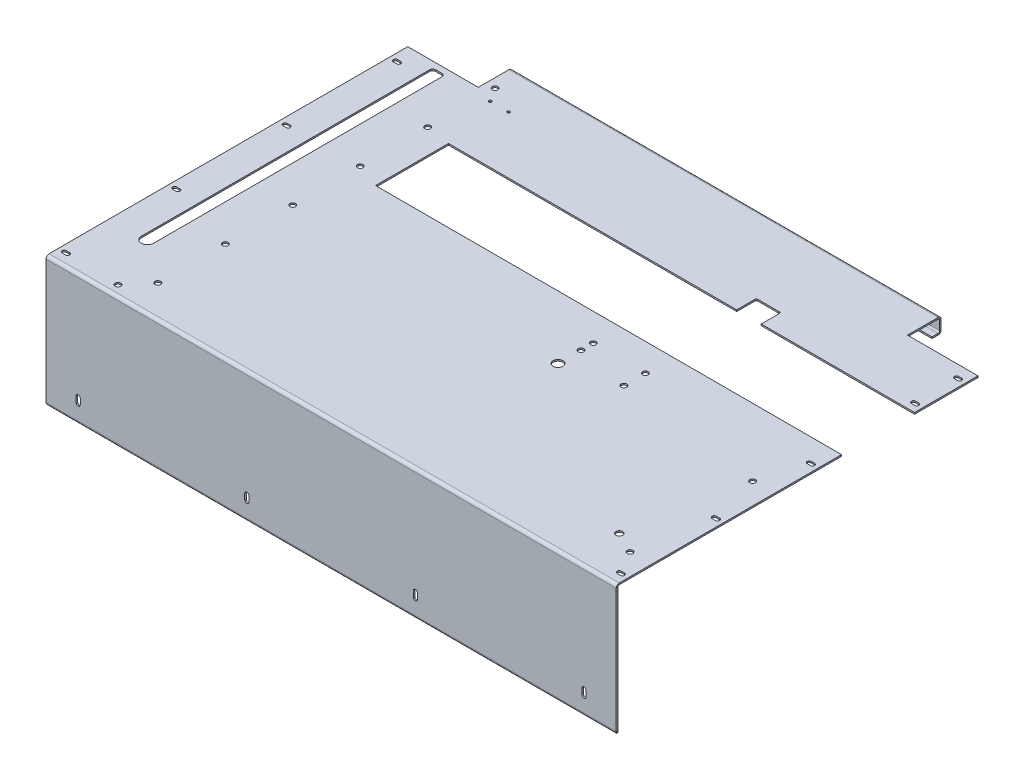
ISO-10303-21;
HEADER;
FILE_DESCRIPTION(('STEP AP214'),'2;1');
FILE_NAME('part.step','',(''),(''),'','','');
FILE_SCHEMA(('AUTOMOTIVE_DESIGN { 1 0 10303 214 1 1 1 1 }'));
ENDSEC;
DATA;
#1=APPLICATION_CONTEXT('core data for automotive mechanical design processes');
#2=APPLICATION_PROTOCOL_DEFINITION('international standard','automotive_design',2000,#1);
#3=PRODUCT_CONTEXT('',#1,'mechanical');
#4=PRODUCT('Part','Part','',(#3));
#5=PRODUCT_RELATED_PRODUCT_CATEGORY('part','',(#4));
#6=PRODUCT_DEFINITION_FORMATION('','',#4);
#7=PRODUCT_DEFINITION_CONTEXT('part definition',#1,'design');
#8=PRODUCT_DEFINITION('design','',#6,#7);
#9=PRODUCT_DEFINITION_SHAPE('','',#8);
#10=(LENGTH_UNIT() NAMED_UNIT(*) SI_UNIT(.MILLI.,.METRE.));
#11=(NAMED_UNIT(*) PLANE_ANGLE_UNIT() SI_UNIT($,.RADIAN.));
#12=(NAMED_UNIT(*) SI_UNIT($,.STERADIAN.) SOLID_ANGLE_UNIT());
#13=UNCERTAINTY_MEASURE_WITH_UNIT(LENGTH_MEASURE(1.E-05),#10,'distance_accuracy_value','');
#14=(GEOMETRIC_REPRESENTATION_CONTEXT(3) GLOBAL_UNCERTAINTY_ASSIGNED_CONTEXT((#13)) GLOBAL_UNIT_ASSIGNED_CONTEXT((#10,
#11,#12)) REPRESENTATION_CONTEXT('',''));
#15=CARTESIAN_POINT('',(0.,0.,0.));
#16=DIRECTION('',(0.,0.,1.));
#17=DIRECTION('',(1.,0.,0.));
#18=AXIS2_PLACEMENT_3D('',#15,#16,#17);
#19=CARTESIAN_POINT('',(930.,0.,-486.5));
#20=DIRECTION('',(0.,0.,-1.));
#21=DIRECTION('',(-1.,0.,0.));
#22=AXIS2_PLACEMENT_3D('',#19,#20,#21);
#23=PLANE('',#22);
#24=DIRECTION('',(-1.,0.,0.));
#25=VECTOR('',#24,1.);
#26=CARTESIAN_POINT('',(930.,210.,-486.5));
#27=LINE('',#26,#25);
#28=CARTESIAN_POINT('',(640.,210.,-486.5));
#29=VERTEX_POINT('',#28);
#30=CARTESIAN_POINT('',(170.,210.,-486.5));
#31=VERTEX_POINT('',#30);
#32=EDGE_CURVE('E626',#29,#31,#27,.T.);
#33=ORIENTED_EDGE('',*,*,#32,.F.);
#34=DIRECTION('',(0.,1.,0.));
#35=VECTOR('',#34,1.);
#36=CARTESIAN_POINT('',(640.,-0.001000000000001,-486.5));
#37=LINE('',#36,#35);
#38=CARTESIAN_POINT('',(640.,212.5,-486.5));
#39=VERTEX_POINT('',#38);
#40=EDGE_CURVE('E611',#29,#39,#37,.T.);
#41=ORIENTED_EDGE('',*,*,#40,.T.);
#42=DIRECTION('',(-1.,0.,0.));
#43=VECTOR('',#42,1.);
#44=CARTESIAN_POINT('',(930.,212.5,-486.5));
#45=LINE('',#44,#43);
#46=CARTESIAN_POINT('',(170.,212.5,-486.5));
#47=VERTEX_POINT('',#46);
#48=EDGE_CURVE('E1789',#39,#47,#45,.T.);
#49=ORIENTED_EDGE('',*,*,#48,.T.);
#50=DIRECTION('',(0.,1.,0.));
#51=VECTOR('',#50,1.);
#52=CARTESIAN_POINT('',(170.,0.,-486.5));
#53=LINE('',#52,#51);
#54=EDGE_CURVE('E633',#31,#47,#53,.T.);
#55=ORIENTED_EDGE('',*,*,#54,.F.);
#56=EDGE_LOOP('',(#33,#41,#49,#55));
#57=FACE_BOUND('',#56,.T.);
#58=ADVANCED_FACE('F40',(#57),#23,.F.);
#59=CARTESIAN_POINT('',(930.,5.,-5.));
#60=DIRECTION('',(-1.,0.,0.));
#61=DIRECTION('',(0.,0.,1.));
#62=AXIS2_PLACEMENT_3D('',#59,#60,#61);
#63=CYLINDRICAL_SURFACE('',#62,5.);
#64=DIRECTION('',(-1.,0.,0.));
#65=VECTOR('',#64,1.);
#66=CARTESIAN_POINT('',(930.,5.,0.));
#67=LINE('',#66,#65);
#68=CARTESIAN_POINT('',(930.,5.,0.));
#69=VERTEX_POINT('',#68);
#70=CARTESIAN_POINT('',(0.,5.,0.));
#71=VERTEX_POINT('',#70);
#72=EDGE_CURVE('E966',#69,#71,#67,.T.);
#73=ORIENTED_EDGE('',*,*,#72,.T.);
#74=CARTESIAN_POINT('',(2.49999999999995,5.,-5.));
#75=DIRECTION('',(0.894427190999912,0.,0.447213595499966));
#76=DIRECTION('',(-0.447213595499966,0.,0.894427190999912));
#77=AXIS2_PLACEMENT_3D('',#74,#75,#76);
#78=ELLIPSE('',#77,5.5901699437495,5.);
#79=CARTESIAN_POINT('',(2.49999999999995,0.,-5.));
#80=VERTEX_POINT('',#79);
#81=EDGE_CURVE('E1754',#71,#80,#78,.T.);
#82=ORIENTED_EDGE('',*,*,#81,.T.);
#83=DIRECTION('',(-1.,0.,0.));
#84=VECTOR('',#83,1.);
#85=CARTESIAN_POINT('',(930.,0.,-5.));
#86=LINE('',#85,#84);
#87=CARTESIAN_POINT('',(927.5,0.,-5.));
#88=VERTEX_POINT('',#87);
#89=EDGE_CURVE('E962',#88,#80,#86,.T.);
#90=ORIENTED_EDGE('',*,*,#89,.F.);
#91=CARTESIAN_POINT('',(927.5,5.,-5.));
#92=DIRECTION('',(-0.89442719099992,0.,0.44721359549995));
#93=DIRECTION('',(-0.44721359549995,0.,-0.89442719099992));
#94=AXIS2_PLACEMENT_3D('',#91,#92,#93);
#95=ELLIPSE('',#94,5.59016994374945,5.);
#96=EDGE_CURVE('E1774',#88,#69,#95,.T.);
#97=ORIENTED_EDGE('',*,*,#96,.T.);
#98=EDGE_LOOP('',(#73,#82,#90,#97));
#99=FACE_BOUND('',#98,.T.);
#100=ADVANCED_FACE('F1861',(#99),#63,.T.);
#101=CARTESIAN_POINT('',(930.,0.,0.));
#102=DIRECTION('',(0.,-1.,0.));
#103=DIRECTION('',(0.,0.,-1.));
#104=AXIS2_PLACEMENT_3D('',#101,#102,#103);
#105=PLANE('',#104);
#106=ORIENTED_EDGE('',*,*,#89,.T.);
#107=DIRECTION('',(-0.707106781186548,0.,0.707106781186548));
#108=VECTOR('',#107,1.);
#109=CARTESIAN_POINT('',(0.,0.,-2.5));
#110=LINE('',#109,#108);
#111=CARTESIAN_POINT('',(17.5,0.,-20.));
#112=VERTEX_POINT('',#111);
#113=EDGE_CURVE('E1758',#112,#80,#110,.T.);
#114=ORIENTED_EDGE('',*,*,#113,.F.);
#115=DIRECTION('',(-1.,0.,0.));
#116=VECTOR('',#115,1.);
#117=CARTESIAN_POINT('',(930.,0.,-20.));
#118=LINE('',#117,#116);
#119=CARTESIAN_POINT('',(912.5,0.,-20.));
#120=VERTEX_POINT('',#119);
#121=EDGE_CURVE('E958',#120,#112,#118,.T.);
#122=ORIENTED_EDGE('',*,*,#121,.F.);
#123=DIRECTION('',(-0.707106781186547,0.,-0.707106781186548));
#124=VECTOR('',#123,1.);
#125=CARTESIAN_POINT('',(912.5,0.,-20.));
#126=LINE('',#125,#124);
#127=EDGE_CURVE('E1778',#88,#120,#126,.T.);
#128=ORIENTED_EDGE('',*,*,#127,.F.);
#129=EDGE_LOOP('',(#106,#114,#122,#128));
#130=FACE_BOUND('',#129,.T.);
#131=ADVANCED_FACE('F1865',(#130),#105,.T.);
#132=CARTESIAN_POINT('',(930.,2.5,-20.));
#133=DIRECTION('',(0.,0.,-1.));
#134=DIRECTION('',(-1.,0.,0.));
#135=AXIS2_PLACEMENT_3D('',#132,#133,#134);
#136=PLANE('',#135);
#137=ORIENTED_EDGE('',*,*,#121,.T.);
#138=DIRECTION('',(0.,-1.,0.));
#139=VECTOR('',#138,1.);
#140=CARTESIAN_POINT('',(17.5,0.,-20.));
#141=LINE('',#140,#139);
#142=CARTESIAN_POINT('',(17.5,2.5,-20.));
#143=VERTEX_POINT('',#142);
#144=EDGE_CURVE('E1764',#112,#143,#141,.F.);
#145=ORIENTED_EDGE('',*,*,#144,.T.);
#146=DIRECTION('',(-1.,0.,0.));
#147=VECTOR('',#146,1.);
#148=CARTESIAN_POINT('',(930.,2.5,-20.));
#149=LINE('',#148,#147);
#150=CARTESIAN_POINT('',(912.5,2.5,-20.));
#151=VERTEX_POINT('',#150);
#152=EDGE_CURVE('E954',#151,#143,#149,.T.);
#153=ORIENTED_EDGE('',*,*,#152,.F.);
#154=DIRECTION('',(0.,-1.,0.));
#155=VECTOR('',#154,1.);
#156=CARTESIAN_POINT('',(912.5,0.,-20.));
#157=LINE('',#156,#155);
#158=EDGE_CURVE('E1786',#120,#151,#157,.F.);
#159=ORIENTED_EDGE('',*,*,#158,.F.);
#160=EDGE_LOOP('',(#137,#145,#153,#159));
#161=FACE_BOUND('',#160,.T.);
#162=ADVANCED_FACE('F1996',(#161),#136,.T.);
#163=CARTESIAN_POINT('',(930.,2.5,0.));
#164=DIRECTION('',(0.,-1.,0.));
#165=DIRECTION('',(0.,0.,-1.));
#166=AXIS2_PLACEMENT_3D('',#163,#164,#165);
#167=PLANE('',#166);
#168=DIRECTION('',(-0.707106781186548,0.,0.707106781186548));
#169=VECTOR('',#168,1.);
#170=CARTESIAN_POINT('',(0.,2.5,-2.5));
#171=LINE('',#170,#169);
#172=CARTESIAN_POINT('',(2.49999999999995,2.5,-5.));
#173=VERTEX_POINT('',#172);
#174=EDGE_CURVE('E1760',#143,#173,#171,.T.);
#175=ORIENTED_EDGE('',*,*,#174,.T.);
#176=DIRECTION('',(-1.,0.,0.));
#177=VECTOR('',#176,1.);
#178=CARTESIAN_POINT('',(930.,2.5,-5.));
#179=LINE('',#178,#177);
#180=CARTESIAN_POINT('',(927.5,2.5,-5.));
#181=VERTEX_POINT('',#180);
#182=EDGE_CURVE('E950',#181,#173,#179,.T.);
#183=ORIENTED_EDGE('',*,*,#182,.F.);
#184=DIRECTION('',(-0.707106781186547,0.,-0.707106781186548));
#185=VECTOR('',#184,1.);
#186=CARTESIAN_POINT('',(912.5,2.5,-20.));
#187=LINE('',#186,#185);
#188=EDGE_CURVE('E1781',#181,#151,#187,.T.);
#189=ORIENTED_EDGE('',*,*,#188,.T.);
#190=ORIENTED_EDGE('',*,*,#152,.T.);
#191=EDGE_LOOP('',(#175,#183,#189,#190));
#192=FACE_BOUND('',#191,.T.);
#193=ADVANCED_FACE('F1992',(#192),#167,.F.);
#194=CARTESIAN_POINT('',(930.,5.,-5.));
#195=DIRECTION('',(-1.,0.,0.));
#196=DIRECTION('',(0.,0.,1.));
#197=AXIS2_PLACEMENT_3D('',#194,#195,#196);
#198=CYLINDRICAL_SURFACE('',#197,2.5);
#199=CARTESIAN_POINT('',(2.49999999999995,5.,-5.));
#200=DIRECTION('',(0.707106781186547,0.,0.707106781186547));
#201=DIRECTION('',(-0.707106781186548,0.,0.707106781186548));
#202=AXIS2_PLACEMENT_3D('',#199,#200,#201);
#203=ELLIPSE('',#202,3.53553390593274,2.5);
#204=CARTESIAN_POINT('',(0.,5.,-2.5));
#205=VERTEX_POINT('',#204);
#206=EDGE_CURVE('E1748',#205,#173,#203,.T.);
#207=ORIENTED_EDGE('',*,*,#206,.F.);
#208=DIRECTION('',(-1.,0.,0.));
#209=VECTOR('',#208,1.);
#210=CARTESIAN_POINT('',(930.,5.,-2.5));
#211=LINE('',#210,#209);
#212=CARTESIAN_POINT('',(930.,5.,-2.5));
#213=VERTEX_POINT('',#212);
#214=EDGE_CURVE('E946',#213,#205,#211,.T.);
#215=ORIENTED_EDGE('',*,*,#214,.F.);
#216=CARTESIAN_POINT('',(927.5,5.,-5.));
#217=DIRECTION('',(-0.707106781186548,0.,0.707106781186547));
#218=DIRECTION('',(-0.707106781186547,0.,-0.707106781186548));
#219=AXIS2_PLACEMENT_3D('',#216,#217,#218);
#220=ELLIPSE('',#219,3.53553390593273,2.5);
#221=EDGE_CURVE('E1768',#181,#213,#220,.T.);
#222=ORIENTED_EDGE('',*,*,#221,.F.);
#223=ORIENTED_EDGE('',*,*,#182,.T.);
#224=EDGE_LOOP('',(#207,#215,#222,#223));
#225=FACE_BOUND('',#224,.T.);
#226=ADVANCED_FACE('F1989',(#225),#198,.F.);
#227=CARTESIAN_POINT('',(930.,207.5,-2.5));
#228=DIRECTION('',(1.,0.,0.));
#229=DIRECTION('',(0.,0.,-1.));
#230=AXIS2_PLACEMENT_3D('',#227,#228,#229);
#231=PLANE('',#230);
#232=DIRECTION('',(0.,-1.,0.));
#233=VECTOR('',#232,1.);
#234=CARTESIAN_POINT('',(930.,207.5,-367.5));
#235=LINE('',#234,#233);
#236=CARTESIAN_POINT('',(930.,212.5,-367.5));
#237=VERTEX_POINT('',#236);
#238=CARTESIAN_POINT('',(930.,210.,-367.5));
#239=VERTEX_POINT('',#238);
#240=EDGE_CURVE('E1064',#237,#239,#235,.T.);
#241=ORIENTED_EDGE('',*,*,#240,.F.);
#242=DIRECTION('',(0.,0.,-1.));
#243=VECTOR('',#242,1.);
#244=CARTESIAN_POINT('',(930.,212.5,0.));
#245=LINE('',#244,#243);
#246=CARTESIAN_POINT('',(930.,212.5,-5.));
#247=VERTEX_POINT('',#246);
#248=EDGE_CURVE('E901',#247,#237,#245,.T.);
#249=ORIENTED_EDGE('',*,*,#248,.F.);
#250=DIRECTION('',(0.,-1.,0.));
#251=VECTOR('',#250,1.);
#252=CARTESIAN_POINT('',(930.,212.5,-5.));
#253=LINE('',#252,#251);
#254=CARTESIAN_POINT('',(930.,210.,-5.));
#255=VERTEX_POINT('',#254);
#256=EDGE_CURVE('E1005',#247,#255,#253,.T.);
#257=ORIENTED_EDGE('',*,*,#256,.T.);
#258=DIRECTION('',(0.,0.,-1.));
#259=VECTOR('',#258,1.);
#260=CARTESIAN_POINT('',(930.,210.,0.));
#261=LINE('',#260,#259);
#262=EDGE_CURVE('E922',#255,#239,#261,.T.);
#263=ORIENTED_EDGE('',*,*,#262,.T.);
#264=EDGE_LOOP('',(#241,#249,#257,#263));
#265=FACE_BOUND('',#264,.T.);
#266=ADVANCED_FACE('F1816',(#265),#231,.T.);
#267=CARTESIAN_POINT('',(930.,190.,-645.));
#268=DIRECTION('',(0.,-1.,0.));
#269=DIRECTION('',(0.,0.,-1.));
#270=AXIS2_PLACEMENT_3D('',#267,#268,#269);
#271=PLANE('',#270);
#272=DIRECTION('',(0.,0.,-1.));
#273=VECTOR('',#272,1.);
#274=CARTESIAN_POINT('',(815.,190.,-645.));
#275=LINE('',#274,#273);
#276=CARTESIAN_POINT('',(815.,190.,-630.));
#277=VERTEX_POINT('',#276);
#278=CARTESIAN_POINT('',(815.,190.,-640.));
#279=VERTEX_POINT('',#278);
#280=EDGE_CURVE('E746',#277,#279,#275,.T.);
#281=ORIENTED_EDGE('',*,*,#280,.T.);
#282=DIRECTION('',(-1.,0.,0.));
#283=VECTOR('',#282,1.);
#284=CARTESIAN_POINT('',(930.,190.,-640.));
#285=LINE('',#284,#283);
#286=CARTESIAN_POINT('',(115.,190.,-640.));
#287=VERTEX_POINT('',#286);
#288=EDGE_CURVE('E926',#279,#287,#285,.T.);
#289=ORIENTED_EDGE('',*,*,#288,.T.);
#290=DIRECTION('',(0.,0.,1.));
#291=VECTOR('',#290,1.);
#292=CARTESIAN_POINT('',(115.,190.,-645.));
#293=LINE('',#292,#291);
#294=CARTESIAN_POINT('',(115.,190.,-630.));
#295=VERTEX_POINT('',#294);
#296=EDGE_CURVE('E817',#287,#295,#293,.T.);
#297=ORIENTED_EDGE('',*,*,#296,.T.);
#298=DIRECTION('',(-1.,0.,0.));
#299=VECTOR('',#298,1.);
#300=CARTESIAN_POINT('',(930.,190.,-630.));
#301=LINE('',#300,#299);
#302=EDGE_CURVE('E993',#277,#295,#301,.T.);
#303=ORIENTED_EDGE('',*,*,#302,.F.);
#304=EDGE_LOOP('',(#281,#289,#297,#303));
#305=FACE_BOUND('',#304,.T.);
#306=ADVANCED_FACE('F2032',(#305),#271,.F.);
#307=CARTESIAN_POINT('',(930.,187.5,-630.));
#308=DIRECTION('',(0.,0.,1.));
#309=DIRECTION('',(1.,0.,0.));
#310=AXIS2_PLACEMENT_3D('',#307,#308,#309);
#311=PLANE('',#310);
#312=DIRECTION('',(-1.,0.,0.));
#313=VECTOR('',#312,1.);
#314=CARTESIAN_POINT('',(930.,187.5,-630.));
#315=LINE('',#314,#313);
#316=CARTESIAN_POINT('',(815.,187.5,-630.));
#317=VERTEX_POINT('',#316);
#318=CARTESIAN_POINT('',(115.,187.5,-630.));
#319=VERTEX_POINT('',#318);
#320=EDGE_CURVE('E990',#317,#319,#315,.T.);
#321=ORIENTED_EDGE('',*,*,#320,.F.);
#322=DIRECTION('',(0.,-1.,0.));
#323=VECTOR('',#322,1.);
#324=CARTESIAN_POINT('',(815.,187.5,-630.));
#325=LINE('',#324,#323);
#326=EDGE_CURVE('E750',#317,#277,#325,.F.);
#327=ORIENTED_EDGE('',*,*,#326,.T.);
#328=ORIENTED_EDGE('',*,*,#302,.T.);
#329=DIRECTION('',(0.,1.,0.));
#330=VECTOR('',#329,1.);
#331=CARTESIAN_POINT('',(115.,190.,-630.));
#332=LINE('',#331,#330);
#333=EDGE_CURVE('E826',#295,#319,#332,.F.);
#334=ORIENTED_EDGE('',*,*,#333,.T.);
#335=EDGE_LOOP('',(#321,#327,#328,#334));
#336=FACE_BOUND('',#335,.T.);
#337=ADVANCED_FACE('F2028',(#336),#311,.T.);
#338=CARTESIAN_POINT('',(930.,187.5,-645.));
#339=DIRECTION('',(0.,-1.,0.));
#340=DIRECTION('',(0.,0.,-1.));
#341=AXIS2_PLACEMENT_3D('',#338,#339,#340);
#342=PLANE('',#341);
#343=DIRECTION('',(-1.,0.,0.));
#344=VECTOR('',#343,1.);
#345=CARTESIAN_POINT('',(930.,187.5,-640.));
#346=LINE('',#345,#344);
#347=CARTESIAN_POINT('',(815.,187.5,-640.));
#348=VERTEX_POINT('',#347);
#349=CARTESIAN_POINT('',(115.,187.5,-640.));
#350=VERTEX_POINT('',#349);
#351=EDGE_CURVE('E987',#348,#350,#346,.T.);
#352=ORIENTED_EDGE('',*,*,#351,.F.);
#353=DIRECTION('',(0.,0.,-1.));
#354=VECTOR('',#353,1.);
#355=CARTESIAN_POINT('',(815.,187.5,-645.));
#356=LINE('',#355,#354);
#357=EDGE_CURVE('E742',#317,#348,#356,.T.);
#358=ORIENTED_EDGE('',*,*,#357,.F.);
#359=ORIENTED_EDGE('',*,*,#320,.T.);
#360=DIRECTION('',(0.,0.,-1.));
#361=VECTOR('',#360,1.);
#362=CARTESIAN_POINT('',(115.,187.5,-645.));
#363=LINE('',#362,#361);
#364=EDGE_CURVE('E821',#350,#319,#363,.F.);
#365=ORIENTED_EDGE('',*,*,#364,.F.);
#366=EDGE_LOOP('',(#352,#358,#359,#365));
#367=FACE_BOUND('',#366,.T.);
#368=ADVANCED_FACE('F2024',(#367),#342,.T.);
#369=CARTESIAN_POINT('',(930.,192.5,-640.));
#370=DIRECTION('',(-1.,0.,0.));
#371=DIRECTION('',(0.,0.,1.));
#372=AXIS2_PLACEMENT_3D('',#369,#370,#371);
#373=CYLINDRICAL_SURFACE('',#372,5.);
#374=DIRECTION('',(-1.,0.,0.));
#375=VECTOR('',#374,1.);
#376=CARTESIAN_POINT('',(930.,192.5,-645.));
#377=LINE('',#376,#375);
#378=CARTESIAN_POINT('',(815.,192.5,-645.));
#379=VERTEX_POINT('',#378);
#380=CARTESIAN_POINT('',(115.,192.5,-645.));
#381=VERTEX_POINT('',#380);
#382=EDGE_CURVE('E984',#379,#381,#377,.T.);
#383=ORIENTED_EDGE('',*,*,#382,.F.);
#384=CARTESIAN_POINT('',(815.,192.5,-640.));
#385=DIRECTION('',(-1.,0.,0.));
#386=DIRECTION('',(0.,0.,1.));
#387=AXIS2_PLACEMENT_3D('',#384,#385,#386);
#388=CIRCLE('',#387,5.);
#389=EDGE_CURVE('E734',#348,#379,#388,.F.);
#390=ORIENTED_EDGE('',*,*,#389,.F.);
#391=ORIENTED_EDGE('',*,*,#351,.T.);
#392=CARTESIAN_POINT('',(115.,192.5,-640.));
#393=DIRECTION('',(-1.,0.,0.));
#394=DIRECTION('',(0.,0.,1.));
#395=AXIS2_PLACEMENT_3D('',#392,#393,#394);
#396=CIRCLE('',#395,5.);
#397=EDGE_CURVE('E813',#381,#350,#396,.T.);
#398=ORIENTED_EDGE('',*,*,#397,.F.);
#399=EDGE_LOOP('',(#383,#390,#391,#398));
#400=FACE_BOUND('',#399,.T.);
#401=ADVANCED_FACE('F2020',(#400),#373,.T.);
#402=CARTESIAN_POINT('',(930.,212.5,-645.));
#403=DIRECTION('',(0.,0.,-1.));
#404=DIRECTION('',(0.,1.,0.));
#405=AXIS2_PLACEMENT_3D('',#402,#403,#404);
#406=PLANE('',#405);
#407=DIRECTION('',(-1.,0.,0.));
#408=VECTOR('',#407,1.);
#409=CARTESIAN_POINT('',(930.,207.5,-645.));
#410=LINE('',#409,#408);
#411=CARTESIAN_POINT('',(815.,207.5,-645.));
#412=VERTEX_POINT('',#411);
#413=CARTESIAN_POINT('',(115.,207.5,-645.));
#414=VERTEX_POINT('',#413);
#415=EDGE_CURVE('E981',#412,#414,#410,.T.);
#416=ORIENTED_EDGE('',*,*,#415,.F.);
#417=DIRECTION('',(0.,1.,0.));
#418=VECTOR('',#417,1.);
#419=CARTESIAN_POINT('',(815.,0.,-645.));
#420=LINE('',#419,#418);
#421=EDGE_CURVE('E755',#379,#412,#420,.T.);
#422=ORIENTED_EDGE('',*,*,#421,.F.);
#423=ORIENTED_EDGE('',*,*,#382,.T.);
#424=DIRECTION('',(0.,1.,0.));
#425=VECTOR('',#424,1.);
#426=CARTESIAN_POINT('',(115.,212.5,-645.));
#427=LINE('',#426,#425);
#428=EDGE_CURVE('E837',#414,#381,#427,.F.);
#429=ORIENTED_EDGE('',*,*,#428,.F.);
#430=EDGE_LOOP('',(#416,#422,#423,#429));
#431=FACE_BOUND('',#430,.T.);
#432=ADVANCED_FACE('F2016',(#431),#406,.T.);
#433=CARTESIAN_POINT('',(930.,207.5,-640.));
#434=DIRECTION('',(-1.,0.,0.));
#435=DIRECTION('',(0.,0.,1.));
#436=AXIS2_PLACEMENT_3D('',#433,#434,#435);
#437=CYLINDRICAL_SURFACE('',#436,5.);
#438=DIRECTION('',(-1.,0.,0.));
#439=VECTOR('',#438,1.);
#440=CARTESIAN_POINT('',(930.,212.5,-639.999999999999));
#441=LINE('',#440,#439);
#442=CARTESIAN_POINT('',(815.,212.5,-640.));
#443=VERTEX_POINT('',#442);
#444=CARTESIAN_POINT('',(115.,212.5,-639.999999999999));
#445=VERTEX_POINT('',#444);
#446=EDGE_CURVE('E978',#443,#445,#441,.T.);
#447=ORIENTED_EDGE('',*,*,#446,.F.);
#448=CARTESIAN_POINT('',(815.,207.5,-640.));
#449=DIRECTION('',(-1.,0.,0.));
#450=DIRECTION('',(0.,0.,1.));
#451=AXIS2_PLACEMENT_3D('',#448,#449,#450);
#452=CIRCLE('',#451,5.);
#453=EDGE_CURVE('E727',#412,#443,#452,.F.);
#454=ORIENTED_EDGE('',*,*,#453,.F.);
#455=ORIENTED_EDGE('',*,*,#415,.T.);
#456=CARTESIAN_POINT('',(115.,207.5,-640.));
#457=DIRECTION('',(1.,0.,0.));
#458=DIRECTION('',(0.,0.,-1.));
#459=AXIS2_PLACEMENT_3D('',#456,#457,#458);
#460=CIRCLE('',#459,5.);
#461=EDGE_CURVE('E798',#445,#414,#460,.F.);
#462=ORIENTED_EDGE('',*,*,#461,.F.);
#463=EDGE_LOOP('',(#447,#454,#455,#462));
#464=FACE_BOUND('',#463,.T.);
#465=ADVANCED_FACE('F2012',(#464),#437,.T.);
#466=CARTESIAN_POINT('',(930.,212.5,0.));
#467=DIRECTION('',(0.,1.,0.));
#468=DIRECTION('',(0.,0.,1.));
#469=AXIS2_PLACEMENT_3D('',#466,#467,#468);
#470=PLANE('',#469);
#471=CARTESIAN_POINT('',(570.,212.5,-265.));
#472=DIRECTION('',(0.,1.,0.));
#473=DIRECTION('',(0.,0.,1.));
#474=AXIS2_PLACEMENT_3D('',#471,#472,#473);
#475=CIRCLE('',#474,7.99999999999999);
#476=CARTESIAN_POINT('',(570.,212.5,-257.));
#477=VERTEX_POINT('',#476);
#478=EDGE_CURVE('E3458',#477,#477,#475,.T.);
#479=ORIENTED_EDGE('',*,*,#478,.F.);
#480=EDGE_LOOP('',(#479));
#481=FACE_BOUND('',#480,.T.);
#482=CARTESIAN_POINT('',(860.,212.5,-75.));
#483=DIRECTION('',(0.,1.,0.));
#484=DIRECTION('',(0.,0.,1.));
#485=AXIS2_PLACEMENT_3D('',#482,#483,#484);
#486=CIRCLE('',#485,5.49999999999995);
#487=CARTESIAN_POINT('',(860.,212.5,-69.5));
#488=VERTEX_POINT('',#487);
#489=EDGE_CURVE('E1373',#488,#488,#486,.T.);
#490=ORIENTED_EDGE('',*,*,#489,.F.);
#491=EDGE_LOOP('',(#490));
#492=FACE_BOUND('',#491,.T.);
#493=CARTESIAN_POINT('',(174.5,212.5,-580.));
#494=DIRECTION('',(0.,1.,0.));
#495=DIRECTION('',(0.,0.,1.));
#496=AXIS2_PLACEMENT_3D('',#493,#494,#495);
#497=CIRCLE('',#496,2.24999999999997);
#498=CARTESIAN_POINT('',(174.5,212.5,-577.75));
#499=VERTEX_POINT('',#498);
#500=EDGE_CURVE('E1358',#499,#499,#497,.T.);
#501=ORIENTED_EDGE('',*,*,#500,.F.);
#502=EDGE_LOOP('',(#501));
#503=FACE_BOUND('',#502,.T.);
#504=CARTESIAN_POINT('',(144.5,212.5,-580.));
#505=DIRECTION('',(0.,1.,0.));
#506=DIRECTION('',(0.,0.,1.));
#507=AXIS2_PLACEMENT_3D('',#504,#505,#506);
#508=CIRCLE('',#507,2.24999999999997);
#509=CARTESIAN_POINT('',(144.5,212.5,-577.75));
#510=VERTEX_POINT('',#509);
#511=EDGE_CURVE('E1354',#510,#510,#508,.T.);
#512=ORIENTED_EDGE('',*,*,#511,.F.);
#513=EDGE_LOOP('',(#512));
#514=FACE_BOUND('',#513,.T.);
#515=CARTESIAN_POINT('',(895.,212.5,-57.5));
#516=DIRECTION('',(0.,1.,0.));
#517=DIRECTION('',(0.,0.,1.));
#518=AXIS2_PLACEMENT_3D('',#515,#516,#517);
#519=CIRCLE('',#518,4.54999999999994);
#520=CARTESIAN_POINT('',(895.,212.5,-52.9500000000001));
#521=VERTEX_POINT('',#520);
#522=EDGE_CURVE('E1350',#521,#521,#519,.T.);
#523=ORIENTED_EDGE('',*,*,#522,.F.);
#524=EDGE_LOOP('',(#523));
#525=FACE_BOUND('',#524,.T.);
#526=CARTESIAN_POINT('',(895.,212.5,-257.5));
#527=DIRECTION('',(0.,1.,0.));
#528=DIRECTION('',(0.,0.,1.));
#529=AXIS2_PLACEMENT_3D('',#526,#527,#528);
#530=CIRCLE('',#529,4.54999999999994);
#531=CARTESIAN_POINT('',(895.,212.5,-252.95));
#532=VERTEX_POINT('',#531);
#533=EDGE_CURVE('E1345',#532,#532,#530,.T.);
#534=ORIENTED_EDGE('',*,*,#533,.F.);
#535=EDGE_LOOP('',(#534));
#536=FACE_BOUND('',#535,.T.);
#537=CARTESIAN_POINT('',(655.,212.5,-322.5));
#538=DIRECTION('',(0.,1.,0.));
#539=DIRECTION('',(0.,0.,1.));
#540=AXIS2_PLACEMENT_3D('',#537,#538,#539);
#541=CIRCLE('',#540,4.54999999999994);
#542=CARTESIAN_POINT('',(655.,212.5,-317.95));
#543=VERTEX_POINT('',#542);
#544=EDGE_CURVE('E1340',#543,#543,#541,.T.);
#545=ORIENTED_EDGE('',*,*,#544,.F.);
#546=EDGE_LOOP('',(#545));
#547=FACE_BOUND('',#546,.T.);
#548=CARTESIAN_POINT('',(655.,212.5,-287.5));
#549=DIRECTION('',(0.,1.,0.));
#550=DIRECTION('',(0.,0.,1.));
#551=AXIS2_PLACEMENT_3D('',#548,#549,#550);
#552=CIRCLE('',#551,4.54999999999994);
#553=CARTESIAN_POINT('',(655.,212.5,-282.95));
#554=VERTEX_POINT('',#553);
#555=EDGE_CURVE('E1335',#554,#554,#552,.T.);
#556=ORIENTED_EDGE('',*,*,#555,.F.);
#557=EDGE_LOOP('',(#556));
#558=FACE_BOUND('',#557,.T.);
#559=CARTESIAN_POINT('',(570.,212.5,-322.5));
#560=DIRECTION('',(0.,1.,0.));
#561=DIRECTION('',(0.,0.,1.));
#562=AXIS2_PLACEMENT_3D('',#559,#560,#561);
#563=CIRCLE('',#562,4.54999999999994);
#564=CARTESIAN_POINT('',(570.,212.5,-317.95));
#565=VERTEX_POINT('',#564);
#566=EDGE_CURVE('E1330',#565,#565,#563,.T.);
#567=ORIENTED_EDGE('',*,*,#566,.F.);
#568=EDGE_LOOP('',(#567));
#569=FACE_BOUND('',#568,.T.);
#570=CARTESIAN_POINT('',(570.,212.5,-302.5));
#571=DIRECTION('',(0.,1.,0.));
#572=DIRECTION('',(0.,0.,1.));
#573=AXIS2_PLACEMENT_3D('',#570,#571,#572);
#574=CIRCLE('',#573,4.54999999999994);
#575=CARTESIAN_POINT('',(570.,212.5,-297.95));
#576=VERTEX_POINT('',#575);
#577=EDGE_CURVE('E1325',#576,#576,#574,.T.);
#578=ORIENTED_EDGE('',*,*,#577,.F.);
#579=EDGE_LOOP('',(#578));
#580=FACE_BOUND('',#579,.T.);
#581=DIRECTION('',(0.,0.,1.));
#582=VECTOR('',#581,1.);
#583=CARTESIAN_POINT('',(640.,212.5,-486.5));
#584=LINE('',#583,#582);
#585=CARTESIAN_POINT('',(640.,212.5,-516.));
#586=VERTEX_POINT('',#585);
#587=EDGE_CURVE('E615',#586,#39,#584,.T.);
#588=ORIENTED_EDGE('',*,*,#587,.F.);
#589=CARTESIAN_POINT('',(642.5,212.5,-516.));
#590=DIRECTION('',(0.,1.,0.));
#591=DIRECTION('',(0.,0.,1.));
#592=AXIS2_PLACEMENT_3D('',#589,#590,#591);
#593=CIRCLE('',#592,2.5);
#594=CARTESIAN_POINT('',(642.5,212.5,-518.5));
#595=VERTEX_POINT('',#594);
#596=EDGE_CURVE('E50',#586,#595,#593,.F.);
#597=ORIENTED_EDGE('',*,*,#596,.T.);
#598=DIRECTION('',(-1.,0.,0.));
#599=VECTOR('',#598,1.);
#600=CARTESIAN_POINT('',(640.,212.5,-518.5));
#601=LINE('',#600,#599);
#602=CARTESIAN_POINT('',(677.5,212.5,-518.5));
#603=VERTEX_POINT('',#602);
#604=EDGE_CURVE('E621',#603,#595,#601,.T.);
#605=ORIENTED_EDGE('',*,*,#604,.F.);
#606=CARTESIAN_POINT('',(677.5,212.5,-516.));
#607=DIRECTION('',(0.,1.,0.));
#608=DIRECTION('',(0.,0.,1.));
#609=AXIS2_PLACEMENT_3D('',#606,#607,#608);
#610=CIRCLE('',#609,2.5);
#611=CARTESIAN_POINT('',(680.,212.5,-516.));
#612=VERTEX_POINT('',#611);
#613=EDGE_CURVE('E1312',#603,#612,#610,.F.);
#614=ORIENTED_EDGE('',*,*,#613,.T.);
#615=DIRECTION('',(0.,0.,-1.));
#616=VECTOR('',#615,1.);
#617=CARTESIAN_POINT('',(680.,212.5,-486.5));
#618=LINE('',#617,#616);
#619=CARTESIAN_POINT('',(680.,212.5,-486.5));
#620=VERTEX_POINT('',#619);
#621=EDGE_CURVE('E1402',#620,#612,#618,.T.);
#622=ORIENTED_EDGE('',*,*,#621,.F.);
#623=CARTESIAN_POINT('',(930.,212.5,-486.5));
#624=VERTEX_POINT('',#623);
#625=EDGE_CURVE('E1792',#624,#620,#45,.T.);
#626=ORIENTED_EDGE('',*,*,#625,.F.);
#627=CARTESIAN_POINT('',(930.,212.5,-590.));
#628=VERTEX_POINT('',#627);
#629=EDGE_CURVE('E900',#624,#628,#245,.T.);
#630=ORIENTED_EDGE('',*,*,#629,.T.);
#631=DIRECTION('',(1.,0.,0.));
#632=VECTOR('',#631,1.);
#633=CARTESIAN_POINT('',(930.,212.5,-590.));
#634=LINE('',#633,#632);
#635=CARTESIAN_POINT('',(815.,212.5,-590.));
#636=VERTEX_POINT('',#635);
#637=EDGE_CURVE('E782',#636,#628,#634,.T.);
#638=ORIENTED_EDGE('',*,*,#637,.F.);
#639=DIRECTION('',(0.,0.,1.));
#640=VECTOR('',#639,1.);
#641=CARTESIAN_POINT('',(815.,212.5,0.));
#642=LINE('',#641,#640);
#643=EDGE_CURVE('E786',#443,#636,#642,.T.);
#644=ORIENTED_EDGE('',*,*,#643,.F.);
#645=ORIENTED_EDGE('',*,*,#446,.T.);
#646=DIRECTION('',(0.,0.,-1.));
#647=VECTOR('',#646,1.);
#648=CARTESIAN_POINT('',(115.,212.5,-645.));
#649=LINE('',#648,#647);
#650=CARTESIAN_POINT('',(115.,212.5,-590.));
#651=VERTEX_POINT('',#650);
#652=EDGE_CURVE('E852',#651,#445,#649,.T.);
#653=ORIENTED_EDGE('',*,*,#652,.F.);
#654=DIRECTION('',(1.,0.,0.));
#655=VECTOR('',#654,1.);
#656=CARTESIAN_POINT('',(0.,212.5,-590.));
#657=LINE('',#656,#655);
#658=CARTESIAN_POINT('',(0.,212.5,-590.));
#659=VERTEX_POINT('',#658);
#660=EDGE_CURVE('E846',#659,#651,#657,.T.);
#661=ORIENTED_EDGE('',*,*,#660,.F.);
#662=DIRECTION('',(0.,0.,-1.));
#663=VECTOR('',#662,1.);
#664=CARTESIAN_POINT('',(0.,212.5,0.));
#665=LINE('',#664,#663);
#666=CARTESIAN_POINT('',(0.,212.5,-5.));
#667=VERTEX_POINT('',#666);
#668=EDGE_CURVE('E873',#667,#659,#665,.T.);
#669=ORIENTED_EDGE('',*,*,#668,.F.);
#670=DIRECTION('',(-1.,0.,0.));
#671=VECTOR('',#670,1.);
#672=CARTESIAN_POINT('',(930.,212.5,-5.));
#673=LINE('',#672,#671);
#674=EDGE_CURVE('E974',#247,#667,#673,.T.);
#675=ORIENTED_EDGE('',*,*,#674,.F.);
#676=ORIENTED_EDGE('',*,*,#248,.T.);
#677=DIRECTION('',(1.,0.,0.));
#678=VECTOR('',#677,1.);
#679=CARTESIAN_POINT('',(930.,212.5,-367.5));
#680=LINE('',#679,#678);
#681=CARTESIAN_POINT('',(170.,212.5,-367.5));
#682=VERTEX_POINT('',#681);
#683=EDGE_CURVE('E1799',#682,#237,#680,.T.);
#684=ORIENTED_EDGE('',*,*,#683,.F.);
#685=DIRECTION('',(0.,0.,1.));
#686=VECTOR('',#685,1.);
#687=CARTESIAN_POINT('',(170.,212.5,-367.5));
#688=LINE('',#687,#686);
#689=EDGE_CURVE('E1795',#47,#682,#688,.T.);
#690=ORIENTED_EDGE('',*,*,#689,.F.);
#691=ORIENTED_EDGE('',*,*,#48,.F.);
#692=EDGE_LOOP('',(#588,#597,#605,#614,#622,#626,#630,#638,#644,#645,#653,#661,#669,#675,#676,
#684,#690,#691));
#693=FACE_BOUND('',#692,.T.);
#694=CARTESIAN_POINT('',(920.1,212.5,-570.));
#695=DIRECTION('',(0.,1.,0.));
#696=DIRECTION('',(0.,0.,-1.));
#697=AXIS2_PLACEMENT_3D('',#694,#695,#696);
#698=CIRCLE('',#697,3.4);
#699=CARTESIAN_POINT('',(920.1,212.5,-566.6));
#700=VERTEX_POINT('',#699);
#701=CARTESIAN_POINT('',(920.1,212.5,-573.4));
#702=VERTEX_POINT('',#701);
#703=EDGE_CURVE('E1535',#700,#702,#698,.T.);
#704=ORIENTED_EDGE('',*,*,#703,.F.);
#705=DIRECTION('',(1.,0.,0.));
#706=VECTOR('',#705,1.);
#707=CARTESIAN_POINT('',(920.1,212.5,-566.6));
#708=LINE('',#707,#706);
#709=CARTESIAN_POINT('',(914.9,212.5,-566.6));
#710=VERTEX_POINT('',#709);
#711=EDGE_CURVE('E1524',#710,#700,#708,.T.);
#712=ORIENTED_EDGE('',*,*,#711,.F.);
#713=CARTESIAN_POINT('',(914.9,212.5,-570.));
#714=DIRECTION('',(0.,1.,0.));
#715=DIRECTION('',(0.,0.,1.));
#716=AXIS2_PLACEMENT_3D('',#713,#714,#715);
#717=CIRCLE('',#716,3.4);
#718=CARTESIAN_POINT('',(914.9,212.5,-573.4));
#719=VERTEX_POINT('',#718);
#720=EDGE_CURVE('E1513',#719,#710,#717,.T.);
#721=ORIENTED_EDGE('',*,*,#720,.F.);
#722=DIRECTION('',(-1.,0.,0.));
#723=VECTOR('',#722,1.);
#724=CARTESIAN_POINT('',(920.1,212.5,-573.4));
#725=LINE('',#724,#723);
#726=EDGE_CURVE('E1499',#702,#719,#725,.T.);
#727=ORIENTED_EDGE('',*,*,#726,.F.);
#728=EDGE_LOOP('',(#704,#712,#721,#727));
#729=FACE_BOUND('',#728,.T.);
#730=CARTESIAN_POINT('',(920.1,212.5,-500.));
#731=DIRECTION('',(0.,1.,0.));
#732=DIRECTION('',(0.,0.,-1.));
#733=AXIS2_PLACEMENT_3D('',#730,#731,#732);
#734=CIRCLE('',#733,3.4);
#735=CARTESIAN_POINT('',(920.1,212.5,-496.6));
#736=VERTEX_POINT('',#735);
#737=CARTESIAN_POINT('',(920.1,212.5,-503.4));
#738=VERTEX_POINT('',#737);
#739=EDGE_CURVE('E1577',#736,#738,#734,.T.);
#740=ORIENTED_EDGE('',*,*,#739,.F.);
#741=DIRECTION('',(1.,0.,0.));
#742=VECTOR('',#741,1.);
#743=CARTESIAN_POINT('',(920.1,212.5,-496.6));
#744=LINE('',#743,#742);
#745=CARTESIAN_POINT('',(914.9,212.5,-496.6));
#746=VERTEX_POINT('',#745);
#747=EDGE_CURVE('E1566',#746,#736,#744,.T.);
#748=ORIENTED_EDGE('',*,*,#747,.F.);
#749=CARTESIAN_POINT('',(914.9,212.5,-500.));
#750=DIRECTION('',(0.,1.,0.));
#751=DIRECTION('',(0.,0.,1.));
#752=AXIS2_PLACEMENT_3D('',#749,#750,#751);
#753=CIRCLE('',#752,3.4);
#754=CARTESIAN_POINT('',(914.9,212.5,-503.4));
#755=VERTEX_POINT('',#754);
#756=EDGE_CURVE('E1555',#755,#746,#753,.T.);
#757=ORIENTED_EDGE('',*,*,#756,.F.);
#758=DIRECTION('',(-1.,0.,0.));
#759=VECTOR('',#758,1.);
#760=CARTESIAN_POINT('',(920.1,212.5,-503.4));
#761=LINE('',#760,#759);
#762=EDGE_CURVE('E1541',#738,#755,#761,.T.);
#763=ORIENTED_EDGE('',*,*,#762,.F.);
#764=EDGE_LOOP('',(#740,#748,#757,#763));
#765=FACE_BOUND('',#764,.T.);
#766=CARTESIAN_POINT('',(920.1,212.5,-175.));
#767=DIRECTION('',(0.,1.,0.));
#768=DIRECTION('',(0.,0.,-1.));
#769=AXIS2_PLACEMENT_3D('',#766,#767,#768);
#770=CIRCLE('',#769,3.4);
#771=CARTESIAN_POINT('',(920.1,212.5,-171.6));
#772=VERTEX_POINT('',#771);
#773=CARTESIAN_POINT('',(920.1,212.5,-178.4));
#774=VERTEX_POINT('',#773);
#775=EDGE_CURVE('E1619',#772,#774,#770,.T.);
#776=ORIENTED_EDGE('',*,*,#775,.F.);
#777=DIRECTION('',(1.,0.,0.));
#778=VECTOR('',#777,1.);
#779=CARTESIAN_POINT('',(920.1,212.5,-171.6));
#780=LINE('',#779,#778);
#781=CARTESIAN_POINT('',(914.9,212.5,-171.6));
#782=VERTEX_POINT('',#781);
#783=EDGE_CURVE('E1608',#782,#772,#780,.T.);
#784=ORIENTED_EDGE('',*,*,#783,.F.);
#785=CARTESIAN_POINT('',(914.9,212.5,-175.));
#786=DIRECTION('',(0.,1.,0.));
#787=DIRECTION('',(0.,0.,1.));
#788=AXIS2_PLACEMENT_3D('',#785,#786,#787);
#789=CIRCLE('',#788,3.4);
#790=CARTESIAN_POINT('',(914.9,212.5,-178.4));
#791=VERTEX_POINT('',#790);
#792=EDGE_CURVE('E1597',#791,#782,#789,.T.);
#793=ORIENTED_EDGE('',*,*,#792,.F.);
#794=DIRECTION('',(-1.,0.,0.));
#795=VECTOR('',#794,1.);
#796=CARTESIAN_POINT('',(920.1,212.5,-178.4));
#797=LINE('',#796,#795);
#798=EDGE_CURVE('E1583',#774,#791,#797,.T.);
#799=ORIENTED_EDGE('',*,*,#798,.F.);
#800=EDGE_LOOP('',(#776,#784,#793,#799));
#801=FACE_BOUND('',#800,.T.);
#802=CARTESIAN_POINT('',(920.1,212.5,-20.));
#803=DIRECTION('',(0.,1.,0.));
#804=DIRECTION('',(0.,0.,-1.));
#805=AXIS2_PLACEMENT_3D('',#802,#803,#804);
#806=CIRCLE('',#805,3.4);
#807=CARTESIAN_POINT('',(920.1,212.5,-16.6));
#808=VERTEX_POINT('',#807);
#809=CARTESIAN_POINT('',(920.1,212.5,-23.4));
#810=VERTEX_POINT('',#809);
#811=EDGE_CURVE('E1633',#808,#810,#806,.T.);
#812=ORIENTED_EDGE('',*,*,#811,.F.);
#813=DIRECTION('',(1.,0.,0.));
#814=VECTOR('',#813,1.);
#815=CARTESIAN_POINT('',(920.1,212.5,-16.6));
#816=LINE('',#815,#814);
#817=CARTESIAN_POINT('',(914.9,212.5,-16.6));
#818=VERTEX_POINT('',#817);
#819=EDGE_CURVE('E1644',#818,#808,#816,.T.);
#820=ORIENTED_EDGE('',*,*,#819,.F.);
#821=CARTESIAN_POINT('',(914.9,212.5,-20.));
#822=DIRECTION('',(0.,1.,0.));
#823=DIRECTION('',(0.,0.,1.));
#824=AXIS2_PLACEMENT_3D('',#821,#822,#823);
#825=CIRCLE('',#824,3.4);
#826=CARTESIAN_POINT('',(914.9,212.5,-23.4));
#827=VERTEX_POINT('',#826);
#828=EDGE_CURVE('E1640',#827,#818,#825,.T.);
#829=ORIENTED_EDGE('',*,*,#828,.F.);
#830=DIRECTION('',(-1.,0.,0.));
#831=VECTOR('',#830,1.);
#832=CARTESIAN_POINT('',(920.1,212.5,-23.4));
#833=LINE('',#832,#831);
#834=EDGE_CURVE('E1636',#810,#827,#833,.T.);
#835=ORIENTED_EDGE('',*,*,#834,.F.);
#836=EDGE_LOOP('',(#812,#820,#829,#835));
#837=FACE_BOUND('',#836,.T.);
#838=CARTESIAN_POINT('',(15.1,212.5,-200.));
#839=DIRECTION('',(0.,1.,0.));
#840=DIRECTION('',(0.,0.,-1.));
#841=AXIS2_PLACEMENT_3D('',#838,#839,#840);
#842=CIRCLE('',#841,3.39999999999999);
#843=CARTESIAN_POINT('',(15.1,212.5,-196.6));
#844=VERTEX_POINT('',#843);
#845=CARTESIAN_POINT('',(15.1,212.5,-203.4));
#846=VERTEX_POINT('',#845);
#847=EDGE_CURVE('E1704',#844,#846,#842,.T.);
#848=ORIENTED_EDGE('',*,*,#847,.F.);
#849=DIRECTION('',(1.,0.,0.));
#850=VECTOR('',#849,1.);
#851=CARTESIAN_POINT('',(15.1,212.5,-196.6));
#852=LINE('',#851,#850);
#853=CARTESIAN_POINT('',(9.89999999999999,212.5,-196.6));
#854=VERTEX_POINT('',#853);
#855=EDGE_CURVE('E1693',#854,#844,#852,.T.);
#856=ORIENTED_EDGE('',*,*,#855,.F.);
#857=CARTESIAN_POINT('',(9.89999999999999,212.5,-200.));
#858=DIRECTION('',(0.,1.,0.));
#859=DIRECTION('',(0.,0.,1.));
#860=AXIS2_PLACEMENT_3D('',#857,#858,#859);
#861=CIRCLE('',#860,3.39999999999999);
#862=CARTESIAN_POINT('',(9.89999999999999,212.5,-203.4));
#863=VERTEX_POINT('',#862);
#864=EDGE_CURVE('E1682',#863,#854,#861,.T.);
#865=ORIENTED_EDGE('',*,*,#864,.F.);
#866=DIRECTION('',(-1.,0.,0.));
#867=VECTOR('',#866,1.);
#868=CARTESIAN_POINT('',(15.1,212.5,-203.4));
#869=LINE('',#868,#867);
#870=EDGE_CURVE('E1668',#846,#863,#869,.T.);
#871=ORIENTED_EDGE('',*,*,#870,.F.);
#872=EDGE_LOOP('',(#848,#856,#865,#871));
#873=FACE_BOUND('',#872,.T.);
#874=CARTESIAN_POINT('',(15.1,212.5,-20.));
#875=DIRECTION('',(0.,1.,0.));
#876=DIRECTION('',(0.,0.,-1.));
#877=AXIS2_PLACEMENT_3D('',#874,#875,#876);
#878=CIRCLE('',#877,3.39999999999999);
#879=CARTESIAN_POINT('',(15.1,212.5,-16.6));
#880=VERTEX_POINT('',#879);
#881=CARTESIAN_POINT('',(15.1,212.5,-23.4));
#882=VERTEX_POINT('',#881);
#883=EDGE_CURVE('E1721',#880,#882,#878,.T.);
#884=ORIENTED_EDGE('',*,*,#883,.F.);
#885=DIRECTION('',(1.,0.,0.));
#886=VECTOR('',#885,1.);
#887=CARTESIAN_POINT('',(15.1,212.5,-16.6));
#888=LINE('',#887,#886);
#889=CARTESIAN_POINT('',(9.89999999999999,212.5,-16.6));
#890=VERTEX_POINT('',#889);
#891=EDGE_CURVE('E1713',#890,#880,#888,.T.);
#892=ORIENTED_EDGE('',*,*,#891,.F.);
#893=CARTESIAN_POINT('',(9.89999999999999,212.5,-20.));
#894=DIRECTION('',(0.,1.,0.));
#895=DIRECTION('',(0.,0.,1.));
#896=AXIS2_PLACEMENT_3D('',#893,#894,#895);
#897=CIRCLE('',#896,3.39999999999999);
#898=CARTESIAN_POINT('',(9.89999999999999,212.5,-23.4));
#899=VERTEX_POINT('',#898);
#900=EDGE_CURVE('E1728',#899,#890,#897,.T.);
#901=ORIENTED_EDGE('',*,*,#900,.F.);
#902=DIRECTION('',(-1.,0.,0.));
#903=VECTOR('',#902,1.);
#904=CARTESIAN_POINT('',(15.1,212.5,-23.4));
#905=LINE('',#904,#903);
#906=EDGE_CURVE('E1732',#882,#899,#905,.T.);
#907=ORIENTED_EDGE('',*,*,#906,.F.);
#908=EDGE_LOOP('',(#884,#892,#901,#907));
#909=FACE_BOUND('',#908,.T.);
#910=CARTESIAN_POINT('',(60.5,212.5,-105.));
#911=DIRECTION('',(0.,1.,0.));
#912=DIRECTION('',(0.,0.,-1.));
#913=AXIS2_PLACEMENT_3D('',#910,#911,#912);
#914=CIRCLE('',#913,10.);
#915=CARTESIAN_POINT('',(50.5,212.5,-105.));
#916=VERTEX_POINT('',#915);
#917=CARTESIAN_POINT('',(70.5,212.5,-105.));
#918=VERTEX_POINT('',#917);
#919=EDGE_CURVE('E650',#916,#918,#914,.T.);
#920=ORIENTED_EDGE('',*,*,#919,.F.);
#921=DIRECTION('',(0.,0.,1.));
#922=VECTOR('',#921,1.);
#923=CARTESIAN_POINT('',(50.5,212.5,-105.));
#924=LINE('',#923,#922);
#925=CARTESIAN_POINT('',(50.4999999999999,212.5,-575.));
#926=VERTEX_POINT('',#925);
#927=EDGE_CURVE('E669',#926,#916,#924,.T.);
#928=ORIENTED_EDGE('',*,*,#927,.F.);
#929=CARTESIAN_POINT('',(55.4999999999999,212.5,-575.));
#930=DIRECTION('',(0.,1.,0.));
#931=DIRECTION('',(0.,0.,-1.));
#932=AXIS2_PLACEMENT_3D('',#929,#930,#931);
#933=CIRCLE('',#932,5.);
#934=CARTESIAN_POINT('',(55.4999999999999,212.5,-580.));
#935=VERTEX_POINT('',#934);
#936=EDGE_CURVE('E665',#935,#926,#933,.T.);
#937=ORIENTED_EDGE('',*,*,#936,.F.);
#938=DIRECTION('',(-1.,0.,0.));
#939=VECTOR('',#938,1.);
#940=CARTESIAN_POINT('',(55.4999999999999,212.5,-580.));
#941=LINE('',#940,#939);
#942=CARTESIAN_POINT('',(65.5,212.5,-580.));
#943=VERTEX_POINT('',#942);
#944=EDGE_CURVE('E661',#943,#935,#941,.T.);
#945=ORIENTED_EDGE('',*,*,#944,.F.);
#946=CARTESIAN_POINT('',(65.5,212.5,-575.));
#947=DIRECTION('',(0.,1.,0.));
#948=DIRECTION('',(0.,0.,-1.));
#949=AXIS2_PLACEMENT_3D('',#946,#947,#948);
#950=CIRCLE('',#949,5.);
#951=CARTESIAN_POINT('',(70.5,212.5,-575.));
#952=VERTEX_POINT('',#951);
#953=EDGE_CURVE('E657',#952,#943,#950,.T.);
#954=ORIENTED_EDGE('',*,*,#953,.F.);
#955=DIRECTION('',(0.,0.,-1.));
#956=VECTOR('',#955,1.);
#957=CARTESIAN_POINT('',(70.5,212.5,-575.));
#958=LINE('',#957,#956);
#959=EDGE_CURVE('E653',#918,#952,#958,.T.);
#960=ORIENTED_EDGE('',*,*,#959,.F.);
#961=EDGE_LOOP('',(#920,#928,#937,#945,#954,#960));
#962=FACE_BOUND('',#961,.T.);
#963=CARTESIAN_POINT('',(130.,212.5,-52.5));
#964=DIRECTION('',(0.,1.,0.));
#965=DIRECTION('',(0.,0.,1.));
#966=AXIS2_PLACEMENT_3D('',#963,#964,#965);
#967=CIRCLE('',#966,4.55);
#968=CARTESIAN_POINT('',(130.,212.5,-47.95));
#969=VERTEX_POINT('',#968);
#970=EDGE_CURVE('E677',#969,#969,#967,.T.);
#971=ORIENTED_EDGE('',*,*,#970,.F.);
#972=EDGE_LOOP('',(#971));
#973=FACE_BOUND('',#972,.T.);
#974=CARTESIAN_POINT('',(130.,212.5,-162.5));
#975=DIRECTION('',(0.,1.,0.));
#976=DIRECTION('',(0.,0.,1.));
#977=AXIS2_PLACEMENT_3D('',#974,#975,#976);
#978=CIRCLE('',#977,4.55);
#979=CARTESIAN_POINT('',(130.,212.5,-157.95));
#980=VERTEX_POINT('',#979);
#981=EDGE_CURVE('E697',#980,#980,#978,.T.);
#982=ORIENTED_EDGE('',*,*,#981,.F.);
#983=EDGE_LOOP('',(#982));
#984=FACE_BOUND('',#983,.T.);
#985=CARTESIAN_POINT('',(130.,212.5,-272.5));
#986=DIRECTION('',(0.,1.,0.));
#987=DIRECTION('',(0.,0.,1.));
#988=AXIS2_PLACEMENT_3D('',#985,#986,#987);
#989=CIRCLE('',#988,4.55);
#990=CARTESIAN_POINT('',(130.,212.5,-267.95));
#991=VERTEX_POINT('',#990);
#992=EDGE_CURVE('E702',#991,#991,#989,.T.);
#993=ORIENTED_EDGE('',*,*,#992,.F.);
#994=EDGE_LOOP('',(#993));
#995=FACE_BOUND('',#994,.T.);
#996=CARTESIAN_POINT('',(130.,212.5,-492.5));
#997=DIRECTION('',(0.,1.,0.));
#998=DIRECTION('',(0.,0.,1.));
#999=AXIS2_PLACEMENT_3D('',#996,#997,#998);
#1000=CIRCLE('',#999,4.55);
#1001=CARTESIAN_POINT('',(130.,212.5,-487.95));
#1002=VERTEX_POINT('',#1001);
#1003=EDGE_CURVE('E707',#1002,#1002,#1000,.T.);
#1004=ORIENTED_EDGE('',*,*,#1003,.F.);
#1005=EDGE_LOOP('',(#1004));
#1006=FACE_BOUND('',#1005,.T.);
#1007=CARTESIAN_POINT('',(130.,212.5,-602.5));
#1008=DIRECTION('',(0.,1.,0.));
#1009=DIRECTION('',(0.,0.,1.));
#1010=AXIS2_PLACEMENT_3D('',#1007,#1008,#1009);
#1011=CIRCLE('',#1010,4.55);
#1012=CARTESIAN_POINT('',(130.,212.5,-597.95));
#1013=VERTEX_POINT('',#1012);
#1014=EDGE_CURVE('E712',#1013,#1013,#1011,.T.);
#1015=ORIENTED_EDGE('',*,*,#1014,.F.);
#1016=EDGE_LOOP('',(#1015));
#1017=FACE_BOUND('',#1016,.T.);
#1018=CARTESIAN_POINT('',(130.,212.5,-382.5));
#1019=DIRECTION('',(0.,1.,0.));
#1020=DIRECTION('',(0.,0.,1.));
#1021=AXIS2_PLACEMENT_3D('',#1018,#1019,#1020);
#1022=CIRCLE('',#1021,4.55);
#1023=CARTESIAN_POINT('',(130.,212.5,-377.95));
#1024=VERTEX_POINT('',#1023);
#1025=EDGE_CURVE('E717',#1024,#1024,#1022,.T.);
#1026=ORIENTED_EDGE('',*,*,#1025,.F.);
#1027=EDGE_LOOP('',(#1026));
#1028=FACE_BOUND('',#1027,.T.);
#1029=CARTESIAN_POINT('',(100.,212.5,-17.5));
#1030=DIRECTION('',(0.,1.,0.));
#1031=DIRECTION('',(0.,0.,1.));
#1032=AXIS2_PLACEMENT_3D('',#1029,#1030,#1031);
#1033=CIRCLE('',#1032,4.55);
#1034=CARTESIAN_POINT('',(100.,212.5,-12.95));
#1035=VERTEX_POINT('',#1034);
#1036=EDGE_CURVE('E722',#1035,#1035,#1033,.T.);
#1037=ORIENTED_EDGE('',*,*,#1036,.F.);
#1038=EDGE_LOOP('',(#1037));
#1039=FACE_BOUND('',#1038,.T.);
#1040=CARTESIAN_POINT('',(15.1,212.5,-380.));
#1041=DIRECTION('',(0.,1.,0.));
#1042=DIRECTION('',(0.,0.,-1.));
#1043=AXIS2_PLACEMENT_3D('',#1040,#1041,#1042);
#1044=CIRCLE('',#1043,3.39999999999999);
#1045=CARTESIAN_POINT('',(15.1,212.5,-376.6));
#1046=VERTEX_POINT('',#1045);
#1047=CARTESIAN_POINT('',(15.1,212.5,-383.4));
#1048=VERTEX_POINT('',#1047);
#1049=EDGE_CURVE('E1085',#1046,#1048,#1044,.T.);
#1050=ORIENTED_EDGE('',*,*,#1049,.F.);
#1051=DIRECTION('',(1.,0.,0.));
#1052=VECTOR('',#1051,1.);
#1053=CARTESIAN_POINT('',(15.1,212.5,-376.6));
#1054=LINE('',#1053,#1052);
#1055=CARTESIAN_POINT('',(9.89999999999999,212.5,-376.6));
#1056=VERTEX_POINT('',#1055);
#1057=EDGE_CURVE('E1088',#1056,#1046,#1054,.T.);
#1058=ORIENTED_EDGE('',*,*,#1057,.F.);
#1059=CARTESIAN_POINT('',(9.89999999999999,212.5,-380.));
#1060=DIRECTION('',(0.,1.,0.));
#1061=DIRECTION('',(0.,0.,1.));
#1062=AXIS2_PLACEMENT_3D('',#1059,#1060,#1061);
#1063=CIRCLE('',#1062,3.39999999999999);
#1064=CARTESIAN_POINT('',(9.89999999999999,212.5,-383.4));
#1065=VERTEX_POINT('',#1064);
#1066=EDGE_CURVE('E1092',#1065,#1056,#1063,.T.);
#1067=ORIENTED_EDGE('',*,*,#1066,.F.);
#1068=DIRECTION('',(-1.,0.,0.));
#1069=VECTOR('',#1068,1.);
#1070=CARTESIAN_POINT('',(15.1,212.5,-383.4));
#1071=LINE('',#1070,#1069);
#1072=EDGE_CURVE('E1096',#1048,#1065,#1071,.T.);
#1073=ORIENTED_EDGE('',*,*,#1072,.F.);
#1074=EDGE_LOOP('',(#1050,#1058,#1067,#1073));
#1075=FACE_BOUND('',#1074,.T.);
#1076=CARTESIAN_POINT('',(15.1,212.5,-560.));
#1077=DIRECTION('',(0.,1.,0.));
#1078=DIRECTION('',(0.,0.,-1.));
#1079=AXIS2_PLACEMENT_3D('',#1076,#1077,#1078);
#1080=CIRCLE('',#1079,3.39999999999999);
#1081=CARTESIAN_POINT('',(15.1,212.5,-556.6));
#1082=VERTEX_POINT('',#1081);
#1083=CARTESIAN_POINT('',(15.1,212.5,-563.4));
#1084=VERTEX_POINT('',#1083);
#1085=EDGE_CURVE('E1131',#1082,#1084,#1080,.T.);
#1086=ORIENTED_EDGE('',*,*,#1085,.F.);
#1087=DIRECTION('',(1.,0.,0.));
#1088=VECTOR('',#1087,1.);
#1089=CARTESIAN_POINT('',(15.1,212.5,-556.6));
#1090=LINE('',#1089,#1088);
#1091=CARTESIAN_POINT('',(9.89999999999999,212.5,-556.6));
#1092=VERTEX_POINT('',#1091);
#1093=EDGE_CURVE('E1134',#1092,#1082,#1090,.T.);
#1094=ORIENTED_EDGE('',*,*,#1093,.F.);
#1095=CARTESIAN_POINT('',(9.89999999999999,212.5,-560.));
#1096=DIRECTION('',(0.,1.,0.));
#1097=DIRECTION('',(0.,0.,1.));
#1098=AXIS2_PLACEMENT_3D('',#1095,#1096,#1097);
#1099=CIRCLE('',#1098,3.39999999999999);
#1100=CARTESIAN_POINT('',(9.89999999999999,212.5,-563.4));
#1101=VERTEX_POINT('',#1100);
#1102=EDGE_CURVE('E1138',#1101,#1092,#1099,.T.);
#1103=ORIENTED_EDGE('',*,*,#1102,.F.);
#1104=DIRECTION('',(-1.,0.,0.));
#1105=VECTOR('',#1104,1.);
#1106=CARTESIAN_POINT('',(15.1,212.5,-563.4));
#1107=LINE('',#1106,#1105);
#1108=EDGE_CURVE('E1142',#1084,#1101,#1107,.T.);
#1109=ORIENTED_EDGE('',*,*,#1108,.F.);
#1110=EDGE_LOOP('',(#1086,#1094,#1103,#1109));
#1111=FACE_BOUND('',#1110,.T.);
#1112=CARTESIAN_POINT('',(920.1,212.5,-330.));
#1113=DIRECTION('',(0.,1.,0.));
#1114=DIRECTION('',(0.,0.,-1.));
#1115=AXIS2_PLACEMENT_3D('',#1112,#1113,#1114);
#1116=CIRCLE('',#1115,3.4);
#1117=CARTESIAN_POINT('',(920.1,212.5,-326.6));
#1118=VERTEX_POINT('',#1117);
#1119=CARTESIAN_POINT('',(920.1,212.5,-333.4));
#1120=VERTEX_POINT('',#1119);
#1121=EDGE_CURVE('E1177',#1118,#1120,#1116,.T.);
#1122=ORIENTED_EDGE('',*,*,#1121,.F.);
#1123=DIRECTION('',(1.,0.,0.));
#1124=VECTOR('',#1123,1.);
#1125=CARTESIAN_POINT('',(920.1,212.5,-326.6));
#1126=LINE('',#1125,#1124);
#1127=CARTESIAN_POINT('',(914.9,212.5,-326.6));
#1128=VERTEX_POINT('',#1127);
#1129=EDGE_CURVE('E1180',#1128,#1118,#1126,.T.);
#1130=ORIENTED_EDGE('',*,*,#1129,.F.);
#1131=CARTESIAN_POINT('',(914.9,212.5,-330.));
#1132=DIRECTION('',(0.,1.,0.));
#1133=DIRECTION('',(0.,0.,1.));
#1134=AXIS2_PLACEMENT_3D('',#1131,#1132,#1133);
#1135=CIRCLE('',#1134,3.4);
#1136=CARTESIAN_POINT('',(914.9,212.5,-333.4));
#1137=VERTEX_POINT('',#1136);
#1138=EDGE_CURVE('E1184',#1137,#1128,#1135,.T.);
#1139=ORIENTED_EDGE('',*,*,#1138,.F.);
#1140=DIRECTION('',(-1.,0.,0.));
#1141=VECTOR('',#1140,1.);
#1142=CARTESIAN_POINT('',(920.1,212.5,-333.4));
#1143=LINE('',#1142,#1141);
#1144=EDGE_CURVE('E1188',#1120,#1137,#1143,.T.);
#1145=ORIENTED_EDGE('',*,*,#1144,.F.);
#1146=EDGE_LOOP('',(#1122,#1130,#1139,#1145));
#1147=FACE_BOUND('',#1146,.T.);
#1148=ADVANCED_FACE('F1810',(#481,#492,#503,#514,#525,#536,#547,#558,#569,#580,#693,#729,#765,
#801,#837,#873,#909,#962,#973,#984,#995,#1006,#1017,#1028,#1039,#1075,#1111,#1147),#470,.T.);
#1149=CARTESIAN_POINT('',(930.,210.,0.));
#1150=DIRECTION('',(0.,1.,0.));
#1151=DIRECTION('',(0.,0.,1.));
#1152=AXIS2_PLACEMENT_3D('',#1149,#1150,#1151);
#1153=PLANE('',#1152);
#1154=CARTESIAN_POINT('',(570.,210.,-265.));
#1155=DIRECTION('',(0.,1.,0.));
#1156=DIRECTION('',(0.,0.,1.));
#1157=AXIS2_PLACEMENT_3D('',#1154,#1155,#1156);
#1158=CIRCLE('',#1157,7.99999999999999);
#1159=CARTESIAN_POINT('',(570.,210.,-257.));
#1160=VERTEX_POINT('',#1159);
#1161=EDGE_CURVE('E3461',#1160,#1160,#1158,.F.);
#1162=ORIENTED_EDGE('',*,*,#1161,.F.);
#1163=EDGE_LOOP('',(#1162));
#1164=FACE_BOUND('',#1163,.T.);
#1165=CARTESIAN_POINT('',(860.,210.,-75.));
#1166=DIRECTION('',(0.,1.,0.));
#1167=DIRECTION('',(0.,0.,1.));
#1168=AXIS2_PLACEMENT_3D('',#1165,#1166,#1167);
#1169=CIRCLE('',#1168,5.49999999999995);
#1170=CARTESIAN_POINT('',(860.,210.,-69.5));
#1171=VERTEX_POINT('',#1170);
#1172=EDGE_CURVE('E44',#1171,#1171,#1169,.T.);
#1173=ORIENTED_EDGE('',*,*,#1172,.T.);
#1174=EDGE_LOOP('',(#1173));
#1175=FACE_BOUND('',#1174,.T.);
#1176=CARTESIAN_POINT('',(174.5,210.,-580.));
#1177=DIRECTION('',(0.,1.,0.));
#1178=DIRECTION('',(0.,0.,1.));
#1179=AXIS2_PLACEMENT_3D('',#1176,#1177,#1178);
#1180=CIRCLE('',#1179,2.24999999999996);
#1181=CARTESIAN_POINT('',(174.5,210.,-577.75));
#1182=VERTEX_POINT('',#1181);
#1183=EDGE_CURVE('E1355',#1182,#1182,#1180,.T.);
#1184=ORIENTED_EDGE('',*,*,#1183,.T.);
#1185=EDGE_LOOP('',(#1184));
#1186=FACE_BOUND('',#1185,.T.);
#1187=CARTESIAN_POINT('',(144.5,210.,-580.));
#1188=DIRECTION('',(0.,1.,0.));
#1189=DIRECTION('',(0.,0.,1.));
#1190=AXIS2_PLACEMENT_3D('',#1187,#1188,#1189);
#1191=CIRCLE('',#1190,2.24999999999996);
#1192=CARTESIAN_POINT('',(144.5,210.,-577.75));
#1193=VERTEX_POINT('',#1192);
#1194=EDGE_CURVE('E1351',#1193,#1193,#1191,.T.);
#1195=ORIENTED_EDGE('',*,*,#1194,.T.);
#1196=EDGE_LOOP('',(#1195));
#1197=FACE_BOUND('',#1196,.T.);
#1198=CARTESIAN_POINT('',(895.,210.,-57.5));
#1199=DIRECTION('',(0.,1.,0.));
#1200=DIRECTION('',(0.,0.,1.));
#1201=AXIS2_PLACEMENT_3D('',#1198,#1199,#1200);
#1202=CIRCLE('',#1201,4.54999999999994);
#1203=CARTESIAN_POINT('',(895.,210.,-52.9500000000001));
#1204=VERTEX_POINT('',#1203);
#1205=EDGE_CURVE('E1346',#1204,#1204,#1202,.T.);
#1206=ORIENTED_EDGE('',*,*,#1205,.T.);
#1207=EDGE_LOOP('',(#1206));
#1208=FACE_BOUND('',#1207,.T.);
#1209=CARTESIAN_POINT('',(895.,210.,-257.5));
#1210=DIRECTION('',(0.,1.,0.));
#1211=DIRECTION('',(0.,0.,1.));
#1212=AXIS2_PLACEMENT_3D('',#1209,#1210,#1211);
#1213=CIRCLE('',#1212,4.54999999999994);
#1214=CARTESIAN_POINT('',(895.,210.,-252.95));
#1215=VERTEX_POINT('',#1214);
#1216=EDGE_CURVE('E1341',#1215,#1215,#1213,.T.);
#1217=ORIENTED_EDGE('',*,*,#1216,.T.);
#1218=EDGE_LOOP('',(#1217));
#1219=FACE_BOUND('',#1218,.T.);
#1220=CARTESIAN_POINT('',(655.,210.,-322.5));
#1221=DIRECTION('',(0.,1.,0.));
#1222=DIRECTION('',(0.,0.,1.));
#1223=AXIS2_PLACEMENT_3D('',#1220,#1221,#1222);
#1224=CIRCLE('',#1223,4.54999999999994);
#1225=CARTESIAN_POINT('',(655.,210.,-317.95));
#1226=VERTEX_POINT('',#1225);
#1227=EDGE_CURVE('E1336',#1226,#1226,#1224,.T.);
#1228=ORIENTED_EDGE('',*,*,#1227,.T.);
#1229=EDGE_LOOP('',(#1228));
#1230=FACE_BOUND('',#1229,.T.);
#1231=CARTESIAN_POINT('',(655.,210.,-287.5));
#1232=DIRECTION('',(0.,1.,0.));
#1233=DIRECTION('',(0.,0.,1.));
#1234=AXIS2_PLACEMENT_3D('',#1231,#1232,#1233);
#1235=CIRCLE('',#1234,4.54999999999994);
#1236=CARTESIAN_POINT('',(655.,210.,-282.95));
#1237=VERTEX_POINT('',#1236);
#1238=EDGE_CURVE('E1331',#1237,#1237,#1235,.T.);
#1239=ORIENTED_EDGE('',*,*,#1238,.T.);
#1240=EDGE_LOOP('',(#1239));
#1241=FACE_BOUND('',#1240,.T.);
#1242=CARTESIAN_POINT('',(570.,210.,-322.5));
#1243=DIRECTION('',(0.,1.,0.));
#1244=DIRECTION('',(0.,0.,1.));
#1245=AXIS2_PLACEMENT_3D('',#1242,#1243,#1244);
#1246=CIRCLE('',#1245,4.54999999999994);
#1247=CARTESIAN_POINT('',(570.,210.,-317.95));
#1248=VERTEX_POINT('',#1247);
#1249=EDGE_CURVE('E1326',#1248,#1248,#1246,.T.);
#1250=ORIENTED_EDGE('',*,*,#1249,.T.);
#1251=EDGE_LOOP('',(#1250));
#1252=FACE_BOUND('',#1251,.T.);
#1253=CARTESIAN_POINT('',(570.,210.,-302.5));
#1254=DIRECTION('',(0.,1.,0.));
#1255=DIRECTION('',(0.,0.,1.));
#1256=AXIS2_PLACEMENT_3D('',#1253,#1254,#1255);
#1257=CIRCLE('',#1256,4.54999999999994);
#1258=CARTESIAN_POINT('',(570.,210.,-297.95));
#1259=VERTEX_POINT('',#1258);
#1260=EDGE_CURVE('E1320',#1259,#1259,#1257,.T.);
#1261=ORIENTED_EDGE('',*,*,#1260,.T.);
#1262=EDGE_LOOP('',(#1261));
#1263=FACE_BOUND('',#1262,.T.);
#1264=DIRECTION('',(-1.,0.,0.));
#1265=VECTOR('',#1264,1.);
#1266=CARTESIAN_POINT('',(920.1,210.,-566.6));
#1267=LINE('',#1266,#1265);
#1268=CARTESIAN_POINT('',(920.1,210.,-566.6));
#1269=VERTEX_POINT('',#1268);
#1270=CARTESIAN_POINT('',(914.9,210.,-566.6));
#1271=VERTEX_POINT('',#1270);
#1272=EDGE_CURVE('E1520',#1269,#1271,#1267,.T.);
#1273=ORIENTED_EDGE('',*,*,#1272,.F.);
#1274=CARTESIAN_POINT('',(920.1,210.,-570.));
#1275=DIRECTION('',(0.,1.,0.));
#1276=DIRECTION('',(0.,0.,1.));
#1277=AXIS2_PLACEMENT_3D('',#1274,#1275,#1276);
#1278=CIRCLE('',#1277,3.4);
#1279=CARTESIAN_POINT('',(920.1,210.,-573.4));
#1280=VERTEX_POINT('',#1279);
#1281=EDGE_CURVE('E1531',#1280,#1269,#1278,.F.);
#1282=ORIENTED_EDGE('',*,*,#1281,.F.);
#1283=DIRECTION('',(1.,0.,0.));
#1284=VECTOR('',#1283,1.);
#1285=CARTESIAN_POINT('',(920.1,210.,-573.4));
#1286=LINE('',#1285,#1284);
#1287=CARTESIAN_POINT('',(914.9,210.,-573.4));
#1288=VERTEX_POINT('',#1287);
#1289=EDGE_CURVE('E1496',#1288,#1280,#1286,.T.);
#1290=ORIENTED_EDGE('',*,*,#1289,.F.);
#1291=CARTESIAN_POINT('',(914.9,210.,-570.));
#1292=DIRECTION('',(0.,1.,0.));
#1293=DIRECTION('',(0.,0.,1.));
#1294=AXIS2_PLACEMENT_3D('',#1291,#1292,#1293);
#1295=CIRCLE('',#1294,3.4);
#1296=EDGE_CURVE('E1510',#1271,#1288,#1295,.F.);
#1297=ORIENTED_EDGE('',*,*,#1296,.F.);
#1298=EDGE_LOOP('',(#1273,#1282,#1290,#1297));
#1299=FACE_BOUND('',#1298,.T.);
#1300=DIRECTION('',(-1.,0.,0.));
#1301=VECTOR('',#1300,1.);
#1302=CARTESIAN_POINT('',(920.1,210.,-496.6));
#1303=LINE('',#1302,#1301);
#1304=CARTESIAN_POINT('',(920.1,210.,-496.6));
#1305=VERTEX_POINT('',#1304);
#1306=CARTESIAN_POINT('',(914.9,210.,-496.6));
#1307=VERTEX_POINT('',#1306);
#1308=EDGE_CURVE('E1562',#1305,#1307,#1303,.T.);
#1309=ORIENTED_EDGE('',*,*,#1308,.F.);
#1310=CARTESIAN_POINT('',(920.1,210.,-500.));
#1311=DIRECTION('',(0.,1.,0.));
#1312=DIRECTION('',(0.,0.,1.));
#1313=AXIS2_PLACEMENT_3D('',#1310,#1311,#1312);
#1314=CIRCLE('',#1313,3.4);
#1315=CARTESIAN_POINT('',(920.1,210.,-503.4));
#1316=VERTEX_POINT('',#1315);
#1317=EDGE_CURVE('E1573',#1316,#1305,#1314,.F.);
#1318=ORIENTED_EDGE('',*,*,#1317,.F.);
#1319=DIRECTION('',(1.,0.,0.));
#1320=VECTOR('',#1319,1.);
#1321=CARTESIAN_POINT('',(920.1,210.,-503.4));
#1322=LINE('',#1321,#1320);
#1323=CARTESIAN_POINT('',(914.9,210.,-503.4));
#1324=VERTEX_POINT('',#1323);
#1325=EDGE_CURVE('E1538',#1324,#1316,#1322,.T.);
#1326=ORIENTED_EDGE('',*,*,#1325,.F.);
#1327=CARTESIAN_POINT('',(914.9,210.,-500.));
#1328=DIRECTION('',(0.,1.,0.));
#1329=DIRECTION('',(0.,0.,1.));
#1330=AXIS2_PLACEMENT_3D('',#1327,#1328,#1329);
#1331=CIRCLE('',#1330,3.4);
#1332=EDGE_CURVE('E1552',#1307,#1324,#1331,.F.);
#1333=ORIENTED_EDGE('',*,*,#1332,.F.);
#1334=EDGE_LOOP('',(#1309,#1318,#1326,#1333));
#1335=FACE_BOUND('',#1334,.T.);
#1336=DIRECTION('',(-1.,0.,0.));
#1337=VECTOR('',#1336,1.);
#1338=CARTESIAN_POINT('',(920.1,210.,-171.6));
#1339=LINE('',#1338,#1337);
#1340=CARTESIAN_POINT('',(920.1,210.,-171.6));
#1341=VERTEX_POINT('',#1340);
#1342=CARTESIAN_POINT('',(914.9,210.,-171.6));
#1343=VERTEX_POINT('',#1342);
#1344=EDGE_CURVE('E1604',#1341,#1343,#1339,.T.);
#1345=ORIENTED_EDGE('',*,*,#1344,.F.);
#1346=CARTESIAN_POINT('',(920.1,210.,-175.));
#1347=DIRECTION('',(0.,1.,0.));
#1348=DIRECTION('',(0.,0.,1.));
#1349=AXIS2_PLACEMENT_3D('',#1346,#1347,#1348);
#1350=CIRCLE('',#1349,3.4);
#1351=CARTESIAN_POINT('',(920.1,210.,-178.4));
#1352=VERTEX_POINT('',#1351);
#1353=EDGE_CURVE('E1615',#1352,#1341,#1350,.F.);
#1354=ORIENTED_EDGE('',*,*,#1353,.F.);
#1355=DIRECTION('',(1.,0.,0.));
#1356=VECTOR('',#1355,1.);
#1357=CARTESIAN_POINT('',(920.1,210.,-178.4));
#1358=LINE('',#1357,#1356);
#1359=CARTESIAN_POINT('',(914.9,210.,-178.4));
#1360=VERTEX_POINT('',#1359);
#1361=EDGE_CURVE('E1580',#1360,#1352,#1358,.T.);
#1362=ORIENTED_EDGE('',*,*,#1361,.F.);
#1363=CARTESIAN_POINT('',(914.9,210.,-175.));
#1364=DIRECTION('',(0.,1.,0.));
#1365=DIRECTION('',(0.,0.,1.));
#1366=AXIS2_PLACEMENT_3D('',#1363,#1364,#1365);
#1367=CIRCLE('',#1366,3.4);
#1368=EDGE_CURVE('E1594',#1343,#1360,#1367,.F.);
#1369=ORIENTED_EDGE('',*,*,#1368,.F.);
#1370=EDGE_LOOP('',(#1345,#1354,#1362,#1369));
#1371=FACE_BOUND('',#1370,.T.);
#1372=DIRECTION('',(-1.,0.,0.));
#1373=VECTOR('',#1372,1.);
#1374=CARTESIAN_POINT('',(920.1,210.,-16.6));
#1375=LINE('',#1374,#1373);
#1376=CARTESIAN_POINT('',(920.1,210.,-16.6));
#1377=VERTEX_POINT('',#1376);
#1378=CARTESIAN_POINT('',(914.9,210.,-16.6));
#1379=VERTEX_POINT('',#1378);
#1380=EDGE_CURVE('E1625',#1377,#1379,#1375,.T.);
#1381=ORIENTED_EDGE('',*,*,#1380,.F.);
#1382=CARTESIAN_POINT('',(920.1,210.,-20.));
#1383=DIRECTION('',(0.,1.,0.));
#1384=DIRECTION('',(0.,0.,1.));
#1385=AXIS2_PLACEMENT_3D('',#1382,#1383,#1384);
#1386=CIRCLE('',#1385,3.4);
#1387=CARTESIAN_POINT('',(920.1,210.,-23.4));
#1388=VERTEX_POINT('',#1387);
#1389=EDGE_CURVE('E1629',#1388,#1377,#1386,.F.);
#1390=ORIENTED_EDGE('',*,*,#1389,.F.);
#1391=DIRECTION('',(1.,0.,0.));
#1392=VECTOR('',#1391,1.);
#1393=CARTESIAN_POINT('',(920.1,210.,-23.4));
#1394=LINE('',#1393,#1392);
#1395=CARTESIAN_POINT('',(914.9,210.,-23.4));
#1396=VERTEX_POINT('',#1395);
#1397=EDGE_CURVE('E1652',#1396,#1388,#1394,.T.);
#1398=ORIENTED_EDGE('',*,*,#1397,.F.);
#1399=CARTESIAN_POINT('',(914.9,210.,-20.));
#1400=DIRECTION('',(0.,1.,0.));
#1401=DIRECTION('',(0.,0.,1.));
#1402=AXIS2_PLACEMENT_3D('',#1399,#1400,#1401);
#1403=CIRCLE('',#1402,3.4);
#1404=EDGE_CURVE('E1622',#1379,#1396,#1403,.F.);
#1405=ORIENTED_EDGE('',*,*,#1404,.F.);
#1406=EDGE_LOOP('',(#1381,#1390,#1398,#1405));
#1407=FACE_BOUND('',#1406,.T.);
#1408=DIRECTION('',(-1.,0.,0.));
#1409=VECTOR('',#1408,1.);
#1410=CARTESIAN_POINT('',(15.1,210.,-196.6));
#1411=LINE('',#1410,#1409);
#1412=CARTESIAN_POINT('',(15.1,210.,-196.6));
#1413=VERTEX_POINT('',#1412);
#1414=CARTESIAN_POINT('',(9.89999999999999,210.,-196.6));
#1415=VERTEX_POINT('',#1414);
#1416=EDGE_CURVE('E1689',#1413,#1415,#1411,.T.);
#1417=ORIENTED_EDGE('',*,*,#1416,.F.);
#1418=CARTESIAN_POINT('',(15.1,210.,-200.));
#1419=DIRECTION('',(0.,1.,0.));
#1420=DIRECTION('',(0.,0.,1.));
#1421=AXIS2_PLACEMENT_3D('',#1418,#1419,#1420);
#1422=CIRCLE('',#1421,3.39999999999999);
#1423=CARTESIAN_POINT('',(15.1,210.,-203.4));
#1424=VERTEX_POINT('',#1423);
#1425=EDGE_CURVE('E1700',#1424,#1413,#1422,.F.);
#1426=ORIENTED_EDGE('',*,*,#1425,.F.);
#1427=DIRECTION('',(1.,0.,0.));
#1428=VECTOR('',#1427,1.);
#1429=CARTESIAN_POINT('',(15.1,210.,-203.4));
#1430=LINE('',#1429,#1428);
#1431=CARTESIAN_POINT('',(9.90000000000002,210.,-203.4));
#1432=VERTEX_POINT('',#1431);
#1433=EDGE_CURVE('E1665',#1432,#1424,#1430,.T.);
#1434=ORIENTED_EDGE('',*,*,#1433,.F.);
#1435=CARTESIAN_POINT('',(9.89999999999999,210.,-200.));
#1436=DIRECTION('',(0.,1.,0.));
#1437=DIRECTION('',(0.,0.,1.));
#1438=AXIS2_PLACEMENT_3D('',#1435,#1436,#1437);
#1439=CIRCLE('',#1438,3.39999999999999);
#1440=EDGE_CURVE('E1679',#1415,#1432,#1439,.F.);
#1441=ORIENTED_EDGE('',*,*,#1440,.F.);
#1442=EDGE_LOOP('',(#1417,#1426,#1434,#1441));
#1443=FACE_BOUND('',#1442,.T.);
#1444=DIRECTION('',(-1.,0.,0.));
#1445=VECTOR('',#1444,1.);
#1446=CARTESIAN_POINT('',(15.1,210.,-16.6));
#1447=LINE('',#1446,#1445);
#1448=CARTESIAN_POINT('',(15.1,210.,-16.6));
#1449=VERTEX_POINT('',#1448);
#1450=CARTESIAN_POINT('',(9.89999999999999,210.,-16.6));
#1451=VERTEX_POINT('',#1450);
#1452=EDGE_CURVE('E1741',#1449,#1451,#1447,.T.);
#1453=ORIENTED_EDGE('',*,*,#1452,.F.);
#1454=CARTESIAN_POINT('',(15.1,210.,-20.));
#1455=DIRECTION('',(0.,1.,0.));
#1456=DIRECTION('',(0.,0.,1.));
#1457=AXIS2_PLACEMENT_3D('',#1454,#1455,#1456);
#1458=CIRCLE('',#1457,3.39999999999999);
#1459=CARTESIAN_POINT('',(15.1,210.,-23.4));
#1460=VERTEX_POINT('',#1459);
#1461=EDGE_CURVE('E1712',#1460,#1449,#1458,.F.);
#1462=ORIENTED_EDGE('',*,*,#1461,.F.);
#1463=DIRECTION('',(1.,0.,0.));
#1464=VECTOR('',#1463,1.);
#1465=CARTESIAN_POINT('',(15.1,210.,-23.4));
#1466=LINE('',#1465,#1464);
#1467=CARTESIAN_POINT('',(9.90000000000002,210.,-23.4));
#1468=VERTEX_POINT('',#1467);
#1469=EDGE_CURVE('E1708',#1468,#1460,#1466,.T.);
#1470=ORIENTED_EDGE('',*,*,#1469,.F.);
#1471=CARTESIAN_POINT('',(9.89999999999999,210.,-20.));
#1472=DIRECTION('',(0.,1.,0.));
#1473=DIRECTION('',(0.,0.,1.));
#1474=AXIS2_PLACEMENT_3D('',#1471,#1472,#1473);
#1475=CIRCLE('',#1474,3.39999999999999);
#1476=EDGE_CURVE('E1745',#1451,#1468,#1475,.F.);
#1477=ORIENTED_EDGE('',*,*,#1476,.F.);
#1478=EDGE_LOOP('',(#1453,#1462,#1470,#1477));
#1479=FACE_BOUND('',#1478,.T.);
#1480=DIRECTION('',(0.,0.,1.));
#1481=VECTOR('',#1480,1.);
#1482=CARTESIAN_POINT('',(50.5,210.,1.03876718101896E-13));
#1483=LINE('',#1482,#1481);
#1484=CARTESIAN_POINT('',(50.4999999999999,210.,-575.));
#1485=VERTEX_POINT('',#1484);
#1486=CARTESIAN_POINT('',(50.5,210.,-105.));
#1487=VERTEX_POINT('',#1486);
#1488=EDGE_CURVE('E1053',#1485,#1487,#1483,.T.);
#1489=ORIENTED_EDGE('',*,*,#1488,.T.);
#1490=CARTESIAN_POINT('',(60.5,210.,-105.));
#1491=DIRECTION('',(0.,1.,0.));
#1492=DIRECTION('',(0.,0.,1.));
#1493=AXIS2_PLACEMENT_3D('',#1490,#1491,#1492);
#1494=CIRCLE('',#1493,10.);
#1495=CARTESIAN_POINT('',(70.5,210.,-105.));
#1496=VERTEX_POINT('',#1495);
#1497=EDGE_CURVE('E1057',#1487,#1496,#1494,.T.);
#1498=ORIENTED_EDGE('',*,*,#1497,.T.);
#1499=DIRECTION('',(0.,0.,-1.));
#1500=VECTOR('',#1499,1.);
#1501=CARTESIAN_POINT('',(70.5,210.,0.));
#1502=LINE('',#1501,#1500);
#1503=CARTESIAN_POINT('',(70.5,210.,-575.));
#1504=VERTEX_POINT('',#1503);
#1505=EDGE_CURVE('E1016',#1496,#1504,#1502,.T.);
#1506=ORIENTED_EDGE('',*,*,#1505,.T.);
#1507=CARTESIAN_POINT('',(65.5,210.,-575.));
#1508=DIRECTION('',(0.,1.,0.));
#1509=DIRECTION('',(0.,0.,1.));
#1510=AXIS2_PLACEMENT_3D('',#1507,#1508,#1509);
#1511=CIRCLE('',#1510,5.);
#1512=CARTESIAN_POINT('',(65.5,210.,-580.));
#1513=VERTEX_POINT('',#1512);
#1514=EDGE_CURVE('E1041',#1504,#1513,#1511,.T.);
#1515=ORIENTED_EDGE('',*,*,#1514,.T.);
#1516=DIRECTION('',(-1.,0.,0.));
#1517=VECTOR('',#1516,1.);
#1518=CARTESIAN_POINT('',(930.,210.,-580.));
#1519=LINE('',#1518,#1517);
#1520=CARTESIAN_POINT('',(55.4999999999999,210.,-580.));
#1521=VERTEX_POINT('',#1520);
#1522=EDGE_CURVE('E1045',#1513,#1521,#1519,.T.);
#1523=ORIENTED_EDGE('',*,*,#1522,.T.);
#1524=CARTESIAN_POINT('',(55.4999999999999,210.,-575.));
#1525=DIRECTION('',(0.,1.,0.));
#1526=DIRECTION('',(0.,0.,1.));
#1527=AXIS2_PLACEMENT_3D('',#1524,#1525,#1526);
#1528=CIRCLE('',#1527,5.);
#1529=EDGE_CURVE('E1049',#1521,#1485,#1528,.T.);
#1530=ORIENTED_EDGE('',*,*,#1529,.T.);
#1531=EDGE_LOOP('',(#1489,#1498,#1506,#1515,#1523,#1530));
#1532=FACE_BOUND('',#1531,.T.);
#1533=CARTESIAN_POINT('',(130.,210.,-52.5));
#1534=DIRECTION('',(0.,1.,0.));
#1535=DIRECTION('',(0.,0.,1.));
#1536=AXIS2_PLACEMENT_3D('',#1533,#1534,#1535);
#1537=CIRCLE('',#1536,4.55);
#1538=CARTESIAN_POINT('',(130.,210.,-47.95));
#1539=VERTEX_POINT('',#1538);
#1540=EDGE_CURVE('E696',#1539,#1539,#1537,.T.);
#1541=ORIENTED_EDGE('',*,*,#1540,.T.);
#1542=EDGE_LOOP('',(#1541));
#1543=FACE_BOUND('',#1542,.T.);
#1544=CARTESIAN_POINT('',(130.,210.,-162.5));
#1545=DIRECTION('',(0.,1.,0.));
#1546=DIRECTION('',(0.,0.,1.));
#1547=AXIS2_PLACEMENT_3D('',#1544,#1545,#1546);
#1548=CIRCLE('',#1547,4.55);
#1549=CARTESIAN_POINT('',(130.,210.,-157.95));
#1550=VERTEX_POINT('',#1549);
#1551=EDGE_CURVE('E701',#1550,#1550,#1548,.T.);
#1552=ORIENTED_EDGE('',*,*,#1551,.T.);
#1553=EDGE_LOOP('',(#1552));
#1554=FACE_BOUND('',#1553,.T.);
#1555=CARTESIAN_POINT('',(130.,210.,-272.5));
#1556=DIRECTION('',(0.,1.,0.));
#1557=DIRECTION('',(0.,0.,1.));
#1558=AXIS2_PLACEMENT_3D('',#1555,#1556,#1557);
#1559=CIRCLE('',#1558,4.55);
#1560=CARTESIAN_POINT('',(130.,210.,-267.95));
#1561=VERTEX_POINT('',#1560);
#1562=EDGE_CURVE('E706',#1561,#1561,#1559,.T.);
#1563=ORIENTED_EDGE('',*,*,#1562,.T.);
#1564=EDGE_LOOP('',(#1563));
#1565=FACE_BOUND('',#1564,.T.);
#1566=CARTESIAN_POINT('',(130.,210.,-492.5));
#1567=DIRECTION('',(0.,1.,0.));
#1568=DIRECTION('',(0.,0.,1.));
#1569=AXIS2_PLACEMENT_3D('',#1566,#1567,#1568);
#1570=CIRCLE('',#1569,4.55);
#1571=CARTESIAN_POINT('',(130.,210.,-487.95));
#1572=VERTEX_POINT('',#1571);
#1573=EDGE_CURVE('E711',#1572,#1572,#1570,.T.);
#1574=ORIENTED_EDGE('',*,*,#1573,.T.);
#1575=EDGE_LOOP('',(#1574));
#1576=FACE_BOUND('',#1575,.T.);
#1577=CARTESIAN_POINT('',(130.,210.,-602.5));
#1578=DIRECTION('',(0.,1.,0.));
#1579=DIRECTION('',(0.,0.,1.));
#1580=AXIS2_PLACEMENT_3D('',#1577,#1578,#1579);
#1581=CIRCLE('',#1580,4.55);
#1582=CARTESIAN_POINT('',(130.,210.,-597.95));
#1583=VERTEX_POINT('',#1582);
#1584=EDGE_CURVE('E716',#1583,#1583,#1581,.T.);
#1585=ORIENTED_EDGE('',*,*,#1584,.T.);
#1586=EDGE_LOOP('',(#1585));
#1587=FACE_BOUND('',#1586,.T.);
#1588=CARTESIAN_POINT('',(130.,210.,-382.5));
#1589=DIRECTION('',(0.,1.,0.));
#1590=DIRECTION('',(0.,0.,1.));
#1591=AXIS2_PLACEMENT_3D('',#1588,#1589,#1590);
#1592=CIRCLE('',#1591,4.55);
#1593=CARTESIAN_POINT('',(130.,210.,-377.95));
#1594=VERTEX_POINT('',#1593);
#1595=EDGE_CURVE('E721',#1594,#1594,#1592,.T.);
#1596=ORIENTED_EDGE('',*,*,#1595,.T.);
#1597=EDGE_LOOP('',(#1596));
#1598=FACE_BOUND('',#1597,.T.);
#1599=CARTESIAN_POINT('',(100.,210.,-17.5));
#1600=DIRECTION('',(0.,1.,0.));
#1601=DIRECTION('',(0.,0.,1.));
#1602=AXIS2_PLACEMENT_3D('',#1599,#1600,#1601);
#1603=CIRCLE('',#1602,4.55);
#1604=CARTESIAN_POINT('',(100.,210.,-12.95));
#1605=VERTEX_POINT('',#1604);
#1606=EDGE_CURVE('E726',#1605,#1605,#1603,.T.);
#1607=ORIENTED_EDGE('',*,*,#1606,.T.);
#1608=EDGE_LOOP('',(#1607));
#1609=FACE_BOUND('',#1608,.T.);
#1610=DIRECTION('',(1.,0.,0.));
#1611=VECTOR('',#1610,1.);
#1612=CARTESIAN_POINT('',(640.,210.,-518.5));
#1613=LINE('',#1612,#1611);
#1614=CARTESIAN_POINT('',(642.5,210.,-518.5));
#1615=VERTEX_POINT('',#1614);
#1616=CARTESIAN_POINT('',(677.5,210.,-518.5));
#1617=VERTEX_POINT('',#1616);
#1618=EDGE_CURVE('E629',#1615,#1617,#1613,.T.);
#1619=ORIENTED_EDGE('',*,*,#1618,.F.);
#1620=CARTESIAN_POINT('',(642.5,210.,-516.));
#1621=DIRECTION('',(0.,1.,0.));
#1622=DIRECTION('',(0.,0.,1.));
#1623=AXIS2_PLACEMENT_3D('',#1620,#1621,#1622);
#1624=CIRCLE('',#1623,2.5);
#1625=CARTESIAN_POINT('',(640.,210.,-516.));
#1626=VERTEX_POINT('',#1625);
#1627=EDGE_CURVE('E11',#1615,#1626,#1624,.T.);
#1628=ORIENTED_EDGE('',*,*,#1627,.T.);
#1629=DIRECTION('',(0.,0.,-1.));
#1630=VECTOR('',#1629,1.);
#1631=CARTESIAN_POINT('',(640.,210.,-486.5));
#1632=LINE('',#1631,#1630);
#1633=EDGE_CURVE('E613',#29,#1626,#1632,.T.);
#1634=ORIENTED_EDGE('',*,*,#1633,.F.);
#1635=ORIENTED_EDGE('',*,*,#32,.T.);
#1636=DIRECTION('',(0.,0.,1.));
#1637=VECTOR('',#1636,1.);
#1638=CARTESIAN_POINT('',(170.,210.,1.77262499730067E-13));
#1639=LINE('',#1638,#1637);
#1640=CARTESIAN_POINT('',(170.,210.,-367.5));
#1641=VERTEX_POINT('',#1640);
#1642=EDGE_CURVE('E1067',#31,#1641,#1639,.T.);
#1643=ORIENTED_EDGE('',*,*,#1642,.T.);
#1644=DIRECTION('',(1.,0.,0.));
#1645=VECTOR('',#1644,1.);
#1646=CARTESIAN_POINT('',(930.,210.,-367.5));
#1647=LINE('',#1646,#1645);
#1648=EDGE_CURVE('E642',#1641,#239,#1647,.T.);
#1649=ORIENTED_EDGE('',*,*,#1648,.T.);
#1650=ORIENTED_EDGE('',*,*,#262,.F.);
#1651=DIRECTION('',(-1.,0.,0.));
#1652=VECTOR('',#1651,1.);
#1653=CARTESIAN_POINT('',(930.,210.,-5.));
#1654=LINE('',#1653,#1652);
#1655=CARTESIAN_POINT('',(0.,210.,-5.));
#1656=VERTEX_POINT('',#1655);
#1657=EDGE_CURVE('E938',#255,#1656,#1654,.T.);
#1658=ORIENTED_EDGE('',*,*,#1657,.T.);
#1659=DIRECTION('',(0.,0.,-1.));
#1660=VECTOR('',#1659,1.);
#1661=CARTESIAN_POINT('',(0.,210.,0.));
#1662=LINE('',#1661,#1660);
#1663=CARTESIAN_POINT('',(0.,210.,-590.));
#1664=VERTEX_POINT('',#1663);
#1665=EDGE_CURVE('E896',#1656,#1664,#1662,.T.);
#1666=ORIENTED_EDGE('',*,*,#1665,.T.);
#1667=DIRECTION('',(1.,0.,0.));
#1668=VECTOR('',#1667,1.);
#1669=CARTESIAN_POINT('',(930.,210.,-590.));
#1670=LINE('',#1669,#1668);
#1671=CARTESIAN_POINT('',(115.,210.,-590.));
#1672=VERTEX_POINT('',#1671);
#1673=EDGE_CURVE('E856',#1664,#1672,#1670,.T.);
#1674=ORIENTED_EDGE('',*,*,#1673,.T.);
#1675=DIRECTION('',(0.,0.,1.));
#1676=VECTOR('',#1675,1.);
#1677=CARTESIAN_POINT('',(115.,210.,0.));
#1678=LINE('',#1677,#1676);
#1679=CARTESIAN_POINT('',(115.,210.,-640.));
#1680=VERTEX_POINT('',#1679);
#1681=EDGE_CURVE('E857',#1672,#1680,#1678,.F.);
#1682=ORIENTED_EDGE('',*,*,#1681,.T.);
#1683=DIRECTION('',(-1.,0.,0.));
#1684=VECTOR('',#1683,1.);
#1685=CARTESIAN_POINT('',(930.,210.,-640.));
#1686=LINE('',#1685,#1684);
#1687=CARTESIAN_POINT('',(815.,210.,-640.));
#1688=VERTEX_POINT('',#1687);
#1689=EDGE_CURVE('E935',#1688,#1680,#1686,.T.);
#1690=ORIENTED_EDGE('',*,*,#1689,.F.);
#1691=DIRECTION('',(0.,0.,1.));
#1692=VECTOR('',#1691,1.);
#1693=CARTESIAN_POINT('',(815.,210.,0.));
#1694=LINE('',#1693,#1692);
#1695=CARTESIAN_POINT('',(815.,210.,-590.));
#1696=VERTEX_POINT('',#1695);
#1697=EDGE_CURVE('E778',#1688,#1696,#1694,.T.);
#1698=ORIENTED_EDGE('',*,*,#1697,.T.);
#1699=DIRECTION('',(1.,0.,0.));
#1700=VECTOR('',#1699,1.);
#1701=CARTESIAN_POINT('',(930.,210.,-590.));
#1702=LINE('',#1701,#1700);
#1703=CARTESIAN_POINT('',(930.,210.,-590.));
#1704=VERTEX_POINT('',#1703);
#1705=EDGE_CURVE('E771',#1696,#1704,#1702,.T.);
#1706=ORIENTED_EDGE('',*,*,#1705,.T.);
#1707=CARTESIAN_POINT('',(930.,210.,-486.5));
#1708=VERTEX_POINT('',#1707);
#1709=EDGE_CURVE('E921',#1708,#1704,#261,.T.);
#1710=ORIENTED_EDGE('',*,*,#1709,.F.);
#1711=CARTESIAN_POINT('',(680.,210.,-486.5));
#1712=VERTEX_POINT('',#1711);
#1713=EDGE_CURVE('E635',#1708,#1712,#27,.T.);
#1714=ORIENTED_EDGE('',*,*,#1713,.T.);
#1715=DIRECTION('',(0.,0.,1.));
#1716=VECTOR('',#1715,1.);
#1717=CARTESIAN_POINT('',(680.,210.,-486.5));
#1718=LINE('',#1717,#1716);
#1719=CARTESIAN_POINT('',(680.,210.,-516.));
#1720=VERTEX_POINT('',#1719);
#1721=EDGE_CURVE('E1324',#1720,#1712,#1718,.T.);
#1722=ORIENTED_EDGE('',*,*,#1721,.F.);
#1723=CARTESIAN_POINT('',(677.5,210.,-516.));
#1724=DIRECTION('',(0.,1.,0.));
#1725=DIRECTION('',(0.,0.,1.));
#1726=AXIS2_PLACEMENT_3D('',#1723,#1724,#1725);
#1727=CIRCLE('',#1726,2.5);
#1728=EDGE_CURVE('E1315',#1720,#1617,#1727,.T.);
#1729=ORIENTED_EDGE('',*,*,#1728,.T.);
#1730=EDGE_LOOP('',(#1619,#1628,#1634,#1635,#1643,#1649,#1650,#1658,#1666,#1674,#1682,#1690,
#1698,#1706,#1710,#1714,#1722,#1729));
#1731=FACE_BOUND('',#1730,.T.);
#1732=CARTESIAN_POINT('',(15.1,210.,-380.));
#1733=DIRECTION('',(0.,1.,0.));
#1734=DIRECTION('',(0.,0.,1.));
#1735=AXIS2_PLACEMENT_3D('',#1732,#1733,#1734);
#1736=CIRCLE('',#1735,3.39999999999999);
#1737=CARTESIAN_POINT('',(15.1,210.,-383.4));
#1738=VERTEX_POINT('',#1737);
#1739=CARTESIAN_POINT('',(15.1,210.,-376.6));
#1740=VERTEX_POINT('',#1739);
#1741=EDGE_CURVE('E1070',#1738,#1740,#1736,.F.);
#1742=ORIENTED_EDGE('',*,*,#1741,.F.);
#1743=DIRECTION('',(1.,0.,0.));
#1744=VECTOR('',#1743,1.);
#1745=CARTESIAN_POINT('',(15.1,210.,-383.4));
#1746=LINE('',#1745,#1744);
#1747=CARTESIAN_POINT('',(9.90000000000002,210.,-383.4));
#1748=VERTEX_POINT('',#1747);
#1749=EDGE_CURVE('E1073',#1748,#1738,#1746,.T.);
#1750=ORIENTED_EDGE('',*,*,#1749,.F.);
#1751=CARTESIAN_POINT('',(9.89999999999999,210.,-380.));
#1752=DIRECTION('',(0.,1.,0.));
#1753=DIRECTION('',(0.,0.,1.));
#1754=AXIS2_PLACEMENT_3D('',#1751,#1752,#1753);
#1755=CIRCLE('',#1754,3.39999999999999);
#1756=CARTESIAN_POINT('',(9.89999999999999,210.,-376.6));
#1757=VERTEX_POINT('',#1756);
#1758=EDGE_CURVE('E1077',#1757,#1748,#1755,.F.);
#1759=ORIENTED_EDGE('',*,*,#1758,.F.);
#1760=DIRECTION('',(-1.,0.,0.));
#1761=VECTOR('',#1760,1.);
#1762=CARTESIAN_POINT('',(15.1,210.,-376.6));
#1763=LINE('',#1762,#1761);
#1764=EDGE_CURVE('E1081',#1740,#1757,#1763,.T.);
#1765=ORIENTED_EDGE('',*,*,#1764,.F.);
#1766=EDGE_LOOP('',(#1742,#1750,#1759,#1765));
#1767=FACE_BOUND('',#1766,.T.);
#1768=CARTESIAN_POINT('',(15.1,210.,-560.));
#1769=DIRECTION('',(0.,1.,0.));
#1770=DIRECTION('',(0.,0.,1.));
#1771=AXIS2_PLACEMENT_3D('',#1768,#1769,#1770);
#1772=CIRCLE('',#1771,3.39999999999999);
#1773=CARTESIAN_POINT('',(15.1,210.,-563.4));
#1774=VERTEX_POINT('',#1773);
#1775=CARTESIAN_POINT('',(15.1,210.,-556.6));
#1776=VERTEX_POINT('',#1775);
#1777=EDGE_CURVE('E1116',#1774,#1776,#1772,.F.);
#1778=ORIENTED_EDGE('',*,*,#1777,.F.);
#1779=DIRECTION('',(1.,0.,0.));
#1780=VECTOR('',#1779,1.);
#1781=CARTESIAN_POINT('',(15.1,210.,-563.4));
#1782=LINE('',#1781,#1780);
#1783=CARTESIAN_POINT('',(9.90000000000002,210.,-563.4));
#1784=VERTEX_POINT('',#1783);
#1785=EDGE_CURVE('E1119',#1784,#1774,#1782,.T.);
#1786=ORIENTED_EDGE('',*,*,#1785,.F.);
#1787=CARTESIAN_POINT('',(9.89999999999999,210.,-560.));
#1788=DIRECTION('',(0.,1.,0.));
#1789=DIRECTION('',(0.,0.,1.));
#1790=AXIS2_PLACEMENT_3D('',#1787,#1788,#1789);
#1791=CIRCLE('',#1790,3.39999999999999);
#1792=CARTESIAN_POINT('',(9.89999999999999,210.,-556.6));
#1793=VERTEX_POINT('',#1792);
#1794=EDGE_CURVE('E1123',#1793,#1784,#1791,.F.);
#1795=ORIENTED_EDGE('',*,*,#1794,.F.);
#1796=DIRECTION('',(-1.,0.,0.));
#1797=VECTOR('',#1796,1.);
#1798=CARTESIAN_POINT('',(15.1,210.,-556.6));
#1799=LINE('',#1798,#1797);
#1800=EDGE_CURVE('E1127',#1776,#1793,#1799,.T.);
#1801=ORIENTED_EDGE('',*,*,#1800,.F.);
#1802=EDGE_LOOP('',(#1778,#1786,#1795,#1801));
#1803=FACE_BOUND('',#1802,.T.);
#1804=CARTESIAN_POINT('',(920.1,210.,-330.));
#1805=DIRECTION('',(0.,1.,0.));
#1806=DIRECTION('',(0.,0.,1.));
#1807=AXIS2_PLACEMENT_3D('',#1804,#1805,#1806);
#1808=CIRCLE('',#1807,3.4);
#1809=CARTESIAN_POINT('',(920.1,210.,-333.4));
#1810=VERTEX_POINT('',#1809);
#1811=CARTESIAN_POINT('',(920.1,210.,-326.6));
#1812=VERTEX_POINT('',#1811);
#1813=EDGE_CURVE('E1162',#1810,#1812,#1808,.F.);
#1814=ORIENTED_EDGE('',*,*,#1813,.F.);
#1815=DIRECTION('',(1.,0.,0.));
#1816=VECTOR('',#1815,1.);
#1817=CARTESIAN_POINT('',(920.1,210.,-333.4));
#1818=LINE('',#1817,#1816);
#1819=CARTESIAN_POINT('',(914.9,210.,-333.4));
#1820=VERTEX_POINT('',#1819);
#1821=EDGE_CURVE('E1165',#1820,#1810,#1818,.T.);
#1822=ORIENTED_EDGE('',*,*,#1821,.F.);
#1823=CARTESIAN_POINT('',(914.9,210.,-330.));
#1824=DIRECTION('',(0.,1.,0.));
#1825=DIRECTION('',(0.,0.,1.));
#1826=AXIS2_PLACEMENT_3D('',#1823,#1824,#1825);
#1827=CIRCLE('',#1826,3.4);
#1828=CARTESIAN_POINT('',(914.9,210.,-326.6));
#1829=VERTEX_POINT('',#1828);
#1830=EDGE_CURVE('E1169',#1829,#1820,#1827,.F.);
#1831=ORIENTED_EDGE('',*,*,#1830,.F.);
#1832=DIRECTION('',(-1.,0.,0.));
#1833=VECTOR('',#1832,1.);
#1834=CARTESIAN_POINT('',(920.1,210.,-326.6));
#1835=LINE('',#1834,#1833);
#1836=EDGE_CURVE('E1173',#1812,#1829,#1835,.T.);
#1837=ORIENTED_EDGE('',*,*,#1836,.F.);
#1838=EDGE_LOOP('',(#1814,#1822,#1831,#1837));
#1839=FACE_BOUND('',#1838,.T.);
#1840=ADVANCED_FACE('F623',(#1164,#1175,#1186,#1197,#1208,#1219,#1230,#1241,#1252,#1263,#1299,
#1335,#1371,#1407,#1443,#1479,#1532,#1543,#1554,#1565,#1576,#1587,#1598,#1609,#1731,#1767,#1803,
#1839),#1153,.F.);
#1841=CARTESIAN_POINT('',(930.,207.5,-640.));
#1842=DIRECTION('',(-1.,0.,0.));
#1843=DIRECTION('',(0.,0.,1.));
#1844=AXIS2_PLACEMENT_3D('',#1841,#1842,#1843);
#1845=CYLINDRICAL_SURFACE('',#1844,2.5);
#1846=CARTESIAN_POINT('',(815.,207.5,-640.));
#1847=DIRECTION('',(-1.,0.,0.));
#1848=DIRECTION('',(0.,0.,1.));
#1849=AXIS2_PLACEMENT_3D('',#1846,#1847,#1848);
#1850=CIRCLE('',#1849,2.5);
#1851=CARTESIAN_POINT('',(815.,207.5,-642.5));
#1852=VERTEX_POINT('',#1851);
#1853=EDGE_CURVE('E730',#1852,#1688,#1850,.F.);
#1854=ORIENTED_EDGE('',*,*,#1853,.T.);
#1855=ORIENTED_EDGE('',*,*,#1689,.T.);
#1856=CARTESIAN_POINT('',(115.,207.5,-640.));
#1857=DIRECTION('',(-1.,0.,0.));
#1858=DIRECTION('',(0.,0.,1.));
#1859=AXIS2_PLACEMENT_3D('',#1856,#1857,#1858);
#1860=CIRCLE('',#1859,2.5);
#1861=CARTESIAN_POINT('',(115.,207.5,-642.5));
#1862=VERTEX_POINT('',#1861);
#1863=EDGE_CURVE('E805',#1680,#1862,#1860,.T.);
#1864=ORIENTED_EDGE('',*,*,#1863,.T.);
#1865=DIRECTION('',(-1.,0.,0.));
#1866=VECTOR('',#1865,1.);
#1867=CARTESIAN_POINT('',(930.,207.5,-642.5));
#1868=LINE('',#1867,#1866);
#1869=EDGE_CURVE('E932',#1852,#1862,#1868,.T.);
#1870=ORIENTED_EDGE('',*,*,#1869,.F.);
#1871=EDGE_LOOP('',(#1854,#1855,#1864,#1870));
#1872=FACE_BOUND('',#1871,.T.);
#1873=ADVANCED_FACE('F1976',(#1872),#1845,.F.);
#1874=CARTESIAN_POINT('',(930.,212.5,-642.5));
#1875=DIRECTION('',(0.,0.,-1.));
#1876=DIRECTION('',(0.,1.,0.));
#1877=AXIS2_PLACEMENT_3D('',#1874,#1875,#1876);
#1878=PLANE('',#1877);
#1879=DIRECTION('',(0.,1.,0.));
#1880=VECTOR('',#1879,1.);
#1881=CARTESIAN_POINT('',(815.,212.5,-642.5));
#1882=LINE('',#1881,#1880);
#1883=CARTESIAN_POINT('',(815.,192.5,-642.5));
#1884=VERTEX_POINT('',#1883);
#1885=EDGE_CURVE('E762',#1884,#1852,#1882,.T.);
#1886=ORIENTED_EDGE('',*,*,#1885,.T.);
#1887=ORIENTED_EDGE('',*,*,#1869,.T.);
#1888=DIRECTION('',(0.,-1.,0.));
#1889=VECTOR('',#1888,1.);
#1890=CARTESIAN_POINT('',(115.,212.5,-642.5));
#1891=LINE('',#1890,#1889);
#1892=CARTESIAN_POINT('',(115.,192.5,-642.5));
#1893=VERTEX_POINT('',#1892);
#1894=EDGE_CURVE('E830',#1862,#1893,#1891,.T.);
#1895=ORIENTED_EDGE('',*,*,#1894,.T.);
#1896=DIRECTION('',(-1.,0.,0.));
#1897=VECTOR('',#1896,1.);
#1898=CARTESIAN_POINT('',(930.,192.5,-642.5));
#1899=LINE('',#1898,#1897);
#1900=EDGE_CURVE('E929',#1884,#1893,#1899,.T.);
#1901=ORIENTED_EDGE('',*,*,#1900,.F.);
#1902=EDGE_LOOP('',(#1886,#1887,#1895,#1901));
#1903=FACE_BOUND('',#1902,.T.);
#1904=ADVANCED_FACE('F1972',(#1903),#1878,.F.);
#1905=CARTESIAN_POINT('',(930.,192.5,-640.));
#1906=DIRECTION('',(-1.,0.,0.));
#1907=DIRECTION('',(0.,0.,1.));
#1908=AXIS2_PLACEMENT_3D('',#1905,#1906,#1907);
#1909=CYLINDRICAL_SURFACE('',#1908,2.5);
#1910=CARTESIAN_POINT('',(815.,192.5,-640.));
#1911=DIRECTION('',(-1.,0.,0.));
#1912=DIRECTION('',(0.,0.,1.));
#1913=AXIS2_PLACEMENT_3D('',#1910,#1911,#1912);
#1914=CIRCLE('',#1913,2.5);
#1915=EDGE_CURVE('E738',#279,#1884,#1914,.F.);
#1916=ORIENTED_EDGE('',*,*,#1915,.T.);
#1917=ORIENTED_EDGE('',*,*,#1900,.T.);
#1918=CARTESIAN_POINT('',(115.,192.5,-640.));
#1919=DIRECTION('',(1.,0.,0.));
#1920=DIRECTION('',(0.,0.,-1.));
#1921=AXIS2_PLACEMENT_3D('',#1918,#1919,#1920);
#1922=CIRCLE('',#1921,2.5);
#1923=EDGE_CURVE('E809',#1893,#287,#1922,.F.);
#1924=ORIENTED_EDGE('',*,*,#1923,.T.);
#1925=ORIENTED_EDGE('',*,*,#288,.F.);
#1926=EDGE_LOOP('',(#1916,#1917,#1924,#1925));
#1927=FACE_BOUND('',#1926,.T.);
#1928=ADVANCED_FACE('F1968',(#1927),#1909,.F.);
#1929=DIRECTION('',(0.,1.,0.));
#1930=VECTOR('',#1929,1.);
#1931=CARTESIAN_POINT('',(930.,207.5,-486.5));
#1932=LINE('',#1931,#1930);
#1933=EDGE_CURVE('E1061',#1708,#624,#1932,.T.);
#1934=ORIENTED_EDGE('',*,*,#1933,.F.);
#1935=ORIENTED_EDGE('',*,*,#1709,.T.);
#1936=DIRECTION('',(0.,-1.,0.));
#1937=VECTOR('',#1936,1.);
#1938=CARTESIAN_POINT('',(930.,210.,-590.));
#1939=LINE('',#1938,#1937);
#1940=EDGE_CURVE('E790',#1704,#628,#1939,.F.);
#1941=ORIENTED_EDGE('',*,*,#1940,.T.);
#1942=ORIENTED_EDGE('',*,*,#629,.F.);
#1943=EDGE_LOOP('',(#1934,#1935,#1941,#1942));
#1944=FACE_BOUND('',#1943,.T.);
#1945=ADVANCED_FACE('F1971',(#1944),#231,.T.);
#1946=CARTESIAN_POINT('',(0.,207.5,-642.5));
#1947=DIRECTION('',(-1.,0.,0.));
#1948=DIRECTION('',(0.,0.,1.));
#1949=AXIS2_PLACEMENT_3D('',#1946,#1947,#1948);
#1950=PLANE('',#1949);
#1951=ORIENTED_EDGE('',*,*,#668,.T.);
#1952=DIRECTION('',(0.,1.,0.));
#1953=VECTOR('',#1952,1.);
#1954=CARTESIAN_POINT('',(0.,212.5,-590.));
#1955=LINE('',#1954,#1953);
#1956=EDGE_CURVE('E861',#659,#1664,#1955,.F.);
#1957=ORIENTED_EDGE('',*,*,#1956,.T.);
#1958=ORIENTED_EDGE('',*,*,#1665,.F.);
#1959=DIRECTION('',(0.,1.,0.));
#1960=VECTOR('',#1959,1.);
#1961=CARTESIAN_POINT('',(0.,210.,-5.));
#1962=LINE('',#1961,#1960);
#1963=EDGE_CURVE('E996',#1656,#667,#1962,.T.);
#1964=ORIENTED_EDGE('',*,*,#1963,.T.);
#1965=EDGE_LOOP('',(#1951,#1957,#1958,#1964));
#1966=FACE_BOUND('',#1965,.T.);
#1967=ADVANCED_FACE('F2037',(#1966),#1950,.T.);
#1968=CARTESIAN_POINT('',(930.,2.5,-5.));
#1969=DIRECTION('',(1.,0.,0.));
#1970=DIRECTION('',(0.,0.,-1.));
#1971=AXIS2_PLACEMENT_3D('',#1968,#1969,#1970);
#1972=PLANE('',#1971);
#1973=DIRECTION('',(0.,1.,0.));
#1974=VECTOR('',#1973,1.);
#1975=CARTESIAN_POINT('',(930.,0.,0.));
#1976=LINE('',#1975,#1974);
#1977=CARTESIAN_POINT('',(930.,207.5,0.));
#1978=VERTEX_POINT('',#1977);
#1979=EDGE_CURVE('E909',#69,#1978,#1976,.T.);
#1980=ORIENTED_EDGE('',*,*,#1979,.F.);
#1981=DIRECTION('',(0.,0.,-1.));
#1982=VECTOR('',#1981,1.);
#1983=CARTESIAN_POINT('',(930.,5.,0.));
#1984=LINE('',#1983,#1982);
#1985=EDGE_CURVE('E1012',#69,#213,#1984,.T.);
#1986=ORIENTED_EDGE('',*,*,#1985,.T.);
#1987=DIRECTION('',(0.,1.,0.));
#1988=VECTOR('',#1987,1.);
#1989=CARTESIAN_POINT('',(930.,0.,-2.5));
#1990=LINE('',#1989,#1988);
#1991=CARTESIAN_POINT('',(930.,207.5,-2.5));
#1992=VERTEX_POINT('',#1991);
#1993=EDGE_CURVE('E913',#213,#1992,#1990,.T.);
#1994=ORIENTED_EDGE('',*,*,#1993,.T.);
#1995=DIRECTION('',(0.,0.,1.));
#1996=VECTOR('',#1995,1.);
#1997=CARTESIAN_POINT('',(930.,207.5,-2.5));
#1998=LINE('',#1997,#1996);
#1999=EDGE_CURVE('E1002',#1992,#1978,#1998,.T.);
#2000=ORIENTED_EDGE('',*,*,#1999,.T.);
#2001=EDGE_LOOP('',(#1980,#1986,#1994,#2000));
#2002=FACE_BOUND('',#2001,.T.);
#2003=ADVANCED_FACE('F1831',(#2002),#1972,.T.);
#2004=CARTESIAN_POINT('',(930.,212.5,-5.));
#2005=DIRECTION('',(1.,0.,0.));
#2006=DIRECTION('',(0.,0.,-1.));
#2007=AXIS2_PLACEMENT_3D('',#2004,#2005,#2006);
#2008=PLANE('',#2007);
#2009=ORIENTED_EDGE('',*,*,#256,.F.);
#2010=CARTESIAN_POINT('',(930.,207.5,-5.));
#2011=DIRECTION('',(1.,0.,0.));
#2012=DIRECTION('',(0.,0.,-1.));
#2013=AXIS2_PLACEMENT_3D('',#2010,#2011,#2012);
#2014=CIRCLE('',#2013,5.);
#2015=EDGE_CURVE('E905',#1978,#247,#2014,.F.);
#2016=ORIENTED_EDGE('',*,*,#2015,.F.);
#2017=ORIENTED_EDGE('',*,*,#1999,.F.);
#2018=CARTESIAN_POINT('',(930.,207.5,-5.));
#2019=DIRECTION('',(1.,0.,0.));
#2020=DIRECTION('',(0.,0.,-1.));
#2021=AXIS2_PLACEMENT_3D('',#2018,#2019,#2020);
#2022=CIRCLE('',#2021,2.5);
#2023=EDGE_CURVE('E917',#1992,#255,#2022,.F.);
#2024=ORIENTED_EDGE('',*,*,#2023,.T.);
#2025=EDGE_LOOP('',(#2009,#2016,#2017,#2024));
#2026=FACE_BOUND('',#2025,.T.);
#2027=ADVANCED_FACE('F1823',(#2026),#2008,.T.);
#2028=CARTESIAN_POINT('',(0.,207.5,0.));
#2029=DIRECTION('',(-1.,0.,0.));
#2030=DIRECTION('',(0.,0.,1.));
#2031=AXIS2_PLACEMENT_3D('',#2028,#2029,#2030);
#2032=PLANE('',#2031);
#2033=DIRECTION('',(0.,0.,-1.));
#2034=VECTOR('',#2033,1.);
#2035=CARTESIAN_POINT('',(0.,207.5,0.));
#2036=LINE('',#2035,#2034);
#2037=CARTESIAN_POINT('',(0.,207.5,0.));
#2038=VERTEX_POINT('',#2037);
#2039=CARTESIAN_POINT('',(0.,207.5,-2.5));
#2040=VERTEX_POINT('',#2039);
#2041=EDGE_CURVE('E999',#2038,#2040,#2036,.T.);
#2042=ORIENTED_EDGE('',*,*,#2041,.F.);
#2043=CARTESIAN_POINT('',(0.,207.5,-5.));
#2044=DIRECTION('',(1.,0.,0.));
#2045=DIRECTION('',(0.,0.,-1.));
#2046=AXIS2_PLACEMENT_3D('',#2043,#2044,#2045);
#2047=CIRCLE('',#2046,5.);
#2048=EDGE_CURVE('E880',#2038,#667,#2047,.F.);
#2049=ORIENTED_EDGE('',*,*,#2048,.T.);
#2050=ORIENTED_EDGE('',*,*,#1963,.F.);
#2051=CARTESIAN_POINT('',(0.,207.5,-5.));
#2052=DIRECTION('',(1.,0.,0.));
#2053=DIRECTION('',(0.,0.,-1.));
#2054=AXIS2_PLACEMENT_3D('',#2051,#2052,#2053);
#2055=CIRCLE('',#2054,2.5);
#2056=EDGE_CURVE('E892',#2040,#1656,#2055,.F.);
#2057=ORIENTED_EDGE('',*,*,#2056,.F.);
#2058=EDGE_LOOP('',(#2042,#2049,#2050,#2057));
#2059=FACE_BOUND('',#2058,.T.);
#2060=ADVANCED_FACE('F2043',(#2059),#2032,.T.);
#2061=CARTESIAN_POINT('',(0.,210.,-5.));
#2062=DIRECTION('',(-1.,0.,0.));
#2063=DIRECTION('',(0.,0.,1.));
#2064=AXIS2_PLACEMENT_3D('',#2061,#2062,#2063);
#2065=PLANE('',#2064);
#2066=DIRECTION('',(0.,1.,0.));
#2067=VECTOR('',#2066,1.);
#2068=CARTESIAN_POINT('',(0.,0.,0.));
#2069=LINE('',#2068,#2067);
#2070=EDGE_CURVE('E884',#71,#2038,#2069,.T.);
#2071=ORIENTED_EDGE('',*,*,#2070,.T.);
#2072=ORIENTED_EDGE('',*,*,#2041,.T.);
#2073=DIRECTION('',(0.,1.,0.));
#2074=VECTOR('',#2073,1.);
#2075=CARTESIAN_POINT('',(0.,0.,-2.5));
#2076=LINE('',#2075,#2074);
#2077=EDGE_CURVE('E888',#205,#2040,#2076,.T.);
#2078=ORIENTED_EDGE('',*,*,#2077,.F.);
#2079=DIRECTION('',(0.,0.,1.));
#2080=VECTOR('',#2079,1.);
#2081=CARTESIAN_POINT('',(0.,5.,-2.5));
#2082=LINE('',#2081,#2080);
#2083=EDGE_CURVE('E1008',#205,#71,#2082,.T.);
#2084=ORIENTED_EDGE('',*,*,#2083,.T.);
#2085=EDGE_LOOP('',(#2071,#2072,#2078,#2084));
#2086=FACE_BOUND('',#2085,.T.);
#2087=ADVANCED_FACE('F2009',(#2086),#2065,.T.);
#2088=CARTESIAN_POINT('',(930.,207.5,-5.));
#2089=DIRECTION('',(-1.,0.,0.));
#2090=DIRECTION('',(0.,0.,1.));
#2091=AXIS2_PLACEMENT_3D('',#2088,#2089,#2090);
#2092=CYLINDRICAL_SURFACE('',#2091,5.);
#2093=ORIENTED_EDGE('',*,*,#2048,.F.);
#2094=DIRECTION('',(-1.,0.,0.));
#2095=VECTOR('',#2094,1.);
#2096=CARTESIAN_POINT('',(930.,207.5,0.));
#2097=LINE('',#2096,#2095);
#2098=EDGE_CURVE('E970',#1978,#2038,#2097,.T.);
#2099=ORIENTED_EDGE('',*,*,#2098,.F.);
#2100=ORIENTED_EDGE('',*,*,#2015,.T.);
#2101=ORIENTED_EDGE('',*,*,#674,.T.);
#2102=EDGE_LOOP('',(#2093,#2099,#2100,#2101));
#2103=FACE_BOUND('',#2102,.T.);
#2104=ADVANCED_FACE('F1821',(#2103),#2092,.T.);
#2105=CARTESIAN_POINT('',(930.,0.,0.));
#2106=DIRECTION('',(0.,0.,1.));
#2107=DIRECTION('',(1.,0.,0.));
#2108=AXIS2_PLACEMENT_3D('',#2105,#2106,#2107);
#2109=PLANE('',#2108);
#2110=CARTESIAN_POINT('',(327.5,38.6,0.));
#2111=DIRECTION('',(0.,0.,1.));
#2112=DIRECTION('',(-1.,0.,0.));
#2113=AXIS2_PLACEMENT_3D('',#2110,#2111,#2112);
#2114=CIRCLE('',#2113,3.4);
#2115=CARTESIAN_POINT('',(330.9,38.6,0.));
#2116=VERTEX_POINT('',#2115);
#2117=CARTESIAN_POINT('',(324.1,38.6,0.));
#2118=VERTEX_POINT('',#2117);
#2119=EDGE_CURVE('E1450',#2116,#2118,#2114,.T.);
#2120=ORIENTED_EDGE('',*,*,#2119,.F.);
#2121=DIRECTION('',(0.,1.,0.));
#2122=VECTOR('',#2121,1.);
#2123=CARTESIAN_POINT('',(330.9,38.6,0.));
#2124=LINE('',#2123,#2122);
#2125=CARTESIAN_POINT('',(330.9,29.4,0.));
#2126=VERTEX_POINT('',#2125);
#2127=EDGE_CURVE('E1439',#2126,#2116,#2124,.T.);
#2128=ORIENTED_EDGE('',*,*,#2127,.F.);
#2129=CARTESIAN_POINT('',(327.5,29.4,0.));
#2130=DIRECTION('',(0.,0.,1.));
#2131=DIRECTION('',(1.,0.,0.));
#2132=AXIS2_PLACEMENT_3D('',#2129,#2130,#2131);
#2133=CIRCLE('',#2132,3.4);
#2134=CARTESIAN_POINT('',(324.1,29.4,0.));
#2135=VERTEX_POINT('',#2134);
#2136=EDGE_CURVE('E1428',#2135,#2126,#2133,.T.);
#2137=ORIENTED_EDGE('',*,*,#2136,.F.);
#2138=DIRECTION('',(0.,-1.,0.));
#2139=VECTOR('',#2138,1.);
#2140=CARTESIAN_POINT('',(324.1,38.6,0.));
#2141=LINE('',#2140,#2139);
#2142=EDGE_CURVE('E1414',#2118,#2135,#2141,.T.);
#2143=ORIENTED_EDGE('',*,*,#2142,.F.);
#2144=EDGE_LOOP('',(#2120,#2128,#2137,#2143));
#2145=FACE_BOUND('',#2144,.T.);
#2146=CARTESIAN_POINT('',(52.5,38.6,0.));
#2147=DIRECTION('',(0.,0.,1.));
#2148=DIRECTION('',(-1.,0.,0.));
#2149=AXIS2_PLACEMENT_3D('',#2146,#2147,#2148);
#2150=CIRCLE('',#2149,3.4);
#2151=CARTESIAN_POINT('',(55.9,38.6,0.));
#2152=VERTEX_POINT('',#2151);
#2153=CARTESIAN_POINT('',(49.1,38.6,0.));
#2154=VERTEX_POINT('',#2153);
#2155=EDGE_CURVE('E1464',#2152,#2154,#2150,.T.);
#2156=ORIENTED_EDGE('',*,*,#2155,.F.);
#2157=DIRECTION('',(0.,1.,0.));
#2158=VECTOR('',#2157,1.);
#2159=CARTESIAN_POINT('',(55.9,38.6,0.));
#2160=LINE('',#2159,#2158);
#2161=CARTESIAN_POINT('',(55.9,29.4,0.));
#2162=VERTEX_POINT('',#2161);
#2163=EDGE_CURVE('E1475',#2162,#2152,#2160,.T.);
#2164=ORIENTED_EDGE('',*,*,#2163,.F.);
#2165=CARTESIAN_POINT('',(52.5,29.4,0.));
#2166=DIRECTION('',(0.,0.,1.));
#2167=DIRECTION('',(1.,0.,0.));
#2168=AXIS2_PLACEMENT_3D('',#2165,#2166,#2167);
#2169=CIRCLE('',#2168,3.4);
#2170=CARTESIAN_POINT('',(49.1,29.4,0.));
#2171=VERTEX_POINT('',#2170);
#2172=EDGE_CURVE('E1471',#2171,#2162,#2169,.T.);
#2173=ORIENTED_EDGE('',*,*,#2172,.F.);
#2174=DIRECTION('',(0.,-1.,0.));
#2175=VECTOR('',#2174,1.);
#2176=CARTESIAN_POINT('',(49.1,38.6,0.));
#2177=LINE('',#2176,#2175);
#2178=EDGE_CURVE('E1467',#2154,#2171,#2177,.T.);
#2179=ORIENTED_EDGE('',*,*,#2178,.F.);
#2180=EDGE_LOOP('',(#2156,#2164,#2173,#2179));
#2181=FACE_BOUND('',#2180,.T.);
#2182=ORIENTED_EDGE('',*,*,#2070,.F.);
#2183=ORIENTED_EDGE('',*,*,#72,.F.);
#2184=ORIENTED_EDGE('',*,*,#1979,.T.);
#2185=ORIENTED_EDGE('',*,*,#2098,.T.);
#2186=EDGE_LOOP('',(#2182,#2183,#2184,#2185));
#2187=FACE_BOUND('',#2186,.T.);
#2188=CARTESIAN_POINT('',(602.5,38.6,0.));
#2189=DIRECTION('',(0.,0.,1.));
#2190=DIRECTION('',(-1.,0.,0.));
#2191=AXIS2_PLACEMENT_3D('',#2188,#2189,#2190);
#2192=CIRCLE('',#2191,3.4);
#2193=CARTESIAN_POINT('',(605.9,38.6,0.));
#2194=VERTEX_POINT('',#2193);
#2195=CARTESIAN_POINT('',(599.1,38.6,0.));
#2196=VERTEX_POINT('',#2195);
#2197=EDGE_CURVE('E1223',#2194,#2196,#2192,.T.);
#2198=ORIENTED_EDGE('',*,*,#2197,.F.);
#2199=DIRECTION('',(0.,1.,0.));
#2200=VECTOR('',#2199,1.);
#2201=CARTESIAN_POINT('',(605.9,38.6,0.));
#2202=LINE('',#2201,#2200);
#2203=CARTESIAN_POINT('',(605.9,29.4,0.));
#2204=VERTEX_POINT('',#2203);
#2205=EDGE_CURVE('E1226',#2204,#2194,#2202,.T.);
#2206=ORIENTED_EDGE('',*,*,#2205,.F.);
#2207=CARTESIAN_POINT('',(602.5,29.4,0.));
#2208=DIRECTION('',(0.,0.,1.));
#2209=DIRECTION('',(1.,0.,0.));
#2210=AXIS2_PLACEMENT_3D('',#2207,#2208,#2209);
#2211=CIRCLE('',#2210,3.4);
#2212=CARTESIAN_POINT('',(599.1,29.4,0.));
#2213=VERTEX_POINT('',#2212);
#2214=EDGE_CURVE('E1230',#2213,#2204,#2211,.T.);
#2215=ORIENTED_EDGE('',*,*,#2214,.F.);
#2216=DIRECTION('',(0.,-1.,0.));
#2217=VECTOR('',#2216,1.);
#2218=CARTESIAN_POINT('',(599.1,38.6,0.));
#2219=LINE('',#2218,#2217);
#2220=EDGE_CURVE('E1234',#2196,#2213,#2219,.T.);
#2221=ORIENTED_EDGE('',*,*,#2220,.F.);
#2222=EDGE_LOOP('',(#2198,#2206,#2215,#2221));
#2223=FACE_BOUND('',#2222,.T.);
#2224=CARTESIAN_POINT('',(877.5,38.6,0.));
#2225=DIRECTION('',(0.,0.,1.));
#2226=DIRECTION('',(-1.,0.,0.));
#2227=AXIS2_PLACEMENT_3D('',#2224,#2225,#2226);
#2228=CIRCLE('',#2227,3.4);
#2229=CARTESIAN_POINT('',(880.9,38.6,0.));
#2230=VERTEX_POINT('',#2229);
#2231=CARTESIAN_POINT('',(874.1,38.6,0.));
#2232=VERTEX_POINT('',#2231);
#2233=EDGE_CURVE('E1269',#2230,#2232,#2228,.T.);
#2234=ORIENTED_EDGE('',*,*,#2233,.F.);
#2235=DIRECTION('',(0.,1.,0.));
#2236=VECTOR('',#2235,1.);
#2237=CARTESIAN_POINT('',(880.9,38.6,0.));
#2238=LINE('',#2237,#2236);
#2239=CARTESIAN_POINT('',(880.9,29.4,0.));
#2240=VERTEX_POINT('',#2239);
#2241=EDGE_CURVE('E1272',#2240,#2230,#2238,.T.);
#2242=ORIENTED_EDGE('',*,*,#2241,.F.);
#2243=CARTESIAN_POINT('',(877.5,29.4,0.));
#2244=DIRECTION('',(0.,0.,1.));
#2245=DIRECTION('',(1.,0.,0.));
#2246=AXIS2_PLACEMENT_3D('',#2243,#2244,#2245);
#2247=CIRCLE('',#2246,3.4);
#2248=CARTESIAN_POINT('',(874.1,29.4,0.));
#2249=VERTEX_POINT('',#2248);
#2250=EDGE_CURVE('E1276',#2249,#2240,#2247,.T.);
#2251=ORIENTED_EDGE('',*,*,#2250,.F.);
#2252=DIRECTION('',(0.,-1.,0.));
#2253=VECTOR('',#2252,1.);
#2254=CARTESIAN_POINT('',(874.1,38.6,0.));
#2255=LINE('',#2254,#2253);
#2256=EDGE_CURVE('E1280',#2232,#2249,#2255,.T.);
#2257=ORIENTED_EDGE('',*,*,#2256,.F.);
#2258=EDGE_LOOP('',(#2234,#2242,#2251,#2257));
#2259=FACE_BOUND('',#2258,.T.);
#2260=ADVANCED_FACE('F1828',(#2145,#2181,#2187,#2223,#2259),#2109,.T.);
#2261=CARTESIAN_POINT('',(930.,0.,-2.5));
#2262=DIRECTION('',(0.,0.,1.));
#2263=DIRECTION('',(1.,0.,0.));
#2264=AXIS2_PLACEMENT_3D('',#2261,#2262,#2263);
#2265=PLANE('',#2264);
#2266=DIRECTION('',(0.,-1.,0.));
#2267=VECTOR('',#2266,1.);
#2268=CARTESIAN_POINT('',(330.9,38.6,-2.49999999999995));
#2269=LINE('',#2268,#2267);
#2270=CARTESIAN_POINT('',(330.9,38.6,-2.49999999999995));
#2271=VERTEX_POINT('',#2270);
#2272=CARTESIAN_POINT('',(330.9,29.4,-2.49999999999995));
#2273=VERTEX_POINT('',#2272);
#2274=EDGE_CURVE('E1435',#2271,#2273,#2269,.T.);
#2275=ORIENTED_EDGE('',*,*,#2274,.F.);
#2276=CARTESIAN_POINT('',(327.5,38.6,-2.49999999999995));
#2277=DIRECTION('',(0.,0.,1.));
#2278=DIRECTION('',(1.,0.,0.));
#2279=AXIS2_PLACEMENT_3D('',#2276,#2277,#2278);
#2280=CIRCLE('',#2279,3.4);
#2281=CARTESIAN_POINT('',(324.1,38.6,-2.49999999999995));
#2282=VERTEX_POINT('',#2281);
#2283=EDGE_CURVE('E1446',#2282,#2271,#2280,.F.);
#2284=ORIENTED_EDGE('',*,*,#2283,.F.);
#2285=DIRECTION('',(0.,1.,0.));
#2286=VECTOR('',#2285,1.);
#2287=CARTESIAN_POINT('',(324.1,38.6,-2.49999999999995));
#2288=LINE('',#2287,#2286);
#2289=CARTESIAN_POINT('',(324.1,29.4,-2.5));
#2290=VERTEX_POINT('',#2289);
#2291=EDGE_CURVE('E1410',#2290,#2282,#2288,.T.);
#2292=ORIENTED_EDGE('',*,*,#2291,.F.);
#2293=CARTESIAN_POINT('',(327.5,29.4,-2.49999999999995));
#2294=DIRECTION('',(0.,0.,1.));
#2295=DIRECTION('',(1.,0.,0.));
#2296=AXIS2_PLACEMENT_3D('',#2293,#2294,#2295);
#2297=CIRCLE('',#2296,3.4);
#2298=EDGE_CURVE('E1425',#2273,#2290,#2297,.F.);
#2299=ORIENTED_EDGE('',*,*,#2298,.F.);
#2300=EDGE_LOOP('',(#2275,#2284,#2292,#2299));
#2301=FACE_BOUND('',#2300,.T.);
#2302=DIRECTION('',(0.,-1.,0.));
#2303=VECTOR('',#2302,1.);
#2304=CARTESIAN_POINT('',(55.9,38.6,-2.49999999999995));
#2305=LINE('',#2304,#2303);
#2306=CARTESIAN_POINT('',(55.9,38.6,-2.49999999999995));
#2307=VERTEX_POINT('',#2306);
#2308=CARTESIAN_POINT('',(55.9,29.4,-2.49999999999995));
#2309=VERTEX_POINT('',#2308);
#2310=EDGE_CURVE('E1456',#2307,#2309,#2305,.T.);
#2311=ORIENTED_EDGE('',*,*,#2310,.F.);
#2312=CARTESIAN_POINT('',(52.5,38.6,-2.49999999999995));
#2313=DIRECTION('',(0.,0.,1.));
#2314=DIRECTION('',(1.,0.,0.));
#2315=AXIS2_PLACEMENT_3D('',#2312,#2313,#2314);
#2316=CIRCLE('',#2315,3.4);
#2317=CARTESIAN_POINT('',(49.1,38.6,-2.49999999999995));
#2318=VERTEX_POINT('',#2317);
#2319=EDGE_CURVE('E1460',#2318,#2307,#2316,.F.);
#2320=ORIENTED_EDGE('',*,*,#2319,.F.);
#2321=DIRECTION('',(0.,1.,0.));
#2322=VECTOR('',#2321,1.);
#2323=CARTESIAN_POINT('',(49.1,38.6,-2.49999999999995));
#2324=LINE('',#2323,#2322);
#2325=CARTESIAN_POINT('',(49.1,29.4,-2.5));
#2326=VERTEX_POINT('',#2325);
#2327=EDGE_CURVE('E1483',#2326,#2318,#2324,.T.);
#2328=ORIENTED_EDGE('',*,*,#2327,.F.);
#2329=CARTESIAN_POINT('',(52.5,29.4,-2.49999999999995));
#2330=DIRECTION('',(0.,0.,1.));
#2331=DIRECTION('',(1.,0.,0.));
#2332=AXIS2_PLACEMENT_3D('',#2329,#2330,#2331);
#2333=CIRCLE('',#2332,3.4);
#2334=EDGE_CURVE('E1453',#2309,#2326,#2333,.F.);
#2335=ORIENTED_EDGE('',*,*,#2334,.F.);
#2336=EDGE_LOOP('',(#2311,#2320,#2328,#2335));
#2337=FACE_BOUND('',#2336,.T.);
#2338=ORIENTED_EDGE('',*,*,#2077,.T.);
#2339=DIRECTION('',(-1.,0.,0.));
#2340=VECTOR('',#2339,1.);
#2341=CARTESIAN_POINT('',(930.,207.5,-2.5));
#2342=LINE('',#2341,#2340);
#2343=EDGE_CURVE('E942',#1992,#2040,#2342,.T.);
#2344=ORIENTED_EDGE('',*,*,#2343,.F.);
#2345=ORIENTED_EDGE('',*,*,#1993,.F.);
#2346=ORIENTED_EDGE('',*,*,#214,.T.);
#2347=EDGE_LOOP('',(#2338,#2344,#2345,#2346));
#2348=FACE_BOUND('',#2347,.T.);
#2349=CARTESIAN_POINT('',(602.5,38.6,-2.49999999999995));
#2350=DIRECTION('',(0.,0.,1.));
#2351=DIRECTION('',(1.,0.,0.));
#2352=AXIS2_PLACEMENT_3D('',#2349,#2350,#2351);
#2353=CIRCLE('',#2352,3.4);
#2354=CARTESIAN_POINT('',(599.1,38.6,-2.49999999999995));
#2355=VERTEX_POINT('',#2354);
#2356=CARTESIAN_POINT('',(605.9,38.6,-2.49999999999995));
#2357=VERTEX_POINT('',#2356);
#2358=EDGE_CURVE('E1208',#2355,#2357,#2353,.F.);
#2359=ORIENTED_EDGE('',*,*,#2358,.F.);
#2360=DIRECTION('',(0.,1.,0.));
#2361=VECTOR('',#2360,1.);
#2362=CARTESIAN_POINT('',(599.1,38.6,-2.49999999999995));
#2363=LINE('',#2362,#2361);
#2364=CARTESIAN_POINT('',(599.1,29.4,-2.5));
#2365=VERTEX_POINT('',#2364);
#2366=EDGE_CURVE('E1211',#2365,#2355,#2363,.T.);
#2367=ORIENTED_EDGE('',*,*,#2366,.F.);
#2368=CARTESIAN_POINT('',(602.5,29.4,-2.49999999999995));
#2369=DIRECTION('',(0.,0.,1.));
#2370=DIRECTION('',(1.,0.,0.));
#2371=AXIS2_PLACEMENT_3D('',#2368,#2369,#2370);
#2372=CIRCLE('',#2371,3.4);
#2373=CARTESIAN_POINT('',(605.9,29.4,-2.49999999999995));
#2374=VERTEX_POINT('',#2373);
#2375=EDGE_CURVE('E1215',#2374,#2365,#2372,.F.);
#2376=ORIENTED_EDGE('',*,*,#2375,.F.);
#2377=DIRECTION('',(0.,-1.,0.));
#2378=VECTOR('',#2377,1.);
#2379=CARTESIAN_POINT('',(605.9,38.6,-2.49999999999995));
#2380=LINE('',#2379,#2378);
#2381=EDGE_CURVE('E1219',#2357,#2374,#2380,.T.);
#2382=ORIENTED_EDGE('',*,*,#2381,.F.);
#2383=EDGE_LOOP('',(#2359,#2367,#2376,#2382));
#2384=FACE_BOUND('',#2383,.T.);
#2385=CARTESIAN_POINT('',(877.5,38.6,-2.49999999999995));
#2386=DIRECTION('',(0.,0.,1.));
#2387=DIRECTION('',(1.,0.,0.));
#2388=AXIS2_PLACEMENT_3D('',#2385,#2386,#2387);
#2389=CIRCLE('',#2388,3.4);
#2390=CARTESIAN_POINT('',(874.1,38.6,-2.49999999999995));
#2391=VERTEX_POINT('',#2390);
#2392=CARTESIAN_POINT('',(880.9,38.6,-2.49999999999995));
#2393=VERTEX_POINT('',#2392);
#2394=EDGE_CURVE('E1254',#2391,#2393,#2389,.F.);
#2395=ORIENTED_EDGE('',*,*,#2394,.F.);
#2396=DIRECTION('',(0.,1.,0.));
#2397=VECTOR('',#2396,1.);
#2398=CARTESIAN_POINT('',(874.1,38.6,-2.49999999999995));
#2399=LINE('',#2398,#2397);
#2400=CARTESIAN_POINT('',(874.1,29.4,-2.5));
#2401=VERTEX_POINT('',#2400);
#2402=EDGE_CURVE('E1257',#2401,#2391,#2399,.T.);
#2403=ORIENTED_EDGE('',*,*,#2402,.F.);
#2404=CARTESIAN_POINT('',(877.5,29.4,-2.49999999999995));
#2405=DIRECTION('',(0.,0.,1.));
#2406=DIRECTION('',(1.,0.,0.));
#2407=AXIS2_PLACEMENT_3D('',#2404,#2405,#2406);
#2408=CIRCLE('',#2407,3.4);
#2409=CARTESIAN_POINT('',(880.9,29.4,-2.49999999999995));
#2410=VERTEX_POINT('',#2409);
#2411=EDGE_CURVE('E1261',#2410,#2401,#2408,.F.);
#2412=ORIENTED_EDGE('',*,*,#2411,.F.);
#2413=DIRECTION('',(0.,-1.,0.));
#2414=VECTOR('',#2413,1.);
#2415=CARTESIAN_POINT('',(880.9,38.6,-2.49999999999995));
#2416=LINE('',#2415,#2414);
#2417=EDGE_CURVE('E1265',#2393,#2410,#2416,.T.);
#2418=ORIENTED_EDGE('',*,*,#2417,.F.);
#2419=EDGE_LOOP('',(#2395,#2403,#2412,#2418));
#2420=FACE_BOUND('',#2419,.T.);
#2421=ADVANCED_FACE('F1837',(#2301,#2337,#2348,#2384,#2420),#2265,.F.);
#2422=CARTESIAN_POINT('',(930.,207.5,-5.));
#2423=DIRECTION('',(-1.,0.,0.));
#2424=DIRECTION('',(0.,0.,1.));
#2425=AXIS2_PLACEMENT_3D('',#2422,#2423,#2424);
#2426=CYLINDRICAL_SURFACE('',#2425,2.5);
#2427=ORIENTED_EDGE('',*,*,#2056,.T.);
#2428=ORIENTED_EDGE('',*,*,#1657,.F.);
#2429=ORIENTED_EDGE('',*,*,#2023,.F.);
#2430=ORIENTED_EDGE('',*,*,#2343,.T.);
#2431=EDGE_LOOP('',(#2427,#2428,#2429,#2430));
#2432=FACE_BOUND('',#2431,.T.);
#2433=ADVANCED_FACE('F1843',(#2432),#2426,.F.);
#2434=CARTESIAN_POINT('',(115.,212.5,-645.));
#2435=DIRECTION('',(1.,0.,0.));
#2436=DIRECTION('',(0.,0.,-1.));
#2437=AXIS2_PLACEMENT_3D('',#2434,#2435,#2436);
#2438=PLANE('',#2437);
#2439=DIRECTION('',(0.,1.,0.));
#2440=VECTOR('',#2439,1.);
#2441=CARTESIAN_POINT('',(115.,212.5,-590.));
#2442=LINE('',#2441,#2440);
#2443=EDGE_CURVE('E869',#651,#1672,#2442,.F.);
#2444=ORIENTED_EDGE('',*,*,#2443,.F.);
#2445=ORIENTED_EDGE('',*,*,#652,.T.);
#2446=DIRECTION('',(0.,1.,0.));
#2447=VECTOR('',#2446,1.);
#2448=CARTESIAN_POINT('',(115.,212.5,-639.999999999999));
#2449=LINE('',#2448,#2447);
#2450=EDGE_CURVE('E865',#445,#1680,#2449,.F.);
#2451=ORIENTED_EDGE('',*,*,#2450,.T.);
#2452=ORIENTED_EDGE('',*,*,#1681,.F.);
#2453=EDGE_LOOP('',(#2444,#2445,#2451,#2452));
#2454=FACE_BOUND('',#2453,.T.);
#2455=ADVANCED_FACE('F1961',(#2454),#2438,.F.);
#2456=CARTESIAN_POINT('',(0.,212.5,-590.));
#2457=DIRECTION('',(0.,0.,1.));
#2458=DIRECTION('',(1.,0.,0.));
#2459=AXIS2_PLACEMENT_3D('',#2456,#2457,#2458);
#2460=PLANE('',#2459);
#2461=ORIENTED_EDGE('',*,*,#660,.T.);
#2462=ORIENTED_EDGE('',*,*,#2443,.T.);
#2463=ORIENTED_EDGE('',*,*,#1673,.F.);
#2464=ORIENTED_EDGE('',*,*,#1956,.F.);
#2465=EDGE_LOOP('',(#2461,#2462,#2463,#2464));
#2466=FACE_BOUND('',#2465,.T.);
#2467=ADVANCED_FACE('F1959',(#2466),#2460,.F.);
#2468=CARTESIAN_POINT('',(115.,212.5,-642.5));
#2469=DIRECTION('',(1.,0.,0.));
#2470=DIRECTION('',(0.,-1.,0.));
#2471=AXIS2_PLACEMENT_3D('',#2468,#2469,#2470);
#2472=PLANE('',#2471);
#2473=DIRECTION('',(0.,0.,1.));
#2474=VECTOR('',#2473,1.);
#2475=CARTESIAN_POINT('',(115.,192.5,-642.5));
#2476=LINE('',#2475,#2474);
#2477=EDGE_CURVE('E842',#1893,#381,#2476,.F.);
#2478=ORIENTED_EDGE('',*,*,#2477,.F.);
#2479=ORIENTED_EDGE('',*,*,#1894,.F.);
#2480=DIRECTION('',(0.,0.,1.));
#2481=VECTOR('',#2480,1.);
#2482=CARTESIAN_POINT('',(115.,207.5,-642.5));
#2483=LINE('',#2482,#2481);
#2484=EDGE_CURVE('E841',#1862,#414,#2483,.F.);
#2485=ORIENTED_EDGE('',*,*,#2484,.T.);
#2486=ORIENTED_EDGE('',*,*,#428,.T.);
#2487=EDGE_LOOP('',(#2478,#2479,#2485,#2486));
#2488=FACE_BOUND('',#2487,.T.);
#2489=ADVANCED_FACE('F1955',(#2488),#2472,.F.);
#2490=CARTESIAN_POINT('',(115.,190.,-645.));
#2491=DIRECTION('',(1.,0.,0.));
#2492=DIRECTION('',(0.,0.,1.));
#2493=AXIS2_PLACEMENT_3D('',#2490,#2491,#2492);
#2494=PLANE('',#2493);
#2495=ORIENTED_EDGE('',*,*,#333,.F.);
#2496=ORIENTED_EDGE('',*,*,#296,.F.);
#2497=DIRECTION('',(0.,1.,0.));
#2498=VECTOR('',#2497,1.);
#2499=CARTESIAN_POINT('',(115.,190.,-640.));
#2500=LINE('',#2499,#2498);
#2501=EDGE_CURVE('E825',#287,#350,#2500,.F.);
#2502=ORIENTED_EDGE('',*,*,#2501,.T.);
#2503=ORIENTED_EDGE('',*,*,#364,.T.);
#2504=EDGE_LOOP('',(#2495,#2496,#2502,#2503));
#2505=FACE_BOUND('',#2504,.T.);
#2506=ADVANCED_FACE('F1951',(#2505),#2494,.F.);
#2507=CARTESIAN_POINT('',(115.,192.5,-640.));
#2508=DIRECTION('',(-1.,0.,0.));
#2509=DIRECTION('',(0.,0.,1.));
#2510=AXIS2_PLACEMENT_3D('',#2507,#2508,#2509);
#2511=PLANE('',#2510);
#2512=ORIENTED_EDGE('',*,*,#2501,.F.);
#2513=ORIENTED_EDGE('',*,*,#1923,.F.);
#2514=ORIENTED_EDGE('',*,*,#2477,.T.);
#2515=ORIENTED_EDGE('',*,*,#397,.T.);
#2516=EDGE_LOOP('',(#2512,#2513,#2514,#2515));
#2517=FACE_BOUND('',#2516,.T.);
#2518=ADVANCED_FACE('F1947',(#2517),#2511,.T.);
#2519=CARTESIAN_POINT('',(115.,207.5,-640.));
#2520=DIRECTION('',(-1.,0.,0.));
#2521=DIRECTION('',(0.,0.,1.));
#2522=AXIS2_PLACEMENT_3D('',#2519,#2520,#2521);
#2523=PLANE('',#2522);
#2524=ORIENTED_EDGE('',*,*,#461,.T.);
#2525=ORIENTED_EDGE('',*,*,#2484,.F.);
#2526=ORIENTED_EDGE('',*,*,#1863,.F.);
#2527=ORIENTED_EDGE('',*,*,#2450,.F.);
#2528=EDGE_LOOP('',(#2524,#2525,#2526,#2527));
#2529=FACE_BOUND('',#2528,.T.);
#2530=ADVANCED_FACE('F1940',(#2529),#2523,.T.);
#2531=CARTESIAN_POINT('',(930.,210.,-590.));
#2532=DIRECTION('',(0.,0.,1.));
#2533=DIRECTION('',(1.,0.,0.));
#2534=AXIS2_PLACEMENT_3D('',#2531,#2532,#2533);
#2535=PLANE('',#2534);
#2536=ORIENTED_EDGE('',*,*,#1940,.F.);
#2537=ORIENTED_EDGE('',*,*,#1705,.F.);
#2538=DIRECTION('',(0.,-1.,0.));
#2539=VECTOR('',#2538,1.);
#2540=CARTESIAN_POINT('',(815.,210.,-590.));
#2541=LINE('',#2540,#2539);
#2542=EDGE_CURVE('E789',#1696,#636,#2541,.F.);
#2543=ORIENTED_EDGE('',*,*,#2542,.T.);
#2544=ORIENTED_EDGE('',*,*,#637,.T.);
#2545=EDGE_LOOP('',(#2536,#2537,#2543,#2544));
#2546=FACE_BOUND('',#2545,.T.);
#2547=ADVANCED_FACE('F1937',(#2546),#2535,.F.);
#2548=CARTESIAN_POINT('',(815.,210.,0.));
#2549=DIRECTION('',(-1.,0.,0.));
#2550=DIRECTION('',(0.,0.,1.));
#2551=AXIS2_PLACEMENT_3D('',#2548,#2549,#2550);
#2552=PLANE('',#2551);
#2553=ORIENTED_EDGE('',*,*,#1697,.F.);
#2554=DIRECTION('',(0.,-1.,0.));
#2555=VECTOR('',#2554,1.);
#2556=CARTESIAN_POINT('',(815.,210.,-640.));
#2557=LINE('',#2556,#2555);
#2558=EDGE_CURVE('E794',#1688,#443,#2557,.F.);
#2559=ORIENTED_EDGE('',*,*,#2558,.T.);
#2560=ORIENTED_EDGE('',*,*,#643,.T.);
#2561=ORIENTED_EDGE('',*,*,#2542,.F.);
#2562=EDGE_LOOP('',(#2553,#2559,#2560,#2561));
#2563=FACE_BOUND('',#2562,.T.);
#2564=ADVANCED_FACE('F1935',(#2563),#2552,.F.);
#2565=CARTESIAN_POINT('',(815.,0.,-645.));
#2566=DIRECTION('',(-1.,0.,0.));
#2567=DIRECTION('',(0.,1.,0.));
#2568=AXIS2_PLACEMENT_3D('',#2565,#2566,#2567);
#2569=PLANE('',#2568);
#2570=ORIENTED_EDGE('',*,*,#421,.T.);
#2571=DIRECTION('',(0.,0.,-1.));
#2572=VECTOR('',#2571,1.);
#2573=CARTESIAN_POINT('',(815.,207.5,-645.));
#2574=LINE('',#2573,#2572);
#2575=EDGE_CURVE('E767',#412,#1852,#2574,.F.);
#2576=ORIENTED_EDGE('',*,*,#2575,.T.);
#2577=ORIENTED_EDGE('',*,*,#1885,.F.);
#2578=DIRECTION('',(0.,0.,-1.));
#2579=VECTOR('',#2578,1.);
#2580=CARTESIAN_POINT('',(815.,192.5,-645.));
#2581=LINE('',#2580,#2579);
#2582=EDGE_CURVE('E766',#379,#1884,#2581,.F.);
#2583=ORIENTED_EDGE('',*,*,#2582,.F.);
#2584=EDGE_LOOP('',(#2570,#2576,#2577,#2583));
#2585=FACE_BOUND('',#2584,.T.);
#2586=ADVANCED_FACE('F1931',(#2585),#2569,.F.);
#2587=CARTESIAN_POINT('',(815.,187.5,-645.));
#2588=DIRECTION('',(-1.,0.,0.));
#2589=DIRECTION('',(0.,0.,-1.));
#2590=AXIS2_PLACEMENT_3D('',#2587,#2588,#2589);
#2591=PLANE('',#2590);
#2592=ORIENTED_EDGE('',*,*,#357,.T.);
#2593=DIRECTION('',(0.,-1.,0.));
#2594=VECTOR('',#2593,1.);
#2595=CARTESIAN_POINT('',(815.,187.5,-640.));
#2596=LINE('',#2595,#2594);
#2597=EDGE_CURVE('E751',#348,#279,#2596,.F.);
#2598=ORIENTED_EDGE('',*,*,#2597,.T.);
#2599=ORIENTED_EDGE('',*,*,#280,.F.);
#2600=ORIENTED_EDGE('',*,*,#326,.F.);
#2601=EDGE_LOOP('',(#2592,#2598,#2599,#2600));
#2602=FACE_BOUND('',#2601,.T.);
#2603=ADVANCED_FACE('F1927',(#2602),#2591,.F.);
#2604=CARTESIAN_POINT('',(815.,192.5,-640.));
#2605=DIRECTION('',(1.,0.,0.));
#2606=DIRECTION('',(0.,0.,-1.));
#2607=AXIS2_PLACEMENT_3D('',#2604,#2605,#2606);
#2608=PLANE('',#2607);
#2609=ORIENTED_EDGE('',*,*,#389,.T.);
#2610=ORIENTED_EDGE('',*,*,#2582,.T.);
#2611=ORIENTED_EDGE('',*,*,#1915,.F.);
#2612=ORIENTED_EDGE('',*,*,#2597,.F.);
#2613=EDGE_LOOP('',(#2609,#2610,#2611,#2612));
#2614=FACE_BOUND('',#2613,.T.);
#2615=ADVANCED_FACE('F1923',(#2614),#2608,.T.);
#2616=CARTESIAN_POINT('',(815.,207.5,-640.));
#2617=DIRECTION('',(1.,0.,0.));
#2618=DIRECTION('',(0.,0.,-1.));
#2619=AXIS2_PLACEMENT_3D('',#2616,#2617,#2618);
#2620=PLANE('',#2619);
#2621=ORIENTED_EDGE('',*,*,#453,.T.);
#2622=ORIENTED_EDGE('',*,*,#2558,.F.);
#2623=ORIENTED_EDGE('',*,*,#1853,.F.);
#2624=ORIENTED_EDGE('',*,*,#2575,.F.);
#2625=EDGE_LOOP('',(#2621,#2622,#2623,#2624));
#2626=FACE_BOUND('',#2625,.T.);
#2627=ADVANCED_FACE('F1919',(#2626),#2620,.T.);
#2628=CARTESIAN_POINT('',(100.,212.5,-17.5));
#2629=DIRECTION('',(0.,1.,0.));
#2630=DIRECTION('',(0.,0.,1.));
#2631=AXIS2_PLACEMENT_3D('',#2628,#2629,#2630);
#2632=CYLINDRICAL_SURFACE('',#2631,4.55);
#2633=ORIENTED_EDGE('',*,*,#1036,.T.);
#2634=EDGE_LOOP('',(#2633));
#2635=FACE_BOUND('',#2634,.T.);
#2636=ORIENTED_EDGE('',*,*,#1606,.F.);
#2637=EDGE_LOOP('',(#2636));
#2638=FACE_BOUND('',#2637,.T.);
#2639=ADVANCED_FACE('F1915',(#2635,#2638),#2632,.F.);
#2640=CARTESIAN_POINT('',(130.,212.5,-382.5));
#2641=DIRECTION('',(0.,1.,0.));
#2642=DIRECTION('',(0.,0.,1.));
#2643=AXIS2_PLACEMENT_3D('',#2640,#2641,#2642);
#2644=CYLINDRICAL_SURFACE('',#2643,4.55);
#2645=ORIENTED_EDGE('',*,*,#1025,.T.);
#2646=EDGE_LOOP('',(#2645));
#2647=FACE_BOUND('',#2646,.T.);
#2648=ORIENTED_EDGE('',*,*,#1595,.F.);
#2649=EDGE_LOOP('',(#2648));
#2650=FACE_BOUND('',#2649,.T.);
#2651=ADVANCED_FACE('F1911',(#2647,#2650),#2644,.F.);
#2652=CARTESIAN_POINT('',(130.,212.5,-602.5));
#2653=DIRECTION('',(0.,1.,0.));
#2654=DIRECTION('',(0.,0.,1.));
#2655=AXIS2_PLACEMENT_3D('',#2652,#2653,#2654);
#2656=CYLINDRICAL_SURFACE('',#2655,4.55);
#2657=ORIENTED_EDGE('',*,*,#1014,.T.);
#2658=EDGE_LOOP('',(#2657));
#2659=FACE_BOUND('',#2658,.T.);
#2660=ORIENTED_EDGE('',*,*,#1584,.F.);
#2661=EDGE_LOOP('',(#2660));
#2662=FACE_BOUND('',#2661,.T.);
#2663=ADVANCED_FACE('F1907',(#2659,#2662),#2656,.F.);
#2664=CARTESIAN_POINT('',(130.,212.5,-492.5));
#2665=DIRECTION('',(0.,1.,0.));
#2666=DIRECTION('',(0.,0.,1.));
#2667=AXIS2_PLACEMENT_3D('',#2664,#2665,#2666);
#2668=CYLINDRICAL_SURFACE('',#2667,4.55);
#2669=ORIENTED_EDGE('',*,*,#1003,.T.);
#2670=EDGE_LOOP('',(#2669));
#2671=FACE_BOUND('',#2670,.T.);
#2672=ORIENTED_EDGE('',*,*,#1573,.F.);
#2673=EDGE_LOOP('',(#2672));
#2674=FACE_BOUND('',#2673,.T.);
#2675=ADVANCED_FACE('F1903',(#2671,#2674),#2668,.F.);
#2676=CARTESIAN_POINT('',(130.,212.5,-272.5));
#2677=DIRECTION('',(0.,1.,0.));
#2678=DIRECTION('',(0.,0.,1.));
#2679=AXIS2_PLACEMENT_3D('',#2676,#2677,#2678);
#2680=CYLINDRICAL_SURFACE('',#2679,4.55);
#2681=ORIENTED_EDGE('',*,*,#992,.T.);
#2682=EDGE_LOOP('',(#2681));
#2683=FACE_BOUND('',#2682,.T.);
#2684=ORIENTED_EDGE('',*,*,#1562,.F.);
#2685=EDGE_LOOP('',(#2684));
#2686=FACE_BOUND('',#2685,.T.);
#2687=ADVANCED_FACE('F1899',(#2683,#2686),#2680,.F.);
#2688=CARTESIAN_POINT('',(130.,212.5,-162.5));
#2689=DIRECTION('',(0.,1.,0.));
#2690=DIRECTION('',(0.,0.,1.));
#2691=AXIS2_PLACEMENT_3D('',#2688,#2689,#2690);
#2692=CYLINDRICAL_SURFACE('',#2691,4.55);
#2693=ORIENTED_EDGE('',*,*,#981,.T.);
#2694=EDGE_LOOP('',(#2693));
#2695=FACE_BOUND('',#2694,.T.);
#2696=ORIENTED_EDGE('',*,*,#1551,.F.);
#2697=EDGE_LOOP('',(#2696));
#2698=FACE_BOUND('',#2697,.T.);
#2699=ADVANCED_FACE('F1895',(#2695,#2698),#2692,.F.);
#2700=CARTESIAN_POINT('',(130.,212.5,-52.5));
#2701=DIRECTION('',(0.,1.,0.));
#2702=DIRECTION('',(0.,0.,1.));
#2703=AXIS2_PLACEMENT_3D('',#2700,#2701,#2702);
#2704=CYLINDRICAL_SURFACE('',#2703,4.55);
#2705=ORIENTED_EDGE('',*,*,#970,.T.);
#2706=EDGE_LOOP('',(#2705));
#2707=FACE_BOUND('',#2706,.T.);
#2708=ORIENTED_EDGE('',*,*,#1540,.F.);
#2709=EDGE_LOOP('',(#2708));
#2710=FACE_BOUND('',#2709,.T.);
#2711=ADVANCED_FACE('F1891',(#2707,#2710),#2704,.F.);
#2712=CARTESIAN_POINT('',(60.5,202.5,-105.));
#2713=DIRECTION('',(0.,1.,0.));
#2714=DIRECTION('',(0.,0.,1.));
#2715=AXIS2_PLACEMENT_3D('',#2712,#2713,#2714);
#2716=CYLINDRICAL_SURFACE('',#2715,10.);
#2717=DIRECTION('',(0.,1.,0.));
#2718=VECTOR('',#2717,1.);
#2719=CARTESIAN_POINT('',(50.5,202.5,-105.));
#2720=LINE('',#2719,#2718);
#2721=EDGE_CURVE('E674',#1487,#916,#2720,.T.);
#2722=ORIENTED_EDGE('',*,*,#2721,.T.);
#2723=ORIENTED_EDGE('',*,*,#919,.T.);
#2724=DIRECTION('',(0.,1.,0.));
#2725=VECTOR('',#2724,1.);
#2726=CARTESIAN_POINT('',(70.5,202.5,-105.));
#2727=LINE('',#2726,#2725);
#2728=EDGE_CURVE('E673',#1496,#918,#2727,.T.);
#2729=ORIENTED_EDGE('',*,*,#2728,.F.);
#2730=ORIENTED_EDGE('',*,*,#1497,.F.);
#2731=EDGE_LOOP('',(#2722,#2723,#2729,#2730));
#2732=FACE_BOUND('',#2731,.T.);
#2733=ADVANCED_FACE('F1873',(#2732),#2716,.F.);
#2734=CARTESIAN_POINT('',(50.5,202.5,-105.));
#2735=DIRECTION('',(-1.,0.,0.));
#2736=DIRECTION('',(0.,0.,1.));
#2737=AXIS2_PLACEMENT_3D('',#2734,#2735,#2736);
#2738=PLANE('',#2737);
#2739=DIRECTION('',(0.,1.,0.));
#2740=VECTOR('',#2739,1.);
#2741=CARTESIAN_POINT('',(50.4999999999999,202.5,-575.));
#2742=LINE('',#2741,#2740);
#2743=EDGE_CURVE('E678',#1485,#926,#2742,.T.);
#2744=ORIENTED_EDGE('',*,*,#2743,.T.);
#2745=ORIENTED_EDGE('',*,*,#927,.T.);
#2746=ORIENTED_EDGE('',*,*,#2721,.F.);
#2747=ORIENTED_EDGE('',*,*,#1488,.F.);
#2748=EDGE_LOOP('',(#2744,#2745,#2746,#2747));
#2749=FACE_BOUND('',#2748,.T.);
#2750=ADVANCED_FACE('F1869',(#2749),#2738,.F.);
#2751=CARTESIAN_POINT('',(55.4999999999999,202.5,-575.));
#2752=DIRECTION('',(0.,1.,0.));
#2753=DIRECTION('',(0.,0.,1.));
#2754=AXIS2_PLACEMENT_3D('',#2751,#2752,#2753);
#2755=CYLINDRICAL_SURFACE('',#2754,5.);
#2756=DIRECTION('',(0.,1.,0.));
#2757=VECTOR('',#2756,1.);
#2758=CARTESIAN_POINT('',(55.4999999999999,202.5,-580.));
#2759=LINE('',#2758,#2757);
#2760=EDGE_CURVE('E681',#1521,#935,#2759,.T.);
#2761=ORIENTED_EDGE('',*,*,#2760,.T.);
#2762=ORIENTED_EDGE('',*,*,#936,.T.);
#2763=ORIENTED_EDGE('',*,*,#2743,.F.);
#2764=ORIENTED_EDGE('',*,*,#1529,.F.);
#2765=EDGE_LOOP('',(#2761,#2762,#2763,#2764));
#2766=FACE_BOUND('',#2765,.T.);
#2767=ADVANCED_FACE('F1872',(#2766),#2755,.F.);
#2768=CARTESIAN_POINT('',(55.4999999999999,202.5,-580.));
#2769=DIRECTION('',(0.,0.,-1.));
#2770=DIRECTION('',(-1.,0.,0.));
#2771=AXIS2_PLACEMENT_3D('',#2768,#2769,#2770);
#2772=PLANE('',#2771);
#2773=DIRECTION('',(0.,1.,0.));
#2774=VECTOR('',#2773,1.);
#2775=CARTESIAN_POINT('',(65.5,202.5,-580.));
#2776=LINE('',#2775,#2774);
#2777=EDGE_CURVE('E684',#1513,#943,#2776,.T.);
#2778=ORIENTED_EDGE('',*,*,#2777,.T.);
#2779=ORIENTED_EDGE('',*,*,#944,.T.);
#2780=ORIENTED_EDGE('',*,*,#2760,.F.);
#2781=ORIENTED_EDGE('',*,*,#1522,.F.);
#2782=EDGE_LOOP('',(#2778,#2779,#2780,#2781));
#2783=FACE_BOUND('',#2782,.T.);
#2784=ADVANCED_FACE('F1877',(#2783),#2772,.F.);
#2785=CARTESIAN_POINT('',(65.5,202.5,-575.));
#2786=DIRECTION('',(0.,1.,0.));
#2787=DIRECTION('',(0.,0.,1.));
#2788=AXIS2_PLACEMENT_3D('',#2785,#2786,#2787);
#2789=CYLINDRICAL_SURFACE('',#2788,5.);
#2790=DIRECTION('',(0.,1.,0.));
#2791=VECTOR('',#2790,1.);
#2792=CARTESIAN_POINT('',(70.5,202.5,-575.));
#2793=LINE('',#2792,#2791);
#2794=EDGE_CURVE('E687',#1504,#952,#2793,.T.);
#2795=ORIENTED_EDGE('',*,*,#2794,.T.);
#2796=ORIENTED_EDGE('',*,*,#953,.T.);
#2797=ORIENTED_EDGE('',*,*,#2777,.F.);
#2798=ORIENTED_EDGE('',*,*,#1514,.F.);
#2799=EDGE_LOOP('',(#2795,#2796,#2797,#2798));
#2800=FACE_BOUND('',#2799,.T.);
#2801=ADVANCED_FACE('F1881',(#2800),#2789,.F.);
#2802=CARTESIAN_POINT('',(70.5,202.5,-575.));
#2803=DIRECTION('',(1.,0.,0.));
#2804=DIRECTION('',(0.,0.,-1.));
#2805=AXIS2_PLACEMENT_3D('',#2802,#2803,#2804);
#2806=PLANE('',#2805);
#2807=ORIENTED_EDGE('',*,*,#2728,.T.);
#2808=ORIENTED_EDGE('',*,*,#959,.T.);
#2809=ORIENTED_EDGE('',*,*,#2794,.F.);
#2810=ORIENTED_EDGE('',*,*,#1505,.F.);
#2811=EDGE_LOOP('',(#2807,#2808,#2809,#2810));
#2812=FACE_BOUND('',#2811,.T.);
#2813=ADVANCED_FACE('F1857',(#2812),#2806,.F.);
#2814=CARTESIAN_POINT('',(170.,0.,-367.5));
#2815=DIRECTION('',(-1.,0.,0.));
#2816=DIRECTION('',(0.,0.,1.));
#2817=AXIS2_PLACEMENT_3D('',#2814,#2815,#2816);
#2818=PLANE('',#2817);
#2819=ORIENTED_EDGE('',*,*,#54,.T.);
#2820=ORIENTED_EDGE('',*,*,#689,.T.);
#2821=DIRECTION('',(0.,1.,0.));
#2822=VECTOR('',#2821,1.);
#2823=CARTESIAN_POINT('',(170.,0.,-367.5));
#2824=LINE('',#2823,#2822);
#2825=EDGE_CURVE('E636',#1641,#682,#2824,.T.);
#2826=ORIENTED_EDGE('',*,*,#2825,.F.);
#2827=ORIENTED_EDGE('',*,*,#1642,.F.);
#2828=EDGE_LOOP('',(#2819,#2820,#2826,#2827));
#2829=FACE_BOUND('',#2828,.T.);
#2830=ADVANCED_FACE('F1807',(#2829),#2818,.F.);
#2831=CARTESIAN_POINT('',(930.,0.,-367.5));
#2832=DIRECTION('',(0.,0.,1.));
#2833=DIRECTION('',(1.,0.,0.));
#2834=AXIS2_PLACEMENT_3D('',#2831,#2832,#2833);
#2835=PLANE('',#2834);
#2836=ORIENTED_EDGE('',*,*,#2825,.T.);
#2837=ORIENTED_EDGE('',*,*,#683,.T.);
#2838=ORIENTED_EDGE('',*,*,#240,.T.);
#2839=ORIENTED_EDGE('',*,*,#1648,.F.);
#2840=EDGE_LOOP('',(#2836,#2837,#2838,#2839));
#2841=FACE_BOUND('',#2840,.T.);
#2842=ADVANCED_FACE('F1846',(#2841),#2835,.F.);
#2843=ORIENTED_EDGE('',*,*,#625,.T.);
#2844=DIRECTION('',(0.,1.,0.));
#2845=VECTOR('',#2844,1.);
#2846=CARTESIAN_POINT('',(680.,-0.001000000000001,-486.5));
#2847=LINE('',#2846,#2845);
#2848=EDGE_CURVE('E620',#1712,#620,#2847,.T.);
#2849=ORIENTED_EDGE('',*,*,#2848,.F.);
#2850=ORIENTED_EDGE('',*,*,#1713,.F.);
#2851=ORIENTED_EDGE('',*,*,#1933,.T.);
#2852=EDGE_LOOP('',(#2843,#2849,#2850,#2851));
#2853=FACE_BOUND('',#2852,.T.);
#2854=ADVANCED_FACE('F1848',(#2853),#23,.F.);
#2855=CARTESIAN_POINT('',(912.5,0.,-20.));
#2856=DIRECTION('',(-0.707106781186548,0.,0.707106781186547));
#2857=DIRECTION('',(-0.707106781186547,0.,-0.707106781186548));
#2858=AXIS2_PLACEMENT_3D('',#2855,#2856,#2857);
#2859=PLANE('',#2858);
#2860=ORIENTED_EDGE('',*,*,#127,.T.);
#2861=ORIENTED_EDGE('',*,*,#158,.T.);
#2862=ORIENTED_EDGE('',*,*,#188,.F.);
#2863=DIRECTION('',(0.,-1.,0.));
#2864=VECTOR('',#2863,1.);
#2865=CARTESIAN_POINT('',(927.5,0.,-5.));
#2866=LINE('',#2865,#2864);
#2867=EDGE_CURVE('E1785',#88,#181,#2866,.F.);
#2868=ORIENTED_EDGE('',*,*,#2867,.F.);
#2869=EDGE_LOOP('',(#2860,#2861,#2862,#2868));
#2870=FACE_BOUND('',#2869,.T.);
#2871=ADVANCED_FACE('F1854',(#2870),#2859,.F.);
#2872=CARTESIAN_POINT('',(925.,5.,-7.5));
#2873=CARTESIAN_POINT('',(925.,5.,-8.33333333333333));
#2874=CARTESIAN_POINT('',(925.,5.,-9.16666666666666));
#2875=CARTESIAN_POINT('',(925.,5.,-10.));
#2876=CARTESIAN_POINT('',(925.,0.,-7.5));
#2877=CARTESIAN_POINT('',(925.,-1.66666666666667,-8.33333333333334));
#2878=CARTESIAN_POINT('',(925.,-3.33333333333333,-9.16666666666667));
#2879=CARTESIAN_POINT('',(925.,-5.,-10.));
#2880=CARTESIAN_POINT('',(930.,0.,-2.5));
#2881=CARTESIAN_POINT('',(930.,-1.66666666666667,-1.66666666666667));
#2882=CARTESIAN_POINT('',(930.,-3.33333333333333,-0.833333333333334));
#2883=CARTESIAN_POINT('',(930.,-5.,0.));
#2884=CARTESIAN_POINT('',(930.,5.,-2.5));
#2885=CARTESIAN_POINT('',(930.,5.,-1.66666666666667));
#2886=CARTESIAN_POINT('',(930.,5.,-0.833333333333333));
#2887=CARTESIAN_POINT('',(930.,5.,0.));
#2888=CARTESIAN_POINT('',(930.,10.,-2.5));
#2889=CARTESIAN_POINT('',(930.,11.6666666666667,-1.66666666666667));
#2890=CARTESIAN_POINT('',(930.,13.3333333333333,-0.833333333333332));
#2891=CARTESIAN_POINT('',(930.,15.,0.));
#2892=CARTESIAN_POINT('',(925.,10.,-7.5));
#2893=CARTESIAN_POINT('',(925.,11.6666666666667,-8.33333333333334));
#2894=CARTESIAN_POINT('',(925.,13.3333333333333,-9.16666666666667));
#2895=CARTESIAN_POINT('',(925.,15.,-10.));
#2896=CARTESIAN_POINT('',(925.,5.,-7.5));
#2897=CARTESIAN_POINT('',(925.,5.,-8.33333333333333));
#2898=CARTESIAN_POINT('',(925.,5.,-9.16666666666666));
#2899=CARTESIAN_POINT('',(925.,5.,-10.));
#2900=(BOUNDED_SURFACE() B_SPLINE_SURFACE(3,3,((#2872,#2873,#2874,#2875),(#2876,#2877,#2878,
#2879),(#2880,#2881,#2882,#2883),(#2884,#2885,#2886,#2887),(#2888,#2889,#2890,#2891),(#2892,
#2893,#2894,#2895),(#2896,#2897,#2898,#2899)),.UNSPECIFIED.,.T.,.F.,
.F.) B_SPLINE_SURFACE_WITH_KNOTS((4,3,4),(4,4),(0.,0.5,1.),(0.,1.),
.UNSPECIFIED.) GEOMETRIC_REPRESENTATION_ITEM() RATIONAL_B_SPLINE_SURFACE(((1.,1.,1.,1.),
(0.333333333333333,0.333333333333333,0.333333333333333,0.333333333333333),(0.333333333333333,
0.333333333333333,0.333333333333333,0.333333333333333),(1.,1.,1.,1.),(0.333333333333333,
0.333333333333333,0.333333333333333,0.333333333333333),(0.333333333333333,0.333333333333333,
0.333333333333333,0.333333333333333),(1.,1.,1.,1.))) REPRESENTATION_ITEM('') SURFACE());
#2901=ORIENTED_EDGE('',*,*,#2867,.T.);
#2902=ORIENTED_EDGE('',*,*,#221,.T.);
#2903=ORIENTED_EDGE('',*,*,#1985,.F.);
#2904=ORIENTED_EDGE('',*,*,#96,.F.);
#2905=EDGE_LOOP('',(#2901,#2902,#2903,#2904));
#2906=FACE_BOUND('',#2905,.T.);
#2907=ADVANCED_FACE('F2428',(#2906),#2900,.T.);
#2908=CARTESIAN_POINT('',(0.,0.,-2.5));
#2909=DIRECTION('',(0.707106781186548,0.,0.707106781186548));
#2910=DIRECTION('',(-0.707106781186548,0.,0.707106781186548));
#2911=AXIS2_PLACEMENT_3D('',#2908,#2909,#2910);
#2912=PLANE('',#2911);
#2913=ORIENTED_EDGE('',*,*,#113,.T.);
#2914=DIRECTION('',(0.,-1.,0.));
#2915=VECTOR('',#2914,1.);
#2916=CARTESIAN_POINT('',(2.49999999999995,0.,-5.));
#2917=LINE('',#2916,#2915);
#2918=EDGE_CURVE('E1765',#80,#173,#2917,.F.);
#2919=ORIENTED_EDGE('',*,*,#2918,.T.);
#2920=ORIENTED_EDGE('',*,*,#174,.F.);
#2921=ORIENTED_EDGE('',*,*,#144,.F.);
#2922=EDGE_LOOP('',(#2913,#2919,#2920,#2921));
#2923=FACE_BOUND('',#2922,.T.);
#2924=ADVANCED_FACE('F2421',(#2923),#2912,.F.);
#2925=CARTESIAN_POINT('',(0.,5.,-2.5));
#2926=CARTESIAN_POINT('',(0.,5.,-1.66666666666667));
#2927=CARTESIAN_POINT('',(0.,5.,-0.833333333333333));
#2928=CARTESIAN_POINT('',(-1.07552855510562E-13,5.,0.));
#2929=CARTESIAN_POINT('',(0.,0.,-2.5));
#2930=CARTESIAN_POINT('',(0.,-1.66666666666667,-1.66666666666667));
#2931=CARTESIAN_POINT('',(0.,-3.33333333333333,-0.833333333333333));
#2932=CARTESIAN_POINT('',(-1.07552855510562E-13,-5.,0.));
#2933=CARTESIAN_POINT('',(4.99999999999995,0.,-7.5));
#2934=CARTESIAN_POINT('',(4.99999999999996,-1.66666666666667,-8.33333333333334));
#2935=CARTESIAN_POINT('',(4.99999999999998,-3.33333333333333,-9.16666666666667));
#2936=CARTESIAN_POINT('',(5.,-5.,-10.));
#2937=CARTESIAN_POINT('',(4.99999999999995,5.,-7.5));
#2938=CARTESIAN_POINT('',(4.99999999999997,5.,-8.33333333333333));
#2939=CARTESIAN_POINT('',(4.99999999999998,5.,-9.16666666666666));
#2940=CARTESIAN_POINT('',(5.,5.,-10.));
#2941=CARTESIAN_POINT('',(4.99999999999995,10.,-7.5));
#2942=CARTESIAN_POINT('',(4.99999999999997,11.6666666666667,-8.33333333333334));
#2943=CARTESIAN_POINT('',(4.99999999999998,13.3333333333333,-9.16666666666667));
#2944=CARTESIAN_POINT('',(5.,15.,-10.));
#2945=CARTESIAN_POINT('',(0.,10.,-2.5));
#2946=CARTESIAN_POINT('',(0.,11.6666666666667,-1.66666666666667));
#2947=CARTESIAN_POINT('',(0.,13.3333333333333,-0.833333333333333));
#2948=CARTESIAN_POINT('',(-1.07552855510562E-13,15.,0.));
#2949=CARTESIAN_POINT('',(0.,5.,-2.5));
#2950=CARTESIAN_POINT('',(0.,5.,-1.66666666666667));
#2951=CARTESIAN_POINT('',(0.,5.,-0.833333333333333));
#2952=CARTESIAN_POINT('',(-1.07552855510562E-13,5.,0.));
#2953=(BOUNDED_SURFACE() B_SPLINE_SURFACE(3,3,((#2925,#2926,#2927,#2928),(#2929,#2930,#2931,
#2932),(#2933,#2934,#2935,#2936),(#2937,#2938,#2939,#2940),(#2941,#2942,#2943,#2944),(#2945,
#2946,#2947,#2948),(#2949,#2950,#2951,#2952)),.UNSPECIFIED.,.T.,.F.,
.F.) B_SPLINE_SURFACE_WITH_KNOTS((4,3,4),(4,4),(0.,0.5,1.),(0.,1.),
.UNSPECIFIED.) GEOMETRIC_REPRESENTATION_ITEM() RATIONAL_B_SPLINE_SURFACE(((1.,1.,1.,1.),
(0.333333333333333,0.333333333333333,0.333333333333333,0.333333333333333),(0.333333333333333,
0.333333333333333,0.333333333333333,0.333333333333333),(1.,1.,1.,1.),(0.333333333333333,
0.333333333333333,0.333333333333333,0.333333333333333),(0.333333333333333,0.333333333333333,
0.333333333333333,0.333333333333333),(1.,1.,1.,1.))) REPRESENTATION_ITEM('') SURFACE());
#2954=ORIENTED_EDGE('',*,*,#2083,.F.);
#2955=ORIENTED_EDGE('',*,*,#206,.T.);
#2956=ORIENTED_EDGE('',*,*,#2918,.F.);
#2957=ORIENTED_EDGE('',*,*,#81,.F.);
#2958=EDGE_LOOP('',(#2954,#2955,#2956,#2957));
#2959=FACE_BOUND('',#2958,.T.);
#2960=ADVANCED_FACE('F2414',(#2959),#2953,.T.);
#2961=CARTESIAN_POINT('',(15.1,-0.001000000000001,-20.));
#2962=DIRECTION('',(0.,1.,0.));
#2963=DIRECTION('',(0.,0.,1.));
#2964=AXIS2_PLACEMENT_3D('',#2961,#2962,#2963);
#2965=CYLINDRICAL_SURFACE('',#2964,3.39999999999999);
#2966=ORIENTED_EDGE('',*,*,#1461,.T.);
#2967=DIRECTION('',(0.,1.,0.));
#2968=VECTOR('',#2967,1.);
#2969=CARTESIAN_POINT('',(15.1,-0.001000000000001,-16.6));
#2970=LINE('',#2969,#2968);
#2971=EDGE_CURVE('E1717',#1449,#880,#2970,.T.);
#2972=ORIENTED_EDGE('',*,*,#2971,.T.);
#2973=ORIENTED_EDGE('',*,*,#883,.T.);
#2974=DIRECTION('',(0.,1.,0.));
#2975=VECTOR('',#2974,1.);
#2976=CARTESIAN_POINT('',(15.1,-0.001000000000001,-23.4));
#2977=LINE('',#2976,#2975);
#2978=EDGE_CURVE('E1707',#1460,#882,#2977,.T.);
#2979=ORIENTED_EDGE('',*,*,#2978,.F.);
#2980=EDGE_LOOP('',(#2966,#2972,#2973,#2979));
#2981=FACE_BOUND('',#2980,.T.);
#2982=ADVANCED_FACE('F2407',(#2981),#2965,.F.);
#2983=CARTESIAN_POINT('',(15.1,-0.001000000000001,-16.6));
#2984=DIRECTION('',(0.,0.,1.));
#2985=DIRECTION('',(1.,0.,0.));
#2986=AXIS2_PLACEMENT_3D('',#2983,#2984,#2985);
#2987=PLANE('',#2986);
#2988=ORIENTED_EDGE('',*,*,#1452,.T.);
#2989=DIRECTION('',(0.,1.,0.));
#2990=VECTOR('',#2989,1.);
#2991=CARTESIAN_POINT('',(9.89999999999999,-0.001000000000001,-16.6));
#2992=LINE('',#2991,#2990);
#2993=EDGE_CURVE('E1722',#1451,#890,#2992,.T.);
#2994=ORIENTED_EDGE('',*,*,#2993,.T.);
#2995=ORIENTED_EDGE('',*,*,#891,.T.);
#2996=ORIENTED_EDGE('',*,*,#2971,.F.);
#2997=EDGE_LOOP('',(#2988,#2994,#2995,#2996));
#2998=FACE_BOUND('',#2997,.T.);
#2999=ADVANCED_FACE('F2400',(#2998),#2987,.F.);
#3000=CARTESIAN_POINT('',(9.89999999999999,-0.001000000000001,-20.));
#3001=DIRECTION('',(0.,1.,0.));
#3002=DIRECTION('',(0.,0.,1.));
#3003=AXIS2_PLACEMENT_3D('',#3000,#3001,#3002);
#3004=CYLINDRICAL_SURFACE('',#3003,3.39999999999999);
#3005=ORIENTED_EDGE('',*,*,#1476,.T.);
#3006=DIRECTION('',(0.,1.,0.));
#3007=VECTOR('',#3006,1.);
#3008=CARTESIAN_POINT('',(9.89999999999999,-0.001000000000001,-23.4));
#3009=LINE('',#3008,#3007);
#3010=EDGE_CURVE('E1718',#1468,#899,#3009,.T.);
#3011=ORIENTED_EDGE('',*,*,#3010,.T.);
#3012=ORIENTED_EDGE('',*,*,#900,.T.);
#3013=ORIENTED_EDGE('',*,*,#2993,.F.);
#3014=EDGE_LOOP('',(#3005,#3011,#3012,#3013));
#3015=FACE_BOUND('',#3014,.T.);
#3016=ADVANCED_FACE('F2393',(#3015),#3004,.F.);
#3017=CARTESIAN_POINT('',(15.1,-0.001000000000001,-23.4));
#3018=DIRECTION('',(0.,0.,-1.));
#3019=DIRECTION('',(-1.,0.,0.));
#3020=AXIS2_PLACEMENT_3D('',#3017,#3018,#3019);
#3021=PLANE('',#3020);
#3022=ORIENTED_EDGE('',*,*,#1469,.T.);
#3023=ORIENTED_EDGE('',*,*,#2978,.T.);
#3024=ORIENTED_EDGE('',*,*,#906,.T.);
#3025=ORIENTED_EDGE('',*,*,#3010,.F.);
#3026=EDGE_LOOP('',(#3022,#3023,#3024,#3025));
#3027=FACE_BOUND('',#3026,.T.);
#3028=ADVANCED_FACE('F2369',(#3027),#3021,.F.);
#3029=CARTESIAN_POINT('',(15.1,-0.001000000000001,-200.));
#3030=DIRECTION('',(0.,1.,0.));
#3031=DIRECTION('',(0.,0.,1.));
#3032=AXIS2_PLACEMENT_3D('',#3029,#3030,#3031);
#3033=CYLINDRICAL_SURFACE('',#3032,3.39999999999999);
#3034=ORIENTED_EDGE('',*,*,#1425,.T.);
#3035=DIRECTION('',(0.,1.,0.));
#3036=VECTOR('',#3035,1.);
#3037=CARTESIAN_POINT('',(15.1,-0.001000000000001,-196.6));
#3038=LINE('',#3037,#3036);
#3039=EDGE_CURVE('E1696',#1413,#844,#3038,.T.);
#3040=ORIENTED_EDGE('',*,*,#3039,.T.);
#3041=ORIENTED_EDGE('',*,*,#847,.T.);
#3042=DIRECTION('',(0.,1.,0.));
#3043=VECTOR('',#3042,1.);
#3044=CARTESIAN_POINT('',(15.1,-0.001000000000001,-203.4));
#3045=LINE('',#3044,#3043);
#3046=EDGE_CURVE('E1671',#1424,#846,#3045,.T.);
#3047=ORIENTED_EDGE('',*,*,#3046,.F.);
#3048=EDGE_LOOP('',(#3034,#3040,#3041,#3047));
#3049=FACE_BOUND('',#3048,.T.);
#3050=ADVANCED_FACE('F2073',(#3049),#3033,.F.);
#3051=CARTESIAN_POINT('',(15.1,-0.001000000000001,-196.6));
#3052=DIRECTION('',(0.,0.,1.));
#3053=DIRECTION('',(1.,0.,0.));
#3054=AXIS2_PLACEMENT_3D('',#3051,#3052,#3053);
#3055=PLANE('',#3054);
#3056=ORIENTED_EDGE('',*,*,#1416,.T.);
#3057=DIRECTION('',(0.,1.,0.));
#3058=VECTOR('',#3057,1.);
#3059=CARTESIAN_POINT('',(9.89999999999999,-0.001000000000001,-196.6));
#3060=LINE('',#3059,#3058);
#3061=EDGE_CURVE('E1685',#1415,#854,#3060,.T.);
#3062=ORIENTED_EDGE('',*,*,#3061,.T.);
#3063=ORIENTED_EDGE('',*,*,#855,.T.);
#3064=ORIENTED_EDGE('',*,*,#3039,.F.);
#3065=EDGE_LOOP('',(#3056,#3062,#3063,#3064));
#3066=FACE_BOUND('',#3065,.T.);
#3067=ADVANCED_FACE('F2374',(#3066),#3055,.F.);
#3068=CARTESIAN_POINT('',(9.89999999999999,-0.001000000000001,-200.));
#3069=DIRECTION('',(0.,1.,0.));
#3070=DIRECTION('',(0.,0.,1.));
#3071=AXIS2_PLACEMENT_3D('',#3068,#3069,#3070);
#3072=CYLINDRICAL_SURFACE('',#3071,3.39999999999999);
#3073=ORIENTED_EDGE('',*,*,#1440,.T.);
#3074=DIRECTION('',(0.,1.,0.));
#3075=VECTOR('',#3074,1.);
#3076=CARTESIAN_POINT('',(9.89999999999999,-0.001000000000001,-203.4));
#3077=LINE('',#3076,#3075);
#3078=EDGE_CURVE('E1675',#1432,#863,#3077,.T.);
#3079=ORIENTED_EDGE('',*,*,#3078,.T.);
#3080=ORIENTED_EDGE('',*,*,#864,.T.);
#3081=ORIENTED_EDGE('',*,*,#3061,.F.);
#3082=EDGE_LOOP('',(#3073,#3079,#3080,#3081));
#3083=FACE_BOUND('',#3082,.T.);
#3084=ADVANCED_FACE('F2366',(#3083),#3072,.F.);
#3085=CARTESIAN_POINT('',(15.1,-0.001000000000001,-203.4));
#3086=DIRECTION('',(0.,0.,-1.));
#3087=DIRECTION('',(-1.,0.,0.));
#3088=AXIS2_PLACEMENT_3D('',#3085,#3086,#3087);
#3089=PLANE('',#3088);
#3090=ORIENTED_EDGE('',*,*,#1433,.T.);
#3091=ORIENTED_EDGE('',*,*,#3046,.T.);
#3092=ORIENTED_EDGE('',*,*,#870,.T.);
#3093=ORIENTED_EDGE('',*,*,#3078,.F.);
#3094=EDGE_LOOP('',(#3090,#3091,#3092,#3093));
#3095=FACE_BOUND('',#3094,.T.);
#3096=ADVANCED_FACE('F2071',(#3095),#3089,.F.);
#3097=CARTESIAN_POINT('',(15.1,-0.001000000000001,-383.4));
#3098=DIRECTION('',(0.,0.,-1.));
#3099=DIRECTION('',(-1.,0.,0.));
#3100=AXIS2_PLACEMENT_3D('',#3097,#3098,#3099);
#3101=PLANE('',#3100);
#3102=ORIENTED_EDGE('',*,*,#1749,.T.);
#3103=DIRECTION('',(0.,1.,0.));
#3104=VECTOR('',#3103,1.);
#3105=CARTESIAN_POINT('',(15.1,-0.001000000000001,-383.4));
#3106=LINE('',#3105,#3104);
#3107=EDGE_CURVE('E1104',#1738,#1048,#3106,.T.);
#3108=ORIENTED_EDGE('',*,*,#3107,.T.);
#3109=ORIENTED_EDGE('',*,*,#1072,.T.);
#3110=DIRECTION('',(0.,1.,0.));
#3111=VECTOR('',#3110,1.);
#3112=CARTESIAN_POINT('',(9.89999999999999,-0.001000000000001,-383.4));
#3113=LINE('',#3112,#3111);
#3114=EDGE_CURVE('E1112',#1748,#1065,#3113,.T.);
#3115=ORIENTED_EDGE('',*,*,#3114,.F.);
#3116=EDGE_LOOP('',(#3102,#3108,#3109,#3115));
#3117=FACE_BOUND('',#3116,.T.);
#3118=ADVANCED_FACE('F2067',(#3117),#3101,.F.);
#3119=CARTESIAN_POINT('',(9.89999999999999,-0.001000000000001,-380.));
#3120=DIRECTION('',(0.,1.,0.));
#3121=DIRECTION('',(0.,0.,1.));
#3122=AXIS2_PLACEMENT_3D('',#3119,#3120,#3121);
#3123=CYLINDRICAL_SURFACE('',#3122,3.39999999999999);
#3124=ORIENTED_EDGE('',*,*,#1758,.T.);
#3125=ORIENTED_EDGE('',*,*,#3114,.T.);
#3126=ORIENTED_EDGE('',*,*,#1066,.T.);
#3127=DIRECTION('',(0.,1.,0.));
#3128=VECTOR('',#3127,1.);
#3129=CARTESIAN_POINT('',(9.89999999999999,-0.001000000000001,-376.6));
#3130=LINE('',#3129,#3128);
#3131=EDGE_CURVE('E1108',#1757,#1056,#3130,.T.);
#3132=ORIENTED_EDGE('',*,*,#3131,.F.);
#3133=EDGE_LOOP('',(#3124,#3125,#3126,#3132));
#3134=FACE_BOUND('',#3133,.T.);
#3135=ADVANCED_FACE('F2063',(#3134),#3123,.F.);
#3136=CARTESIAN_POINT('',(15.1,-0.001000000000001,-376.6));
#3137=DIRECTION('',(0.,0.,1.));
#3138=DIRECTION('',(1.,0.,0.));
#3139=AXIS2_PLACEMENT_3D('',#3136,#3137,#3138);
#3140=PLANE('',#3139);
#3141=ORIENTED_EDGE('',*,*,#1764,.T.);
#3142=ORIENTED_EDGE('',*,*,#3131,.T.);
#3143=ORIENTED_EDGE('',*,*,#1057,.T.);
#3144=DIRECTION('',(0.,1.,0.));
#3145=VECTOR('',#3144,1.);
#3146=CARTESIAN_POINT('',(15.1,-0.001000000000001,-376.6));
#3147=LINE('',#3146,#3145);
#3148=EDGE_CURVE('E1100',#1740,#1046,#3147,.T.);
#3149=ORIENTED_EDGE('',*,*,#3148,.F.);
#3150=EDGE_LOOP('',(#3141,#3142,#3143,#3149));
#3151=FACE_BOUND('',#3150,.T.);
#3152=ADVANCED_FACE('F2059',(#3151),#3140,.F.);
#3153=CARTESIAN_POINT('',(15.1,-0.001000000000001,-380.));
#3154=DIRECTION('',(0.,1.,0.));
#3155=DIRECTION('',(0.,0.,1.));
#3156=AXIS2_PLACEMENT_3D('',#3153,#3154,#3155);
#3157=CYLINDRICAL_SURFACE('',#3156,3.39999999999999);
#3158=ORIENTED_EDGE('',*,*,#1741,.T.);
#3159=ORIENTED_EDGE('',*,*,#3148,.T.);
#3160=ORIENTED_EDGE('',*,*,#1049,.T.);
#3161=ORIENTED_EDGE('',*,*,#3107,.F.);
#3162=EDGE_LOOP('',(#3158,#3159,#3160,#3161));
#3163=FACE_BOUND('',#3162,.T.);
#3164=ADVANCED_FACE('F2055',(#3163),#3157,.F.);
#3165=CARTESIAN_POINT('',(15.1,-0.001000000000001,-563.4));
#3166=DIRECTION('',(0.,0.,-1.));
#3167=DIRECTION('',(-1.,0.,0.));
#3168=AXIS2_PLACEMENT_3D('',#3165,#3166,#3167);
#3169=PLANE('',#3168);
#3170=ORIENTED_EDGE('',*,*,#1785,.T.);
#3171=DIRECTION('',(0.,1.,0.));
#3172=VECTOR('',#3171,1.);
#3173=CARTESIAN_POINT('',(15.1,-0.001000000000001,-563.4));
#3174=LINE('',#3173,#3172);
#3175=EDGE_CURVE('E1150',#1774,#1084,#3174,.T.);
#3176=ORIENTED_EDGE('',*,*,#3175,.T.);
#3177=ORIENTED_EDGE('',*,*,#1108,.T.);
#3178=DIRECTION('',(0.,1.,0.));
#3179=VECTOR('',#3178,1.);
#3180=CARTESIAN_POINT('',(9.89999999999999,-0.001000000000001,-563.4));
#3181=LINE('',#3180,#3179);
#3182=EDGE_CURVE('E1158',#1784,#1101,#3181,.T.);
#3183=ORIENTED_EDGE('',*,*,#3182,.F.);
#3184=EDGE_LOOP('',(#3170,#3176,#3177,#3183));
#3185=FACE_BOUND('',#3184,.T.);
#3186=ADVANCED_FACE('F2058',(#3185),#3169,.F.);
#3187=CARTESIAN_POINT('',(9.89999999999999,-0.001000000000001,-560.));
#3188=DIRECTION('',(0.,1.,0.));
#3189=DIRECTION('',(0.,0.,1.));
#3190=AXIS2_PLACEMENT_3D('',#3187,#3188,#3189);
#3191=CYLINDRICAL_SURFACE('',#3190,3.39999999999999);
#3192=ORIENTED_EDGE('',*,*,#1794,.T.);
#3193=ORIENTED_EDGE('',*,*,#3182,.T.);
#3194=ORIENTED_EDGE('',*,*,#1102,.T.);
#3195=DIRECTION('',(0.,1.,0.));
#3196=VECTOR('',#3195,1.);
#3197=CARTESIAN_POINT('',(9.89999999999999,-0.001000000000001,-556.6));
#3198=LINE('',#3197,#3196);
#3199=EDGE_CURVE('E1154',#1793,#1092,#3198,.T.);
#3200=ORIENTED_EDGE('',*,*,#3199,.F.);
#3201=EDGE_LOOP('',(#3192,#3193,#3194,#3200));
#3202=FACE_BOUND('',#3201,.T.);
#3203=ADVANCED_FACE('F2082',(#3202),#3191,.F.);
#3204=CARTESIAN_POINT('',(15.1,-0.001000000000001,-556.6));
#3205=DIRECTION('',(0.,0.,1.));
#3206=DIRECTION('',(1.,0.,0.));
#3207=AXIS2_PLACEMENT_3D('',#3204,#3205,#3206);
#3208=PLANE('',#3207);
#3209=ORIENTED_EDGE('',*,*,#1800,.T.);
#3210=ORIENTED_EDGE('',*,*,#3199,.T.);
#3211=ORIENTED_EDGE('',*,*,#1093,.T.);
#3212=DIRECTION('',(0.,1.,0.));
#3213=VECTOR('',#3212,1.);
#3214=CARTESIAN_POINT('',(15.1,-0.001000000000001,-556.6));
#3215=LINE('',#3214,#3213);
#3216=EDGE_CURVE('E1146',#1776,#1082,#3215,.T.);
#3217=ORIENTED_EDGE('',*,*,#3216,.F.);
#3218=EDGE_LOOP('',(#3209,#3210,#3211,#3217));
#3219=FACE_BOUND('',#3218,.T.);
#3220=ADVANCED_FACE('F2078',(#3219),#3208,.F.);
#3221=CARTESIAN_POINT('',(15.1,-0.001000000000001,-560.));
#3222=DIRECTION('',(0.,1.,0.));
#3223=DIRECTION('',(0.,0.,1.));
#3224=AXIS2_PLACEMENT_3D('',#3221,#3222,#3223);
#3225=CYLINDRICAL_SURFACE('',#3224,3.39999999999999);
#3226=ORIENTED_EDGE('',*,*,#1777,.T.);
#3227=ORIENTED_EDGE('',*,*,#3216,.T.);
#3228=ORIENTED_EDGE('',*,*,#1085,.T.);
#3229=ORIENTED_EDGE('',*,*,#3175,.F.);
#3230=EDGE_LOOP('',(#3226,#3227,#3228,#3229));
#3231=FACE_BOUND('',#3230,.T.);
#3232=ADVANCED_FACE('F2074',(#3231),#3225,.F.);
#3233=CARTESIAN_POINT('',(920.1,-0.001000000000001,-20.));
#3234=DIRECTION('',(0.,1.,0.));
#3235=DIRECTION('',(0.,0.,1.));
#3236=AXIS2_PLACEMENT_3D('',#3233,#3234,#3235);
#3237=CYLINDRICAL_SURFACE('',#3236,3.4);
#3238=ORIENTED_EDGE('',*,*,#1389,.T.);
#3239=DIRECTION('',(0.,1.,0.));
#3240=VECTOR('',#3239,1.);
#3241=CARTESIAN_POINT('',(920.1,-0.001000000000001,-16.6));
#3242=LINE('',#3241,#3240);
#3243=EDGE_CURVE('E1649',#1377,#808,#3242,.T.);
#3244=ORIENTED_EDGE('',*,*,#3243,.T.);
#3245=ORIENTED_EDGE('',*,*,#811,.T.);
#3246=DIRECTION('',(0.,1.,0.));
#3247=VECTOR('',#3246,1.);
#3248=CARTESIAN_POINT('',(920.1,-0.001000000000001,-23.4));
#3249=LINE('',#3248,#3247);
#3250=EDGE_CURVE('E1648',#1388,#810,#3249,.T.);
#3251=ORIENTED_EDGE('',*,*,#3250,.F.);
#3252=EDGE_LOOP('',(#3238,#3244,#3245,#3251));
#3253=FACE_BOUND('',#3252,.T.);
#3254=ADVANCED_FACE('F2077',(#3253),#3237,.F.);
#3255=CARTESIAN_POINT('',(920.1,-0.001000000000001,-16.6));
#3256=DIRECTION('',(0.,0.,1.));
#3257=DIRECTION('',(1.,0.,0.));
#3258=AXIS2_PLACEMENT_3D('',#3255,#3256,#3257);
#3259=PLANE('',#3258);
#3260=ORIENTED_EDGE('',*,*,#1380,.T.);
#3261=DIRECTION('',(0.,1.,0.));
#3262=VECTOR('',#3261,1.);
#3263=CARTESIAN_POINT('',(914.9,-0.001000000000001,-16.6));
#3264=LINE('',#3263,#3262);
#3265=EDGE_CURVE('E1653',#1379,#818,#3264,.T.);
#3266=ORIENTED_EDGE('',*,*,#3265,.T.);
#3267=ORIENTED_EDGE('',*,*,#819,.T.);
#3268=ORIENTED_EDGE('',*,*,#3243,.F.);
#3269=EDGE_LOOP('',(#3260,#3266,#3267,#3268));
#3270=FACE_BOUND('',#3269,.T.);
#3271=ADVANCED_FACE('F2323',(#3270),#3259,.F.);
#3272=CARTESIAN_POINT('',(914.9,-0.001000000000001,-20.));
#3273=DIRECTION('',(0.,1.,0.));
#3274=DIRECTION('',(0.,0.,1.));
#3275=AXIS2_PLACEMENT_3D('',#3272,#3273,#3274);
#3276=CYLINDRICAL_SURFACE('',#3275,3.4);
#3277=ORIENTED_EDGE('',*,*,#1404,.T.);
#3278=DIRECTION('',(0.,1.,0.));
#3279=VECTOR('',#3278,1.);
#3280=CARTESIAN_POINT('',(914.9,-0.001000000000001,-23.4));
#3281=LINE('',#3280,#3279);
#3282=EDGE_CURVE('E1656',#1396,#827,#3281,.T.);
#3283=ORIENTED_EDGE('',*,*,#3282,.T.);
#3284=ORIENTED_EDGE('',*,*,#828,.T.);
#3285=ORIENTED_EDGE('',*,*,#3265,.F.);
#3286=EDGE_LOOP('',(#3277,#3283,#3284,#3285));
#3287=FACE_BOUND('',#3286,.T.);
#3288=ADVANCED_FACE('F2316',(#3287),#3276,.F.);
#3289=CARTESIAN_POINT('',(920.1,-0.001000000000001,-23.4));
#3290=DIRECTION('',(0.,0.,-1.));
#3291=DIRECTION('',(-1.,0.,0.));
#3292=AXIS2_PLACEMENT_3D('',#3289,#3290,#3291);
#3293=PLANE('',#3292);
#3294=ORIENTED_EDGE('',*,*,#1397,.T.);
#3295=ORIENTED_EDGE('',*,*,#3250,.T.);
#3296=ORIENTED_EDGE('',*,*,#834,.T.);
#3297=ORIENTED_EDGE('',*,*,#3282,.F.);
#3298=EDGE_LOOP('',(#3294,#3295,#3296,#3297));
#3299=FACE_BOUND('',#3298,.T.);
#3300=ADVANCED_FACE('F2292',(#3299),#3293,.F.);
#3301=CARTESIAN_POINT('',(920.1,-0.001000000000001,-175.));
#3302=DIRECTION('',(0.,1.,0.));
#3303=DIRECTION('',(0.,0.,1.));
#3304=AXIS2_PLACEMENT_3D('',#3301,#3302,#3303);
#3305=CYLINDRICAL_SURFACE('',#3304,3.4);
#3306=ORIENTED_EDGE('',*,*,#1353,.T.);
#3307=DIRECTION('',(0.,1.,0.));
#3308=VECTOR('',#3307,1.);
#3309=CARTESIAN_POINT('',(920.1,-0.001000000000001,-171.6));
#3310=LINE('',#3309,#3308);
#3311=EDGE_CURVE('E1611',#1341,#772,#3310,.T.);
#3312=ORIENTED_EDGE('',*,*,#3311,.T.);
#3313=ORIENTED_EDGE('',*,*,#775,.T.);
#3314=DIRECTION('',(0.,1.,0.));
#3315=VECTOR('',#3314,1.);
#3316=CARTESIAN_POINT('',(920.1,-0.001000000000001,-178.4));
#3317=LINE('',#3316,#3315);
#3318=EDGE_CURVE('E1586',#1352,#774,#3317,.T.);
#3319=ORIENTED_EDGE('',*,*,#3318,.F.);
#3320=EDGE_LOOP('',(#3306,#3312,#3313,#3319));
#3321=FACE_BOUND('',#3320,.T.);
#3322=ADVANCED_FACE('F2109',(#3321),#3305,.F.);
#3323=CARTESIAN_POINT('',(920.1,-0.001000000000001,-171.6));
#3324=DIRECTION('',(0.,0.,1.));
#3325=DIRECTION('',(1.,0.,0.));
#3326=AXIS2_PLACEMENT_3D('',#3323,#3324,#3325);
#3327=PLANE('',#3326);
#3328=ORIENTED_EDGE('',*,*,#1344,.T.);
#3329=DIRECTION('',(0.,1.,0.));
#3330=VECTOR('',#3329,1.);
#3331=CARTESIAN_POINT('',(914.9,-0.001000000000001,-171.6));
#3332=LINE('',#3331,#3330);
#3333=EDGE_CURVE('E1600',#1343,#782,#3332,.T.);
#3334=ORIENTED_EDGE('',*,*,#3333,.T.);
#3335=ORIENTED_EDGE('',*,*,#783,.T.);
#3336=ORIENTED_EDGE('',*,*,#3311,.F.);
#3337=EDGE_LOOP('',(#3328,#3334,#3335,#3336));
#3338=FACE_BOUND('',#3337,.T.);
#3339=ADVANCED_FACE('F2297',(#3338),#3327,.F.);
#3340=CARTESIAN_POINT('',(914.9,-0.001000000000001,-175.));
#3341=DIRECTION('',(0.,1.,0.));
#3342=DIRECTION('',(0.,0.,1.));
#3343=AXIS2_PLACEMENT_3D('',#3340,#3341,#3342);
#3344=CYLINDRICAL_SURFACE('',#3343,3.4);
#3345=ORIENTED_EDGE('',*,*,#1368,.T.);
#3346=DIRECTION('',(0.,1.,0.));
#3347=VECTOR('',#3346,1.);
#3348=CARTESIAN_POINT('',(914.9,-0.001000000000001,-178.4));
#3349=LINE('',#3348,#3347);
#3350=EDGE_CURVE('E1590',#1360,#791,#3349,.T.);
#3351=ORIENTED_EDGE('',*,*,#3350,.T.);
#3352=ORIENTED_EDGE('',*,*,#792,.T.);
#3353=ORIENTED_EDGE('',*,*,#3333,.F.);
#3354=EDGE_LOOP('',(#3345,#3351,#3352,#3353));
#3355=FACE_BOUND('',#3354,.T.);
#3356=ADVANCED_FACE('F2289',(#3355),#3344,.F.);
#3357=CARTESIAN_POINT('',(920.1,-0.001000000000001,-178.4));
#3358=DIRECTION('',(0.,0.,-1.));
#3359=DIRECTION('',(-1.,0.,0.));
#3360=AXIS2_PLACEMENT_3D('',#3357,#3358,#3359);
#3361=PLANE('',#3360);
#3362=ORIENTED_EDGE('',*,*,#1361,.T.);
#3363=ORIENTED_EDGE('',*,*,#3318,.T.);
#3364=ORIENTED_EDGE('',*,*,#798,.T.);
#3365=ORIENTED_EDGE('',*,*,#3350,.F.);
#3366=EDGE_LOOP('',(#3362,#3363,#3364,#3365));
#3367=FACE_BOUND('',#3366,.T.);
#3368=ADVANCED_FACE('F2107',(#3367),#3361,.F.);
#3369=CARTESIAN_POINT('',(920.1,-0.001000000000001,-333.4));
#3370=DIRECTION('',(0.,0.,-1.));
#3371=DIRECTION('',(-1.,0.,0.));
#3372=AXIS2_PLACEMENT_3D('',#3369,#3370,#3371);
#3373=PLANE('',#3372);
#3374=ORIENTED_EDGE('',*,*,#1821,.T.);
#3375=DIRECTION('',(0.,1.,0.));
#3376=VECTOR('',#3375,1.);
#3377=CARTESIAN_POINT('',(920.1,-0.001000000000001,-333.4));
#3378=LINE('',#3377,#3376);
#3379=EDGE_CURVE('E1196',#1810,#1120,#3378,.T.);
#3380=ORIENTED_EDGE('',*,*,#3379,.T.);
#3381=ORIENTED_EDGE('',*,*,#1144,.T.);
#3382=DIRECTION('',(0.,1.,0.));
#3383=VECTOR('',#3382,1.);
#3384=CARTESIAN_POINT('',(914.9,-0.001000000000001,-333.4));
#3385=LINE('',#3384,#3383);
#3386=EDGE_CURVE('E1204',#1820,#1137,#3385,.T.);
#3387=ORIENTED_EDGE('',*,*,#3386,.F.);
#3388=EDGE_LOOP('',(#3374,#3380,#3381,#3387));
#3389=FACE_BOUND('',#3388,.T.);
#3390=ADVANCED_FACE('F2103',(#3389),#3373,.F.);
#3391=CARTESIAN_POINT('',(914.9,-0.001000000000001,-330.));
#3392=DIRECTION('',(0.,1.,0.));
#3393=DIRECTION('',(0.,0.,1.));
#3394=AXIS2_PLACEMENT_3D('',#3391,#3392,#3393);
#3395=CYLINDRICAL_SURFACE('',#3394,3.4);
#3396=ORIENTED_EDGE('',*,*,#1830,.T.);
#3397=ORIENTED_EDGE('',*,*,#3386,.T.);
#3398=ORIENTED_EDGE('',*,*,#1138,.T.);
#3399=DIRECTION('',(0.,1.,0.));
#3400=VECTOR('',#3399,1.);
#3401=CARTESIAN_POINT('',(914.9,-0.001000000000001,-326.6));
#3402=LINE('',#3401,#3400);
#3403=EDGE_CURVE('E1200',#1829,#1128,#3402,.T.);
#3404=ORIENTED_EDGE('',*,*,#3403,.F.);
#3405=EDGE_LOOP('',(#3396,#3397,#3398,#3404));
#3406=FACE_BOUND('',#3405,.T.);
#3407=ADVANCED_FACE('F2099',(#3406),#3395,.F.);
#3408=CARTESIAN_POINT('',(920.1,-0.001000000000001,-326.6));
#3409=DIRECTION('',(0.,0.,1.));
#3410=DIRECTION('',(1.,0.,0.));
#3411=AXIS2_PLACEMENT_3D('',#3408,#3409,#3410);
#3412=PLANE('',#3411);
#3413=ORIENTED_EDGE('',*,*,#1836,.T.);
#3414=ORIENTED_EDGE('',*,*,#3403,.T.);
#3415=ORIENTED_EDGE('',*,*,#1129,.T.);
#3416=DIRECTION('',(0.,1.,0.));
#3417=VECTOR('',#3416,1.);
#3418=CARTESIAN_POINT('',(920.1,-0.001000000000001,-326.6));
#3419=LINE('',#3418,#3417);
#3420=EDGE_CURVE('E1192',#1812,#1118,#3419,.T.);
#3421=ORIENTED_EDGE('',*,*,#3420,.F.);
#3422=EDGE_LOOP('',(#3413,#3414,#3415,#3421));
#3423=FACE_BOUND('',#3422,.T.);
#3424=ADVANCED_FACE('F2094',(#3423),#3412,.F.);
#3425=CARTESIAN_POINT('',(920.1,-0.001000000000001,-330.));
#3426=DIRECTION('',(0.,1.,0.));
#3427=DIRECTION('',(0.,0.,1.));
#3428=AXIS2_PLACEMENT_3D('',#3425,#3426,#3427);
#3429=CYLINDRICAL_SURFACE('',#3428,3.4);
#3430=ORIENTED_EDGE('',*,*,#1813,.T.);
#3431=ORIENTED_EDGE('',*,*,#3420,.T.);
#3432=ORIENTED_EDGE('',*,*,#1121,.T.);
#3433=ORIENTED_EDGE('',*,*,#3379,.F.);
#3434=EDGE_LOOP('',(#3430,#3431,#3432,#3433));
#3435=FACE_BOUND('',#3434,.T.);
#3436=ADVANCED_FACE('F2090',(#3435),#3429,.F.);
#3437=CARTESIAN_POINT('',(920.1,-0.001000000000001,-500.));
#3438=DIRECTION('',(0.,1.,0.));
#3439=DIRECTION('',(0.,0.,1.));
#3440=AXIS2_PLACEMENT_3D('',#3437,#3438,#3439);
#3441=CYLINDRICAL_SURFACE('',#3440,3.4);
#3442=ORIENTED_EDGE('',*,*,#1317,.T.);
#3443=DIRECTION('',(0.,1.,0.));
#3444=VECTOR('',#3443,1.);
#3445=CARTESIAN_POINT('',(920.1,-0.001000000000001,-496.6));
#3446=LINE('',#3445,#3444);
#3447=EDGE_CURVE('E1569',#1305,#736,#3446,.T.);
#3448=ORIENTED_EDGE('',*,*,#3447,.T.);
#3449=ORIENTED_EDGE('',*,*,#739,.T.);
#3450=DIRECTION('',(0.,1.,0.));
#3451=VECTOR('',#3450,1.);
#3452=CARTESIAN_POINT('',(920.1,-0.001000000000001,-503.4));
#3453=LINE('',#3452,#3451);
#3454=EDGE_CURVE('E1544',#1316,#738,#3453,.T.);
#3455=ORIENTED_EDGE('',*,*,#3454,.F.);
#3456=EDGE_LOOP('',(#3442,#3448,#3449,#3455));
#3457=FACE_BOUND('',#3456,.T.);
#3458=ADVANCED_FACE('F2093',(#3457),#3441,.F.);
#3459=CARTESIAN_POINT('',(920.1,-0.001000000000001,-496.6));
#3460=DIRECTION('',(0.,0.,1.));
#3461=DIRECTION('',(1.,0.,0.));
#3462=AXIS2_PLACEMENT_3D('',#3459,#3460,#3461);
#3463=PLANE('',#3462);
#3464=ORIENTED_EDGE('',*,*,#1308,.T.);
#3465=DIRECTION('',(0.,1.,0.));
#3466=VECTOR('',#3465,1.);
#3467=CARTESIAN_POINT('',(914.9,-0.001000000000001,-496.6));
#3468=LINE('',#3467,#3466);
#3469=EDGE_CURVE('E1558',#1307,#746,#3468,.T.);
#3470=ORIENTED_EDGE('',*,*,#3469,.T.);
#3471=ORIENTED_EDGE('',*,*,#747,.T.);
#3472=ORIENTED_EDGE('',*,*,#3447,.F.);
#3473=EDGE_LOOP('',(#3464,#3470,#3471,#3472));
#3474=FACE_BOUND('',#3473,.T.);
#3475=ADVANCED_FACE('F2258',(#3474),#3463,.F.);
#3476=CARTESIAN_POINT('',(914.9,-0.001000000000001,-500.));
#3477=DIRECTION('',(0.,1.,0.));
#3478=DIRECTION('',(0.,0.,1.));
#3479=AXIS2_PLACEMENT_3D('',#3476,#3477,#3478);
#3480=CYLINDRICAL_SURFACE('',#3479,3.4);
#3481=ORIENTED_EDGE('',*,*,#1332,.T.);
#3482=DIRECTION('',(0.,1.,0.));
#3483=VECTOR('',#3482,1.);
#3484=CARTESIAN_POINT('',(914.9,-0.001000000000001,-503.4));
#3485=LINE('',#3484,#3483);
#3486=EDGE_CURVE('E1548',#1324,#755,#3485,.T.);
#3487=ORIENTED_EDGE('',*,*,#3486,.T.);
#3488=ORIENTED_EDGE('',*,*,#756,.T.);
#3489=ORIENTED_EDGE('',*,*,#3469,.F.);
#3490=EDGE_LOOP('',(#3481,#3487,#3488,#3489));
#3491=FACE_BOUND('',#3490,.T.);
#3492=ADVANCED_FACE('F2251',(#3491),#3480,.F.);
#3493=CARTESIAN_POINT('',(920.1,-0.001000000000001,-503.4));
#3494=DIRECTION('',(0.,0.,-1.));
#3495=DIRECTION('',(-1.,0.,0.));
#3496=AXIS2_PLACEMENT_3D('',#3493,#3494,#3495);
#3497=PLANE('',#3496);
#3498=ORIENTED_EDGE('',*,*,#1325,.T.);
#3499=ORIENTED_EDGE('',*,*,#3454,.T.);
#3500=ORIENTED_EDGE('',*,*,#762,.T.);
#3501=ORIENTED_EDGE('',*,*,#3486,.F.);
#3502=EDGE_LOOP('',(#3498,#3499,#3500,#3501));
#3503=FACE_BOUND('',#3502,.T.);
#3504=ADVANCED_FACE('F2096',(#3503),#3497,.F.);
#3505=CARTESIAN_POINT('',(920.1,-0.001000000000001,-570.));
#3506=DIRECTION('',(0.,1.,0.));
#3507=DIRECTION('',(0.,0.,1.));
#3508=AXIS2_PLACEMENT_3D('',#3505,#3506,#3507);
#3509=CYLINDRICAL_SURFACE('',#3508,3.4);
#3510=ORIENTED_EDGE('',*,*,#1281,.T.);
#3511=DIRECTION('',(0.,1.,0.));
#3512=VECTOR('',#3511,1.);
#3513=CARTESIAN_POINT('',(920.1,-0.001000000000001,-566.6));
#3514=LINE('',#3513,#3512);
#3515=EDGE_CURVE('E1527',#1269,#700,#3514,.T.);
#3516=ORIENTED_EDGE('',*,*,#3515,.T.);
#3517=ORIENTED_EDGE('',*,*,#703,.T.);
#3518=DIRECTION('',(0.,1.,0.));
#3519=VECTOR('',#3518,1.);
#3520=CARTESIAN_POINT('',(920.1,-0.001000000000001,-573.4));
#3521=LINE('',#3520,#3519);
#3522=EDGE_CURVE('E1502',#1280,#702,#3521,.T.);
#3523=ORIENTED_EDGE('',*,*,#3522,.F.);
#3524=EDGE_LOOP('',(#3510,#3516,#3517,#3523));
#3525=FACE_BOUND('',#3524,.T.);
#3526=ADVANCED_FACE('F2220',(#3525),#3509,.F.);
#3527=CARTESIAN_POINT('',(920.1,-0.001000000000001,-566.6));
#3528=DIRECTION('',(0.,0.,1.));
#3529=DIRECTION('',(1.,0.,0.));
#3530=AXIS2_PLACEMENT_3D('',#3527,#3528,#3529);
#3531=PLANE('',#3530);
#3532=ORIENTED_EDGE('',*,*,#1272,.T.);
#3533=DIRECTION('',(0.,1.,0.));
#3534=VECTOR('',#3533,1.);
#3535=CARTESIAN_POINT('',(914.9,-0.001000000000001,-566.6));
#3536=LINE('',#3535,#3534);
#3537=EDGE_CURVE('E1516',#1271,#710,#3536,.T.);
#3538=ORIENTED_EDGE('',*,*,#3537,.T.);
#3539=ORIENTED_EDGE('',*,*,#711,.T.);
#3540=ORIENTED_EDGE('',*,*,#3515,.F.);
#3541=EDGE_LOOP('',(#3532,#3538,#3539,#3540));
#3542=FACE_BOUND('',#3541,.T.);
#3543=ADVANCED_FACE('F2232',(#3542),#3531,.F.);
#3544=CARTESIAN_POINT('',(914.9,-0.001000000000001,-570.));
#3545=DIRECTION('',(0.,1.,0.));
#3546=DIRECTION('',(0.,0.,1.));
#3547=AXIS2_PLACEMENT_3D('',#3544,#3545,#3546);
#3548=CYLINDRICAL_SURFACE('',#3547,3.4);
#3549=ORIENTED_EDGE('',*,*,#1296,.T.);
#3550=DIRECTION('',(0.,1.,0.));
#3551=VECTOR('',#3550,1.);
#3552=CARTESIAN_POINT('',(914.9,-0.001000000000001,-573.4));
#3553=LINE('',#3552,#3551);
#3554=EDGE_CURVE('E1506',#1288,#719,#3553,.T.);
#3555=ORIENTED_EDGE('',*,*,#3554,.T.);
#3556=ORIENTED_EDGE('',*,*,#720,.T.);
#3557=ORIENTED_EDGE('',*,*,#3537,.F.);
#3558=EDGE_LOOP('',(#3549,#3555,#3556,#3557));
#3559=FACE_BOUND('',#3558,.T.);
#3560=ADVANCED_FACE('F2225',(#3559),#3548,.F.);
#3561=CARTESIAN_POINT('',(920.1,-0.001000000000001,-573.4));
#3562=DIRECTION('',(0.,0.,-1.));
#3563=DIRECTION('',(-1.,0.,0.));
#3564=AXIS2_PLACEMENT_3D('',#3561,#3562,#3563);
#3565=PLANE('',#3564);
#3566=ORIENTED_EDGE('',*,*,#1289,.T.);
#3567=ORIENTED_EDGE('',*,*,#3522,.T.);
#3568=ORIENTED_EDGE('',*,*,#726,.T.);
#3569=ORIENTED_EDGE('',*,*,#3554,.F.);
#3570=EDGE_LOOP('',(#3566,#3567,#3568,#3569));
#3571=FACE_BOUND('',#3570,.T.);
#3572=ADVANCED_FACE('F2217',(#3571),#3565,.F.);
#3573=CARTESIAN_POINT('',(52.5,38.6,-645.001));
#3574=DIRECTION('',(0.,0.,1.));
#3575=DIRECTION('',(1.,0.,0.));
#3576=AXIS2_PLACEMENT_3D('',#3573,#3574,#3575);
#3577=CYLINDRICAL_SURFACE('',#3576,3.4);
#3578=ORIENTED_EDGE('',*,*,#2319,.T.);
#3579=DIRECTION('',(0.,0.,1.));
#3580=VECTOR('',#3579,1.);
#3581=CARTESIAN_POINT('',(55.9,38.6,-645.001));
#3582=LINE('',#3581,#3580);
#3583=EDGE_CURVE('E1480',#2307,#2152,#3582,.T.);
#3584=ORIENTED_EDGE('',*,*,#3583,.T.);
#3585=ORIENTED_EDGE('',*,*,#2155,.T.);
#3586=DIRECTION('',(0.,0.,1.));
#3587=VECTOR('',#3586,1.);
#3588=CARTESIAN_POINT('',(49.1,38.6,-645.001));
#3589=LINE('',#3588,#3587);
#3590=EDGE_CURVE('E1479',#2318,#2154,#3589,.T.);
#3591=ORIENTED_EDGE('',*,*,#3590,.F.);
#3592=EDGE_LOOP('',(#3578,#3584,#3585,#3591));
#3593=FACE_BOUND('',#3592,.T.);
#3594=ADVANCED_FACE('F2210',(#3593),#3577,.F.);
#3595=CARTESIAN_POINT('',(55.9,38.6,-645.001));
#3596=DIRECTION('',(1.,0.,0.));
#3597=DIRECTION('',(0.,0.,-1.));
#3598=AXIS2_PLACEMENT_3D('',#3595,#3596,#3597);
#3599=PLANE('',#3598);
#3600=ORIENTED_EDGE('',*,*,#2310,.T.);
#3601=DIRECTION('',(0.,0.,1.));
#3602=VECTOR('',#3601,1.);
#3603=CARTESIAN_POINT('',(55.9,29.4,-645.001));
#3604=LINE('',#3603,#3602);
#3605=EDGE_CURVE('E1484',#2309,#2162,#3604,.T.);
#3606=ORIENTED_EDGE('',*,*,#3605,.T.);
#3607=ORIENTED_EDGE('',*,*,#2163,.T.);
#3608=ORIENTED_EDGE('',*,*,#3583,.F.);
#3609=EDGE_LOOP('',(#3600,#3606,#3607,#3608));
#3610=FACE_BOUND('',#3609,.T.);
#3611=ADVANCED_FACE('F2203',(#3610),#3599,.F.);
#3612=CARTESIAN_POINT('',(52.5,29.4,-645.001));
#3613=DIRECTION('',(0.,0.,1.));
#3614=DIRECTION('',(1.,0.,0.));
#3615=AXIS2_PLACEMENT_3D('',#3612,#3613,#3614);
#3616=CYLINDRICAL_SURFACE('',#3615,3.4);
#3617=ORIENTED_EDGE('',*,*,#2334,.T.);
#3618=DIRECTION('',(0.,0.,1.));
#3619=VECTOR('',#3618,1.);
#3620=CARTESIAN_POINT('',(49.1,29.4,-645.001));
#3621=LINE('',#3620,#3619);
#3622=EDGE_CURVE('E1487',#2326,#2171,#3621,.T.);
#3623=ORIENTED_EDGE('',*,*,#3622,.T.);
#3624=ORIENTED_EDGE('',*,*,#2172,.T.);
#3625=ORIENTED_EDGE('',*,*,#3605,.F.);
#3626=EDGE_LOOP('',(#3617,#3623,#3624,#3625));
#3627=FACE_BOUND('',#3626,.T.);
#3628=ADVANCED_FACE('F2196',(#3627),#3616,.F.);
#3629=CARTESIAN_POINT('',(49.1,38.6,-645.001));
#3630=DIRECTION('',(-1.,0.,0.));
#3631=DIRECTION('',(0.,0.,1.));
#3632=AXIS2_PLACEMENT_3D('',#3629,#3630,#3631);
#3633=PLANE('',#3632);
#3634=ORIENTED_EDGE('',*,*,#2327,.T.);
#3635=ORIENTED_EDGE('',*,*,#3590,.T.);
#3636=ORIENTED_EDGE('',*,*,#2178,.T.);
#3637=ORIENTED_EDGE('',*,*,#3622,.F.);
#3638=EDGE_LOOP('',(#3634,#3635,#3636,#3637));
#3639=FACE_BOUND('',#3638,.T.);
#3640=ADVANCED_FACE('F2172',(#3639),#3633,.F.);
#3641=CARTESIAN_POINT('',(327.5,38.6,-645.001));
#3642=DIRECTION('',(0.,0.,1.));
#3643=DIRECTION('',(1.,0.,0.));
#3644=AXIS2_PLACEMENT_3D('',#3641,#3642,#3643);
#3645=CYLINDRICAL_SURFACE('',#3644,3.4);
#3646=ORIENTED_EDGE('',*,*,#2283,.T.);
#3647=DIRECTION('',(0.,0.,1.));
#3648=VECTOR('',#3647,1.);
#3649=CARTESIAN_POINT('',(330.9,38.6,-645.001));
#3650=LINE('',#3649,#3648);
#3651=EDGE_CURVE('E1442',#2271,#2116,#3650,.T.);
#3652=ORIENTED_EDGE('',*,*,#3651,.T.);
#3653=ORIENTED_EDGE('',*,*,#2119,.T.);
#3654=DIRECTION('',(0.,0.,1.));
#3655=VECTOR('',#3654,1.);
#3656=CARTESIAN_POINT('',(324.1,38.6,-645.001));
#3657=LINE('',#3656,#3655);
#3658=EDGE_CURVE('E1417',#2282,#2118,#3657,.T.);
#3659=ORIENTED_EDGE('',*,*,#3658,.F.);
#3660=EDGE_LOOP('',(#3646,#3652,#3653,#3659));
#3661=FACE_BOUND('',#3660,.T.);
#3662=ADVANCED_FACE('F2127',(#3661),#3645,.F.);
#3663=CARTESIAN_POINT('',(330.9,38.6,-645.001));
#3664=DIRECTION('',(1.,0.,0.));
#3665=DIRECTION('',(0.,0.,-1.));
#3666=AXIS2_PLACEMENT_3D('',#3663,#3664,#3665);
#3667=PLANE('',#3666);
#3668=ORIENTED_EDGE('',*,*,#2274,.T.);
#3669=DIRECTION('',(0.,0.,1.));
#3670=VECTOR('',#3669,1.);
#3671=CARTESIAN_POINT('',(330.9,29.4,-645.001));
#3672=LINE('',#3671,#3670);
#3673=EDGE_CURVE('E1431',#2273,#2126,#3672,.T.);
#3674=ORIENTED_EDGE('',*,*,#3673,.T.);
#3675=ORIENTED_EDGE('',*,*,#2127,.T.);
#3676=ORIENTED_EDGE('',*,*,#3651,.F.);
#3677=EDGE_LOOP('',(#3668,#3674,#3675,#3676));
#3678=FACE_BOUND('',#3677,.T.);
#3679=ADVANCED_FACE('F2177',(#3678),#3667,.F.);
#3680=CARTESIAN_POINT('',(327.5,29.4,-645.001));
#3681=DIRECTION('',(0.,0.,1.));
#3682=DIRECTION('',(1.,0.,0.));
#3683=AXIS2_PLACEMENT_3D('',#3680,#3681,#3682);
#3684=CYLINDRICAL_SURFACE('',#3683,3.4);
#3685=ORIENTED_EDGE('',*,*,#2298,.T.);
#3686=DIRECTION('',(0.,0.,1.));
#3687=VECTOR('',#3686,1.);
#3688=CARTESIAN_POINT('',(324.1,29.4,-645.001));
#3689=LINE('',#3688,#3687);
#3690=EDGE_CURVE('E1421',#2290,#2135,#3689,.T.);
#3691=ORIENTED_EDGE('',*,*,#3690,.T.);
#3692=ORIENTED_EDGE('',*,*,#2136,.T.);
#3693=ORIENTED_EDGE('',*,*,#3673,.F.);
#3694=EDGE_LOOP('',(#3685,#3691,#3692,#3693));
#3695=FACE_BOUND('',#3694,.T.);
#3696=ADVANCED_FACE('F2169',(#3695),#3684,.F.);
#3697=CARTESIAN_POINT('',(324.1,38.6,-645.001));
#3698=DIRECTION('',(-1.,0.,0.));
#3699=DIRECTION('',(0.,0.,1.));
#3700=AXIS2_PLACEMENT_3D('',#3697,#3698,#3699);
#3701=PLANE('',#3700);
#3702=ORIENTED_EDGE('',*,*,#2291,.T.);
#3703=ORIENTED_EDGE('',*,*,#3658,.T.);
#3704=ORIENTED_EDGE('',*,*,#2142,.T.);
#3705=ORIENTED_EDGE('',*,*,#3690,.F.);
#3706=EDGE_LOOP('',(#3702,#3703,#3704,#3705));
#3707=FACE_BOUND('',#3706,.T.);
#3708=ADVANCED_FACE('F2125',(#3707),#3701,.F.);
#3709=CARTESIAN_POINT('',(599.1,38.6,-645.001));
#3710=DIRECTION('',(-1.,0.,0.));
#3711=DIRECTION('',(0.,0.,1.));
#3712=AXIS2_PLACEMENT_3D('',#3709,#3710,#3711);
#3713=PLANE('',#3712);
#3714=ORIENTED_EDGE('',*,*,#2366,.T.);
#3715=DIRECTION('',(0.,0.,1.));
#3716=VECTOR('',#3715,1.);
#3717=CARTESIAN_POINT('',(599.1,38.6,-645.001));
#3718=LINE('',#3717,#3716);
#3719=EDGE_CURVE('E1242',#2355,#2196,#3718,.T.);
#3720=ORIENTED_EDGE('',*,*,#3719,.T.);
#3721=ORIENTED_EDGE('',*,*,#2220,.T.);
#3722=DIRECTION('',(0.,0.,1.));
#3723=VECTOR('',#3722,1.);
#3724=CARTESIAN_POINT('',(599.1,29.4,-645.001));
#3725=LINE('',#3724,#3723);
#3726=EDGE_CURVE('E1250',#2365,#2213,#3725,.T.);
#3727=ORIENTED_EDGE('',*,*,#3726,.F.);
#3728=EDGE_LOOP('',(#3714,#3720,#3721,#3727));
#3729=FACE_BOUND('',#3728,.T.);
#3730=ADVANCED_FACE('F2121',(#3729),#3713,.F.);
#3731=CARTESIAN_POINT('',(602.5,29.4,-645.001));
#3732=DIRECTION('',(0.,0.,1.));
#3733=DIRECTION('',(1.,0.,0.));
#3734=AXIS2_PLACEMENT_3D('',#3731,#3732,#3733);
#3735=CYLINDRICAL_SURFACE('',#3734,3.4);
#3736=ORIENTED_EDGE('',*,*,#2375,.T.);
#3737=ORIENTED_EDGE('',*,*,#3726,.T.);
#3738=ORIENTED_EDGE('',*,*,#2214,.T.);
#3739=DIRECTION('',(0.,0.,1.));
#3740=VECTOR('',#3739,1.);
#3741=CARTESIAN_POINT('',(605.9,29.4,-645.001));
#3742=LINE('',#3741,#3740);
#3743=EDGE_CURVE('E1246',#2374,#2204,#3742,.T.);
#3744=ORIENTED_EDGE('',*,*,#3743,.F.);
#3745=EDGE_LOOP('',(#3736,#3737,#3738,#3744));
#3746=FACE_BOUND('',#3745,.T.);
#3747=ADVANCED_FACE('F2117',(#3746),#3735,.F.);
#3748=CARTESIAN_POINT('',(605.9,38.6,-645.001));
#3749=DIRECTION('',(1.,0.,0.));
#3750=DIRECTION('',(0.,0.,-1.));
#3751=AXIS2_PLACEMENT_3D('',#3748,#3749,#3750);
#3752=PLANE('',#3751);
#3753=ORIENTED_EDGE('',*,*,#2381,.T.);
#3754=ORIENTED_EDGE('',*,*,#3743,.T.);
#3755=ORIENTED_EDGE('',*,*,#2205,.T.);
#3756=DIRECTION('',(0.,0.,1.));
#3757=VECTOR('',#3756,1.);
#3758=CARTESIAN_POINT('',(605.9,38.6,-645.001));
#3759=LINE('',#3758,#3757);
#3760=EDGE_CURVE('E1238',#2357,#2194,#3759,.T.);
#3761=ORIENTED_EDGE('',*,*,#3760,.F.);
#3762=EDGE_LOOP('',(#3753,#3754,#3755,#3761));
#3763=FACE_BOUND('',#3762,.T.);
#3764=ADVANCED_FACE('F2113',(#3763),#3752,.F.);
#3765=CARTESIAN_POINT('',(602.5,38.6,-645.001));
#3766=DIRECTION('',(0.,0.,1.));
#3767=DIRECTION('',(1.,0.,0.));
#3768=AXIS2_PLACEMENT_3D('',#3765,#3766,#3767);
#3769=CYLINDRICAL_SURFACE('',#3768,3.4);
#3770=ORIENTED_EDGE('',*,*,#2358,.T.);
#3771=ORIENTED_EDGE('',*,*,#3760,.T.);
#3772=ORIENTED_EDGE('',*,*,#2197,.T.);
#3773=ORIENTED_EDGE('',*,*,#3719,.F.);
#3774=EDGE_LOOP('',(#3770,#3771,#3772,#3773));
#3775=FACE_BOUND('',#3774,.T.);
#3776=ADVANCED_FACE('F2110',(#3775),#3769,.F.);
#3777=CARTESIAN_POINT('',(874.1,38.6,-645.001));
#3778=DIRECTION('',(-1.,0.,0.));
#3779=DIRECTION('',(0.,0.,1.));
#3780=AXIS2_PLACEMENT_3D('',#3777,#3778,#3779);
#3781=PLANE('',#3780);
#3782=ORIENTED_EDGE('',*,*,#2402,.T.);
#3783=DIRECTION('',(0.,0.,1.));
#3784=VECTOR('',#3783,1.);
#3785=CARTESIAN_POINT('',(874.1,38.6,-645.001));
#3786=LINE('',#3785,#3784);
#3787=EDGE_CURVE('E1288',#2391,#2232,#3786,.T.);
#3788=ORIENTED_EDGE('',*,*,#3787,.T.);
#3789=ORIENTED_EDGE('',*,*,#2256,.T.);
#3790=DIRECTION('',(0.,0.,1.));
#3791=VECTOR('',#3790,1.);
#3792=CARTESIAN_POINT('',(874.1,29.4,-645.001));
#3793=LINE('',#3792,#3791);
#3794=EDGE_CURVE('E1296',#2401,#2249,#3793,.T.);
#3795=ORIENTED_EDGE('',*,*,#3794,.F.);
#3796=EDGE_LOOP('',(#3782,#3788,#3789,#3795));
#3797=FACE_BOUND('',#3796,.T.);
#3798=ADVANCED_FACE('F42',(#3797),#3781,.F.);
#3799=CARTESIAN_POINT('',(877.5,29.4,-645.001));
#3800=DIRECTION('',(0.,0.,1.));
#3801=DIRECTION('',(1.,0.,0.));
#3802=AXIS2_PLACEMENT_3D('',#3799,#3800,#3801);
#3803=CYLINDRICAL_SURFACE('',#3802,3.4);
#3804=ORIENTED_EDGE('',*,*,#2411,.T.);
#3805=ORIENTED_EDGE('',*,*,#3794,.T.);
#3806=ORIENTED_EDGE('',*,*,#2250,.T.);
#3807=DIRECTION('',(0.,0.,1.));
#3808=VECTOR('',#3807,1.);
#3809=CARTESIAN_POINT('',(880.9,29.4,-645.001));
#3810=LINE('',#3809,#3808);
#3811=EDGE_CURVE('E1292',#2410,#2240,#3810,.T.);
#3812=ORIENTED_EDGE('',*,*,#3811,.F.);
#3813=EDGE_LOOP('',(#3804,#3805,#3806,#3812));
#3814=FACE_BOUND('',#3813,.T.);
#3815=ADVANCED_FACE('F2134',(#3814),#3803,.F.);
#3816=CARTESIAN_POINT('',(880.9,38.6,-645.001));
#3817=DIRECTION('',(1.,0.,0.));
#3818=DIRECTION('',(0.,0.,-1.));
#3819=AXIS2_PLACEMENT_3D('',#3816,#3817,#3818);
#3820=PLANE('',#3819);
#3821=ORIENTED_EDGE('',*,*,#2417,.T.);
#3822=ORIENTED_EDGE('',*,*,#3811,.T.);
#3823=ORIENTED_EDGE('',*,*,#2241,.T.);
#3824=DIRECTION('',(0.,0.,1.));
#3825=VECTOR('',#3824,1.);
#3826=CARTESIAN_POINT('',(880.9,38.6,-645.001));
#3827=LINE('',#3826,#3825);
#3828=EDGE_CURVE('E1284',#2393,#2230,#3827,.T.);
#3829=ORIENTED_EDGE('',*,*,#3828,.F.);
#3830=EDGE_LOOP('',(#3821,#3822,#3823,#3829));
#3831=FACE_BOUND('',#3830,.T.);
#3832=ADVANCED_FACE('F2131',(#3831),#3820,.F.);
#3833=CARTESIAN_POINT('',(877.5,38.6,-645.001));
#3834=DIRECTION('',(0.,0.,1.));
#3835=DIRECTION('',(1.,0.,0.));
#3836=AXIS2_PLACEMENT_3D('',#3833,#3834,#3835);
#3837=CYLINDRICAL_SURFACE('',#3836,3.4);
#3838=ORIENTED_EDGE('',*,*,#2394,.T.);
#3839=ORIENTED_EDGE('',*,*,#3828,.T.);
#3840=ORIENTED_EDGE('',*,*,#2233,.T.);
#3841=ORIENTED_EDGE('',*,*,#3787,.F.);
#3842=EDGE_LOOP('',(#3838,#3839,#3840,#3841));
#3843=FACE_BOUND('',#3842,.T.);
#3844=ADVANCED_FACE('F2128',(#3843),#3837,.F.);
#3845=CARTESIAN_POINT('',(640.,-0.001000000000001,-486.5));
#3846=DIRECTION('',(-1.,0.,0.));
#3847=DIRECTION('',(0.,0.,1.));
#3848=AXIS2_PLACEMENT_3D('',#3845,#3846,#3847);
#3849=PLANE('',#3848);
#3850=ORIENTED_EDGE('',*,*,#1633,.T.);
#3851=DIRECTION('',(0.,1.,0.));
#3852=VECTOR('',#3851,1.);
#3853=CARTESIAN_POINT('',(640.,212.5,-516.));
#3854=LINE('',#3853,#3852);
#3855=EDGE_CURVE('E1310',#1626,#586,#3854,.T.);
#3856=ORIENTED_EDGE('',*,*,#3855,.T.);
#3857=ORIENTED_EDGE('',*,*,#587,.T.);
#3858=ORIENTED_EDGE('',*,*,#40,.F.);
#3859=EDGE_LOOP('',(#3850,#3856,#3857,#3858));
#3860=FACE_BOUND('',#3859,.T.);
#3861=ADVANCED_FACE('F612',(#3860),#3849,.F.);
#3862=CARTESIAN_POINT('',(640.,-0.001000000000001,-518.5));
#3863=DIRECTION('',(0.,0.,-1.));
#3864=DIRECTION('',(-1.,0.,0.));
#3865=AXIS2_PLACEMENT_3D('',#3862,#3863,#3864);
#3866=PLANE('',#3865);
#3867=ORIENTED_EDGE('',*,*,#1618,.T.);
#3868=DIRECTION('',(0.,1.,0.));
#3869=VECTOR('',#3868,1.);
#3870=CARTESIAN_POINT('',(677.5,212.5,-518.5));
#3871=LINE('',#3870,#3869);
#3872=EDGE_CURVE('E1303',#1617,#603,#3871,.T.);
#3873=ORIENTED_EDGE('',*,*,#3872,.T.);
#3874=ORIENTED_EDGE('',*,*,#604,.T.);
#3875=DIRECTION('',(0.,1.,0.));
#3876=VECTOR('',#3875,1.);
#3877=CARTESIAN_POINT('',(642.5,210.,-518.5));
#3878=LINE('',#3877,#3876);
#3879=EDGE_CURVE('E1300',#595,#1615,#3878,.F.);
#3880=ORIENTED_EDGE('',*,*,#3879,.T.);
#3881=EDGE_LOOP('',(#3867,#3873,#3874,#3880));
#3882=FACE_BOUND('',#3881,.T.);
#3883=ADVANCED_FACE('F3278',(#3882),#3866,.F.);
#3884=CARTESIAN_POINT('',(680.,-0.001000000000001,-486.5));
#3885=DIRECTION('',(1.,0.,0.));
#3886=DIRECTION('',(0.,0.,-1.));
#3887=AXIS2_PLACEMENT_3D('',#3884,#3885,#3886);
#3888=PLANE('',#3887);
#3889=ORIENTED_EDGE('',*,*,#621,.T.);
#3890=DIRECTION('',(0.,1.,0.));
#3891=VECTOR('',#3890,1.);
#3892=CARTESIAN_POINT('',(680.,210.,-516.));
#3893=LINE('',#3892,#3891);
#3894=EDGE_CURVE('E1307',#612,#1720,#3893,.F.);
#3895=ORIENTED_EDGE('',*,*,#3894,.T.);
#3896=ORIENTED_EDGE('',*,*,#1721,.T.);
#3897=ORIENTED_EDGE('',*,*,#2848,.T.);
#3898=EDGE_LOOP('',(#3889,#3895,#3896,#3897));
#3899=FACE_BOUND('',#3898,.T.);
#3900=ADVANCED_FACE('F3283',(#3899),#3888,.F.);
#3901=CARTESIAN_POINT('',(677.5,-0.001000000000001,-516.));
#3902=DIRECTION('',(0.,-1.,0.));
#3903=DIRECTION('',(0.,0.,-1.));
#3904=AXIS2_PLACEMENT_3D('',#3901,#3902,#3903);
#3905=CYLINDRICAL_SURFACE('',#3904,2.5);
#3906=ORIENTED_EDGE('',*,*,#1728,.F.);
#3907=ORIENTED_EDGE('',*,*,#3894,.F.);
#3908=ORIENTED_EDGE('',*,*,#613,.F.);
#3909=ORIENTED_EDGE('',*,*,#3872,.F.);
#3910=EDGE_LOOP('',(#3906,#3907,#3908,#3909));
#3911=FACE_BOUND('',#3910,.T.);
#3912=ADVANCED_FACE('F3290',(#3911),#3905,.F.);
#3913=CARTESIAN_POINT('',(642.5,-0.001000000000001,-516.));
#3914=DIRECTION('',(0.,-1.,0.));
#3915=DIRECTION('',(0.,0.,-1.));
#3916=AXIS2_PLACEMENT_3D('',#3913,#3914,#3915);
#3917=CYLINDRICAL_SURFACE('',#3916,2.5);
#3918=ORIENTED_EDGE('',*,*,#1627,.F.);
#3919=ORIENTED_EDGE('',*,*,#3879,.F.);
#3920=ORIENTED_EDGE('',*,*,#596,.F.);
#3921=ORIENTED_EDGE('',*,*,#3855,.F.);
#3922=EDGE_LOOP('',(#3918,#3919,#3920,#3921));
#3923=FACE_BOUND('',#3922,.T.);
#3924=ADVANCED_FACE('F3297',(#3923),#3917,.F.);
#3925=CARTESIAN_POINT('',(570.,212.5,-302.5));
#3926=DIRECTION('',(0.,1.,0.));
#3927=DIRECTION('',(0.,0.,1.));
#3928=AXIS2_PLACEMENT_3D('',#3925,#3926,#3927);
#3929=CYLINDRICAL_SURFACE('',#3928,4.54999999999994);
#3930=ORIENTED_EDGE('',*,*,#577,.T.);
#3931=EDGE_LOOP('',(#3930));
#3932=FACE_BOUND('',#3931,.T.);
#3933=ORIENTED_EDGE('',*,*,#1260,.F.);
#3934=EDGE_LOOP('',(#3933));
#3935=FACE_BOUND('',#3934,.T.);
#3936=ADVANCED_FACE('F3304',(#3932,#3935),#3929,.F.);
#3937=CARTESIAN_POINT('',(570.,212.5,-322.5));
#3938=DIRECTION('',(0.,1.,0.));
#3939=DIRECTION('',(0.,0.,1.));
#3940=AXIS2_PLACEMENT_3D('',#3937,#3938,#3939);
#3941=CYLINDRICAL_SURFACE('',#3940,4.54999999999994);
#3942=ORIENTED_EDGE('',*,*,#566,.T.);
#3943=EDGE_LOOP('',(#3942));
#3944=FACE_BOUND('',#3943,.T.);
#3945=ORIENTED_EDGE('',*,*,#1249,.F.);
#3946=EDGE_LOOP('',(#3945));
#3947=FACE_BOUND('',#3946,.T.);
#3948=ADVANCED_FACE('F3310',(#3944,#3947),#3941,.F.);
#3949=CARTESIAN_POINT('',(655.,212.5,-287.5));
#3950=DIRECTION('',(0.,1.,0.));
#3951=DIRECTION('',(0.,0.,1.));
#3952=AXIS2_PLACEMENT_3D('',#3949,#3950,#3951);
#3953=CYLINDRICAL_SURFACE('',#3952,4.54999999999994);
#3954=ORIENTED_EDGE('',*,*,#555,.T.);
#3955=EDGE_LOOP('',(#3954));
#3956=FACE_BOUND('',#3955,.T.);
#3957=ORIENTED_EDGE('',*,*,#1238,.F.);
#3958=EDGE_LOOP('',(#3957));
#3959=FACE_BOUND('',#3958,.T.);
#3960=ADVANCED_FACE('F3317',(#3956,#3959),#3953,.F.);
#3961=CARTESIAN_POINT('',(655.,212.5,-322.5));
#3962=DIRECTION('',(0.,1.,0.));
#3963=DIRECTION('',(0.,0.,1.));
#3964=AXIS2_PLACEMENT_3D('',#3961,#3962,#3963);
#3965=CYLINDRICAL_SURFACE('',#3964,4.54999999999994);
#3966=ORIENTED_EDGE('',*,*,#544,.T.);
#3967=EDGE_LOOP('',(#3966));
#3968=FACE_BOUND('',#3967,.T.);
#3969=ORIENTED_EDGE('',*,*,#1227,.F.);
#3970=EDGE_LOOP('',(#3969));
#3971=FACE_BOUND('',#3970,.T.);
#3972=ADVANCED_FACE('F3324',(#3968,#3971),#3965,.F.);
#3973=CARTESIAN_POINT('',(895.,212.5,-257.5));
#3974=DIRECTION('',(0.,1.,0.));
#3975=DIRECTION('',(0.,0.,1.));
#3976=AXIS2_PLACEMENT_3D('',#3973,#3974,#3975);
#3977=CYLINDRICAL_SURFACE('',#3976,4.54999999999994);
#3978=ORIENTED_EDGE('',*,*,#533,.T.);
#3979=EDGE_LOOP('',(#3978));
#3980=FACE_BOUND('',#3979,.T.);
#3981=ORIENTED_EDGE('',*,*,#1216,.F.);
#3982=EDGE_LOOP('',(#3981));
#3983=FACE_BOUND('',#3982,.T.);
#3984=ADVANCED_FACE('F3331',(#3980,#3983),#3977,.F.);
#3985=CARTESIAN_POINT('',(895.,212.5,-57.5));
#3986=DIRECTION('',(0.,1.,0.));
#3987=DIRECTION('',(0.,0.,1.));
#3988=AXIS2_PLACEMENT_3D('',#3985,#3986,#3987);
#3989=CYLINDRICAL_SURFACE('',#3988,4.54999999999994);
#3990=ORIENTED_EDGE('',*,*,#522,.T.);
#3991=EDGE_LOOP('',(#3990));
#3992=FACE_BOUND('',#3991,.T.);
#3993=ORIENTED_EDGE('',*,*,#1205,.F.);
#3994=EDGE_LOOP('',(#3993));
#3995=FACE_BOUND('',#3994,.T.);
#3996=ADVANCED_FACE('F3338',(#3992,#3995),#3989,.F.);
#3997=CARTESIAN_POINT('',(144.5,212.5,-580.));
#3998=DIRECTION('',(0.,1.,0.));
#3999=DIRECTION('',(0.,0.,1.));
#4000=AXIS2_PLACEMENT_3D('',#3997,#3998,#3999);
#4001=CYLINDRICAL_SURFACE('',#4000,2.24999999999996);
#4002=ORIENTED_EDGE('',*,*,#511,.T.);
#4003=EDGE_LOOP('',(#4002));
#4004=FACE_BOUND('',#4003,.T.);
#4005=ORIENTED_EDGE('',*,*,#1194,.F.);
#4006=EDGE_LOOP('',(#4005));
#4007=FACE_BOUND('',#4006,.T.);
#4008=ADVANCED_FACE('F3345',(#4004,#4007),#4001,.F.);
#4009=CARTESIAN_POINT('',(174.5,212.5,-580.));
#4010=DIRECTION('',(0.,1.,0.));
#4011=DIRECTION('',(0.,0.,1.));
#4012=AXIS2_PLACEMENT_3D('',#4009,#4010,#4011);
#4013=CYLINDRICAL_SURFACE('',#4012,2.24999999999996);
#4014=ORIENTED_EDGE('',*,*,#500,.T.);
#4015=EDGE_LOOP('',(#4014));
#4016=FACE_BOUND('',#4015,.T.);
#4017=ORIENTED_EDGE('',*,*,#1183,.F.);
#4018=EDGE_LOOP('',(#4017));
#4019=FACE_BOUND('',#4018,.T.);
#4020=ADVANCED_FACE('F3352',(#4016,#4019),#4013,.F.);
#4021=CARTESIAN_POINT('',(860.,212.5,-75.));
#4022=DIRECTION('',(0.,1.,0.));
#4023=DIRECTION('',(0.,0.,1.));
#4024=AXIS2_PLACEMENT_3D('',#4021,#4022,#4023);
#4025=CYLINDRICAL_SURFACE('',#4024,5.49999999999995);
#4026=ORIENTED_EDGE('',*,*,#489,.T.);
#4027=EDGE_LOOP('',(#4026));
#4028=FACE_BOUND('',#4027,.T.);
#4029=ORIENTED_EDGE('',*,*,#1172,.F.);
#4030=EDGE_LOOP('',(#4029));
#4031=FACE_BOUND('',#4030,.T.);
#4032=ADVANCED_FACE('F3359',(#4028,#4031),#4025,.F.);
#4033=CARTESIAN_POINT('',(570.,-0.001000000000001,-265.));
#4034=DIRECTION('',(0.,1.,0.));
#4035=DIRECTION('',(0.,0.,1.));
#4036=AXIS2_PLACEMENT_3D('',#4033,#4034,#4035);
#4037=CYLINDRICAL_SURFACE('',#4036,7.99999999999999);
#4038=ORIENTED_EDGE('',*,*,#478,.T.);
#4039=EDGE_LOOP('',(#4038));
#4040=FACE_BOUND('',#4039,.T.);
#4041=ORIENTED_EDGE('',*,*,#1161,.T.);
#4042=EDGE_LOOP('',(#4041));
#4043=FACE_BOUND('',#4042,.T.);
#4044=ADVANCED_FACE('F3365',(#4040,#4043),#4037,.F.);
#4045=CLOSED_SHELL('',(#58,#100,#131,#162,#193,#226,#266,#306,#337,#368,#401,#432,#465,#1148,
#1840,#1873,#1904,#1928,#1945,#1967,#2003,#2027,#2060,#2087,#2104,#2260,#2421,#2433,#2455,#2467,
#2489,#2506,#2518,#2530,#2547,#2564,#2586,#2603,#2615,#2627,#2639,#2651,#2663,#2675,#2687,#2699,
#2711,#2733,#2750,#2767,#2784,#2801,#2813,#2830,#2842,#2854,#2871,#2907,#2924,#2960,#2982,#2999,
#3016,#3028,#3050,#3067,#3084,#3096,#3118,#3135,#3152,#3164,#3186,#3203,#3220,#3232,#3254,#3271,
#3288,#3300,#3322,#3339,#3356,#3368,#3390,#3407,#3424,#3436,#3458,#3475,#3492,#3504,#3526,#3543,
#3560,#3572,#3594,#3611,#3628,#3640,#3662,#3679,#3696,#3708,#3730,#3747,#3764,#3776,#3798,#3815,
#3832,#3844,#3861,#3883,#3900,#3912,#3924,#3936,#3948,#3960,#3972,#3984,#3996,#4008,#4020,#4032,#4044));
#4046=MANIFOLD_SOLID_BREP('B2',#4045);
#4047=ADVANCED_BREP_SHAPE_REPRESENTATION('',(#18,#4046),#14);
#4048=SHAPE_DEFINITION_REPRESENTATION(#9,#4047);
ENDSEC;
END-ISO-10303-21;
